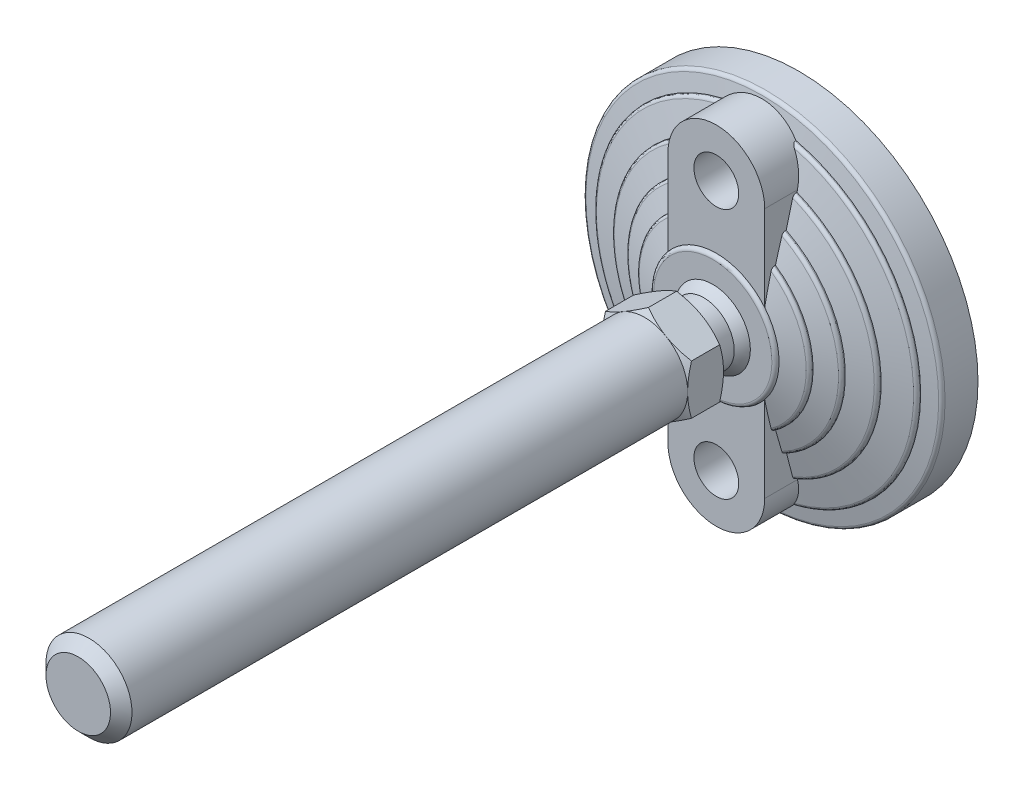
ISO-10303-21;
HEADER;
FILE_DESCRIPTION(('STEP AP214'),'2;1');
FILE_NAME('part.step','',(''),(''),'','','');
FILE_SCHEMA(('AUTOMOTIVE_DESIGN { 1 0 10303 214 1 1 1 1 }'));
ENDSEC;
DATA;
#1=APPLICATION_CONTEXT('core data for automotive mechanical design processes');
#2=APPLICATION_PROTOCOL_DEFINITION('international standard','automotive_design',2000,#1);
#3=PRODUCT_CONTEXT('',#1,'mechanical');
#4=PRODUCT('Part','Part','',(#3));
#5=PRODUCT_RELATED_PRODUCT_CATEGORY('part','',(#4));
#6=PRODUCT_DEFINITION_FORMATION('','',#4);
#7=PRODUCT_DEFINITION_CONTEXT('part definition',#1,'design');
#8=PRODUCT_DEFINITION('design','',#6,#7);
#9=PRODUCT_DEFINITION_SHAPE('','',#8);
#10=(LENGTH_UNIT() NAMED_UNIT(*) SI_UNIT(.MILLI.,.METRE.));
#11=(NAMED_UNIT(*) PLANE_ANGLE_UNIT() SI_UNIT($,.RADIAN.));
#12=(NAMED_UNIT(*) SI_UNIT($,.STERADIAN.) SOLID_ANGLE_UNIT());
#13=UNCERTAINTY_MEASURE_WITH_UNIT(LENGTH_MEASURE(1.E-05),#10,'distance_accuracy_value','');
#14=(GEOMETRIC_REPRESENTATION_CONTEXT(3) GLOBAL_UNCERTAINTY_ASSIGNED_CONTEXT((#13)) GLOBAL_UNIT_ASSIGNED_CONTEXT((#10,
#11,#12)) REPRESENTATION_CONTEXT('',''));
#15=CARTESIAN_POINT('',(0.,0.,0.));
#16=DIRECTION('',(0.,0.,1.));
#17=DIRECTION('',(1.,0.,0.));
#18=AXIS2_PLACEMENT_3D('',#15,#16,#17);
#19=CARTESIAN_POINT('',(-12.,14.022683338,33.));
#20=DIRECTION('',(0.,0.,1.));
#21=DIRECTION('',(0.,-1.,0.));
#22=AXIS2_PLACEMENT_3D('',#19,#20,#21);
#23=PLANE('',#22);
#24=CARTESIAN_POINT('',(0.,0.,33.));
#25=DIRECTION('',(0.,0.,-1.));
#26=DIRECTION('',(0.,1.,0.));
#27=AXIS2_PLACEMENT_3D('',#24,#25,#26);
#28=CIRCLE('',#27,8.5);
#29=CARTESIAN_POINT('',(0.,8.5,33.));
#30=VERTEX_POINT('',#29);
#31=EDGE_CURVE('E930',#30,#30,#28,.T.);
#32=ORIENTED_EDGE('',*,*,#31,.F.);
#33=EDGE_LOOP('',(#32));
#34=FACE_BOUND('',#33,.T.);
#35=CARTESIAN_POINT('',(0.,0.,33.));
#36=DIRECTION('',(0.,0.,1.));
#37=DIRECTION('',(0.,-1.,0.));
#38=AXIS2_PLACEMENT_3D('',#35,#36,#37);
#39=CIRCLE('',#38,12.);
#40=CARTESIAN_POINT('',(6.00000000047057,-10.3923048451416,33.));
#41=VERTEX_POINT('',#40);
#42=CARTESIAN_POINT('',(-6.00000000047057,-10.3923048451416,33.));
#43=VERTEX_POINT('',#42);
#44=EDGE_CURVE('E26',#41,#43,#39,.F.);
#45=ORIENTED_EDGE('',*,*,#44,.T.);
#46=CARTESIAN_POINT('',(-12.,0.,33.));
#47=VERTEX_POINT('',#46);
#48=EDGE_CURVE('E9',#43,#47,#39,.F.);
#49=ORIENTED_EDGE('',*,*,#48,.T.);
#50=CARTESIAN_POINT('',(-6.00000000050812,10.3923048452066,33.));
#51=VERTEX_POINT('',#50);
#52=EDGE_CURVE('E25',#47,#51,#39,.F.);
#53=ORIENTED_EDGE('',*,*,#52,.T.);
#54=CARTESIAN_POINT('',(6.00000000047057,10.3923048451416,33.));
#55=VERTEX_POINT('',#54);
#56=EDGE_CURVE('E287',#51,#55,#39,.F.);
#57=ORIENTED_EDGE('',*,*,#56,.T.);
#58=CARTESIAN_POINT('',(0.,0.,33.));
#59=DIRECTION('',(0.,0.,-1.));
#60=DIRECTION('',(0.,1.,0.));
#61=AXIS2_PLACEMENT_3D('',#58,#59,#60);
#62=CIRCLE('',#61,12.);
#63=CARTESIAN_POINT('',(12.,0.,33.));
#64=VERTEX_POINT('',#63);
#65=EDGE_CURVE('E301',#55,#64,#62,.T.);
#66=ORIENTED_EDGE('',*,*,#65,.T.);
#67=EDGE_CURVE('E310',#64,#41,#39,.F.);
#68=ORIENTED_EDGE('',*,*,#67,.T.);
#69=EDGE_LOOP('',(#45,#49,#53,#57,#66,#68));
#70=FACE_BOUND('',#69,.T.);
#71=ADVANCED_FACE('F14',(#34,#70),#23,.F.);
#72=CARTESIAN_POINT('',(0.,0.,33.));
#73=DIRECTION('',(0.,0.,-1.));
#74=DIRECTION('',(0.,1.,0.));
#75=AXIS2_PLACEMENT_3D('',#72,#73,#74);
#76=CYLINDRICAL_SURFACE('',#75,8.5);
#77=ORIENTED_EDGE('',*,*,#31,.T.);
#78=EDGE_LOOP('',(#77));
#79=FACE_BOUND('',#78,.T.);
#80=CARTESIAN_POINT('',(0.,0.,26.5000000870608));
#81=DIRECTION('',(0.,0.,-1.));
#82=DIRECTION('',(-1.,0.,0.));
#83=AXIS2_PLACEMENT_3D('',#80,#81,#82);
#84=CIRCLE('',#83,8.49999990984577);
#85=CARTESIAN_POINT('',(-8.49999990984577,0.,26.5000000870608));
#86=VERTEX_POINT('',#85);
#87=EDGE_CURVE('E926',#86,#86,#84,.T.);
#88=ORIENTED_EDGE('',*,*,#87,.F.);
#89=EDGE_LOOP('',(#88));
#90=FACE_BOUND('',#89,.T.);
#91=ADVANCED_FACE('F415',(#79,#90),#76,.T.);
#92=CARTESIAN_POINT('',(0.,0.,17.678860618));
#93=DIRECTION('',(0.,0.,-1.));
#94=DIRECTION('',(1.,0.,0.));
#95=AXIS2_PLACEMENT_3D('',#92,#93,#94);
#96=SPHERICAL_SURFACE('',#95,12.25);
#97=CARTESIAN_POINT('',(0.,0.,24.));
#98=DIRECTION('',(0.,0.,-1.));
#99=DIRECTION('',(0.,1.,0.));
#100=AXIS2_PLACEMENT_3D('',#97,#98,#99);
#101=CIRCLE('',#100,10.4931261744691);
#102=CARTESIAN_POINT('',(0.,10.4931261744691,24.));
#103=VERTEX_POINT('',#102);
#104=EDGE_CURVE('E929',#103,#103,#101,.F.);
#105=ORIENTED_EDGE('',*,*,#104,.T.);
#106=EDGE_LOOP('',(#105));
#107=FACE_BOUND('',#106,.T.);
#108=ORIENTED_EDGE('',*,*,#87,.T.);
#109=EDGE_LOOP('',(#108));
#110=FACE_BOUND('',#109,.T.);
#111=ADVANCED_FACE('F410',(#107,#110),#96,.T.);
#112=CARTESIAN_POINT('',(0.,-35.,0.));
#113=DIRECTION('',(0.,0.,1.));
#114=DIRECTION('',(0.,-1.,0.));
#115=AXIS2_PLACEMENT_3D('',#112,#113,#114);
#116=CYLINDRICAL_SURFACE('',#115,6.25);
#117=CARTESIAN_POINT('',(0.,-35.,0.));
#118=DIRECTION('',(0.,0.,1.));
#119=DIRECTION('',(0.,-1.,0.));
#120=AXIS2_PLACEMENT_3D('',#117,#118,#119);
#121=CIRCLE('',#120,6.25);
#122=CARTESIAN_POINT('',(0.,-41.25,0.));
#123=VERTEX_POINT('',#122);
#124=EDGE_CURVE('E1010',#123,#123,#121,.F.);
#125=ORIENTED_EDGE('',*,*,#124,.T.);
#126=EDGE_LOOP('',(#125));
#127=FACE_BOUND('',#126,.T.);
#128=CARTESIAN_POINT('',(0.,-35.,23.));
#129=DIRECTION('',(0.,0.,1.));
#130=DIRECTION('',(0.,-1.,0.));
#131=AXIS2_PLACEMENT_3D('',#128,#129,#130);
#132=CIRCLE('',#131,6.25);
#133=CARTESIAN_POINT('',(0.,-41.25,23.));
#134=VERTEX_POINT('',#133);
#135=EDGE_CURVE('E904',#134,#134,#132,.T.);
#136=ORIENTED_EDGE('',*,*,#135,.T.);
#137=EDGE_LOOP('',(#136));
#138=FACE_BOUND('',#137,.T.);
#139=ADVANCED_FACE('F414',(#127,#138),#116,.F.);
#140=CARTESIAN_POINT('',(-16.755457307,-16.698,24.));
#141=DIRECTION('',(0.,0.,-1.));
#142=DIRECTION('',(0.,1.,0.));
#143=AXIS2_PLACEMENT_3D('',#140,#141,#142);
#144=PLANE('',#143);
#145=ORIENTED_EDGE('',*,*,#104,.F.);
#146=EDGE_LOOP('',(#145));
#147=FACE_BOUND('',#146,.T.);
#148=CARTESIAN_POINT('',(0.,0.,24.));
#149=DIRECTION('',(0.,0.,-1.));
#150=DIRECTION('',(0.,1.,0.));
#151=AXIS2_PLACEMENT_3D('',#148,#149,#150);
#152=CIRCLE('',#151,16.5);
#153=CARTESIAN_POINT('',(0.,16.5,24.));
#154=VERTEX_POINT('',#153);
#155=EDGE_CURVE('E903',#154,#154,#152,.T.);
#156=ORIENTED_EDGE('',*,*,#155,.F.);
#157=EDGE_LOOP('',(#156));
#158=FACE_BOUND('',#157,.T.);
#159=ADVANCED_FACE('F420',(#147,#158),#144,.F.);
#160=CARTESIAN_POINT('',(-50.774113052,50.6,0.));
#161=DIRECTION('',(0.,0.,1.));
#162=DIRECTION('',(0.,-1.,0.));
#163=AXIS2_PLACEMENT_3D('',#160,#161,#162);
#164=PLANE('',#163);
#165=ORIENTED_EDGE('',*,*,#124,.F.);
#166=EDGE_LOOP('',(#165));
#167=FACE_BOUND('',#166,.T.);
#168=CARTESIAN_POINT('',(0.,35.,0.));
#169=DIRECTION('',(0.,0.,1.));
#170=DIRECTION('',(0.,-1.,0.));
#171=AXIS2_PLACEMENT_3D('',#168,#169,#170);
#172=CIRCLE('',#171,6.25);
#173=CARTESIAN_POINT('',(0.,28.75,0.));
#174=VERTEX_POINT('',#173);
#175=EDGE_CURVE('E972',#174,#174,#172,.T.);
#176=ORIENTED_EDGE('',*,*,#175,.T.);
#177=EDGE_LOOP('',(#176));
#178=FACE_BOUND('',#177,.T.);
#179=CARTESIAN_POINT('',(0.,0.,0.));
#180=DIRECTION('',(0.,0.,-1.));
#181=DIRECTION('',(1.,0.,0.));
#182=AXIS2_PLACEMENT_3D('',#179,#180,#181);
#183=CIRCLE('',#182,50.);
#184=CARTESIAN_POINT('',(50.,0.,0.));
#185=VERTEX_POINT('',#184);
#186=EDGE_CURVE('E454',#185,#185,#183,.F.);
#187=ORIENTED_EDGE('',*,*,#186,.F.);
#188=EDGE_LOOP('',(#187));
#189=FACE_BOUND('',#188,.T.);
#190=ADVANCED_FACE('F427',(#167,#178,#189),#164,.F.);
#191=CARTESIAN_POINT('',(0.,0.,23.));
#192=DIRECTION('',(0.,0.,-1.));
#193=DIRECTION('',(0.,1.,0.));
#194=AXIS2_PLACEMENT_3D('',#191,#192,#193);
#195=CONICAL_SURFACE('',#194,17.5,1.27229739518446);
#196=CARTESIAN_POINT('',(0.,0.,23.));
#197=DIRECTION('',(0.,0.,1.));
#198=DIRECTION('',(0.,-1.,0.));
#199=AXIS2_PLACEMENT_3D('',#196,#197,#198);
#200=CIRCLE('',#199,17.5);
#201=CARTESIAN_POINT('',(13.5000000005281,-11.135528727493,22.9999999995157));
#202=VERTEX_POINT('',#201);
#203=CARTESIAN_POINT('',(13.5000000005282,11.1355287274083,22.9999999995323));
#204=VERTEX_POINT('',#203);
#205=EDGE_CURVE('E900',#202,#204,#200,.T.);
#206=ORIENTED_EDGE('',*,*,#205,.F.);
#207=CARTESIAN_POINT('',(13.5,-18.9832672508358,21.217204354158));
#208=CARTESIAN_POINT('',(13.5,-18.6579649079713,21.2987714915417));
#209=CARTESIAN_POINT('',(13.5,-18.3324976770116,21.3796813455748));
#210=CARTESIAN_POINT('',(13.5,-17.6811977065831,21.5400241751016));
#211=CARTESIAN_POINT('',(13.5,-17.3553649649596,21.6194571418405));
#212=CARTESIAN_POINT('',(13.5,-16.3773825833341,21.855268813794));
#213=CARTESIAN_POINT('',(13.5,-15.7246371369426,22.0091884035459));
#214=CARTESIAN_POINT('',(13.5,-14.4172126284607,22.3088363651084));
#215=CARTESIAN_POINT('',(13.5,-13.7625334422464,22.4545641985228));
#216=CARTESIAN_POINT('',(13.5,-12.7787974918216,22.6654071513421));
#217=CARTESIAN_POINT('',(13.5,-12.450571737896,22.7344021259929));
#218=CARTESIAN_POINT('',(13.5,-11.7935144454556,22.8694734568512));
#219=CARTESIAN_POINT('',(13.5,-11.464682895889,22.9355497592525));
#220=CARTESIAN_POINT('',(13.5,-11.1355287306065,22.9999999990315));
#221=B_SPLINE_CURVE_WITH_KNOTS('',3,(#207,#208,#209,#210,#211,#212,#213,#214,#215,#216,#217,
#218,#219,#220),.UNSPECIFIED.,.F.,.F.,(4,2,2,2,2,2,4),(0.,1.00611699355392,2.01223994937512,
4.02414047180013,6.03617307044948,7.04235800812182,8.04856148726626),.UNSPECIFIED.);
#222=CARTESIAN_POINT('',(13.5,-18.9832672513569,21.2172043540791));
#223=VERTEX_POINT('',#222);
#224=EDGE_CURVE('E444',#223,#202,#221,.T.);
#225=ORIENTED_EDGE('',*,*,#224,.F.);
#226=CARTESIAN_POINT('',(3.16437848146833E-10,0.,21.217204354));
#227=DIRECTION('',(0.,0.,-1.));
#228=DIRECTION('',(0.,1.,0.));
#229=AXIS2_PLACEMENT_3D('',#226,#227,#228);
#230=CIRCLE('',#229,23.2940858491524);
#231=CARTESIAN_POINT('',(13.5,18.9832672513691,21.2172043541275));
#232=VERTEX_POINT('',#231);
#233=EDGE_CURVE('E407',#232,#223,#230,.T.);
#234=ORIENTED_EDGE('',*,*,#233,.F.);
#235=CARTESIAN_POINT('',(13.5,11.1355287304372,22.9999999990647));
#236=CARTESIAN_POINT('',(13.5,11.4646828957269,22.9355497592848));
#237=CARTESIAN_POINT('',(13.5,11.7935144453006,22.8694734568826));
#238=CARTESIAN_POINT('',(13.5,12.4505717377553,22.7344021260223));
#239=CARTESIAN_POINT('',(13.5,12.778797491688,22.6654071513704));
#240=CARTESIAN_POINT('',(13.5,13.7625334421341,22.4545641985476));
#241=CARTESIAN_POINT('',(13.5,14.4172126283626,22.3088363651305));
#242=CARTESIAN_POINT('',(13.5,15.7246371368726,22.0091884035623));
#243=CARTESIAN_POINT('',(13.5,16.3773825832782,21.8552688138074));
#244=CARTESIAN_POINT('',(13.5,17.3553649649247,21.619457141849));
#245=CARTESIAN_POINT('',(13.5,17.6811977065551,21.5400241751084));
#246=CARTESIAN_POINT('',(13.5,18.3324976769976,21.3796813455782));
#247=CARTESIAN_POINT('',(13.5,18.6579649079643,21.2987714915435));
#248=CARTESIAN_POINT('',(13.5,18.9832672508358,21.217204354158));
#249=B_SPLINE_CURVE_WITH_KNOTS('',3,(#235,#236,#237,#238,#239,#240,#241,#242,#243,#244,#245,
#246,#247,#248),.UNSPECIFIED.,.F.,.F.,(4,2,2,2,2,2,4),(0.,1.00620347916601,2.01238841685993,
4.02442101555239,6.03632153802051,7.04244449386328,8.04856148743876),.UNSPECIFIED.);
#250=EDGE_CURVE('E435',#204,#232,#249,.T.);
#251=ORIENTED_EDGE('',*,*,#250,.F.);
#252=EDGE_LOOP('',(#206,#225,#234,#251));
#253=FACE_BOUND('',#252,.T.);
#254=ADVANCED_FACE('F422',(#253),#195,.T.);
#255=CARTESIAN_POINT('',(13.267303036,19.999466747,20.261425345));
#256=CARTESIAN_POINT('',(29.097194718,9.498188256,20.261425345));
#257=CARTESIAN_POINT('',(29.097194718,-9.498188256,20.261425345));
#258=CARTESIAN_POINT('',(13.267303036,-19.999466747,20.261425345));
#259=CARTESIAN_POINT('',(13.267303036,19.999466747,20.716888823));
#260=CARTESIAN_POINT('',(29.097194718,9.49818825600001,20.716888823));
#261=CARTESIAN_POINT('',(29.097194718,-9.49818825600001,20.716888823));
#262=CARTESIAN_POINT('',(13.267303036,-19.999466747,20.716888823));
#263=CARTESIAN_POINT('',(13.117718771,19.773979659,21.083258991));
#264=CARTESIAN_POINT('',(28.769133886,9.39109946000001,21.083258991));
#265=CARTESIAN_POINT('',(28.769133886,-9.39109946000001,21.083258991));
#266=CARTESIAN_POINT('',(13.117718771,-19.773979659,21.083258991));
#267=CARTESIAN_POINT('',(12.877070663,19.411220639,21.217204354));
#268=CARTESIAN_POINT('',(28.241356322,9.218817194,21.217204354));
#269=CARTESIAN_POINT('',(28.241356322,-9.218817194,21.217204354));
#270=CARTESIAN_POINT('',(12.877070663,-19.411220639,21.217204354));
#271=(BOUNDED_SURFACE() B_SPLINE_SURFACE(3,3,((#255,#256,#257,#258),(#259,#260,#261,#262),(#263,
#264,#265,#266),(#267,#268,#269,#270)),.UNSPECIFIED.,.F.,.F.,
.F.) B_SPLINE_SURFACE_WITH_KNOTS((4,4),(4,4),(0.,1.),(0.,1.),
.UNSPECIFIED.) GEOMETRIC_REPRESENTATION_ITEM() RATIONAL_B_SPLINE_SURFACE(((1.,0.701869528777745,
0.701869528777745,1.),(0.869593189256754,0.610340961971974,0.610340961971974,0.869593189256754),
(0.869593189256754,0.610340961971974,0.610340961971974,0.869593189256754),(1.,0.701869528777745,
0.701869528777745,1.))) REPRESENTATION_ITEM('') SURFACE());
#272=CARTESIAN_POINT('',(13.5,-19.8431348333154,20.2614253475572));
#273=CARTESIAN_POINT('',(13.5,-19.8431370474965,20.286055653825));
#274=CARTESIAN_POINT('',(13.5,-19.8420333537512,20.3106726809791));
#275=CARTESIAN_POINT('',(13.5,-19.8376465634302,20.3597018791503));
#276=CARTESIAN_POINT('',(13.5,-19.8343643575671,20.3841141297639));
#277=CARTESIAN_POINT('',(13.5,-19.8213486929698,20.4565201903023));
#278=CARTESIAN_POINT('',(13.5,-19.8084453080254,20.5039784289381));
#279=CARTESIAN_POINT('',(13.5,-19.7748969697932,20.5959548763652));
#280=CARTESIAN_POINT('',(13.5,-19.7542611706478,20.6404764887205));
#281=CARTESIAN_POINT('',(13.5,-19.7062220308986,20.725735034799));
#282=CARTESIAN_POINT('',(13.5,-19.6788120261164,20.766468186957));
#283=CARTESIAN_POINT('',(13.5,-19.6164784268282,20.8458096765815));
#284=CARTESIAN_POINT('',(13.5,-19.5811980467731,20.8841360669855));
#285=CARTESIAN_POINT('',(13.5,-19.5055204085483,20.9553392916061));
#286=CARTESIAN_POINT('',(13.5,-19.465120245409,20.9882130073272));
#287=CARTESIAN_POINT('',(13.5,-19.3733614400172,21.0532792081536));
#288=CARTESIAN_POINT('',(13.5,-19.3212935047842,21.0844693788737));
#289=CARTESIAN_POINT('',(13.5,-19.2133323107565,21.1391750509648));
#290=CARTESIAN_POINT('',(13.5,-19.1574401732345,21.16269279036));
#291=CARTESIAN_POINT('',(13.5,-19.0617819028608,21.1957297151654));
#292=CARTESIAN_POINT('',(13.5,-19.0227191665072,21.2073116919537));
#293=CARTESIAN_POINT('',(13.5,-18.9832672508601,21.2172043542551));
#294=B_SPLINE_CURVE_WITH_KNOTS('',3,(#272,#273,#274,#275,#276,#277,#278,#279,#280,#281,#282,
#283,#284,#285,#286,#287,#288,#289,#290,#291,#292,#293),.UNSPECIFIED.,.F.,.F.,(4,2,2,2,2,2,2,2,
2,2,4),(0.,0.0738405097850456,0.147650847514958,0.294398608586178,0.440973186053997,
0.587692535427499,0.743377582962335,0.899151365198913,1.08055916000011,1.26191399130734,
1.38396481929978),.UNSPECIFIED.);
#295=CARTESIAN_POINT('',(13.5,-19.8431348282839,20.2614253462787));
#296=VERTEX_POINT('',#295);
#297=EDGE_CURVE('E487',#296,#223,#294,.T.);
#298=CARTESIAN_POINT('',(0.,0.,20.261425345));
#299=DIRECTION('',(0.,0.,-1.));
#300=DIRECTION('',(0.,1.,0.));
#301=AXIS2_PLACEMENT_3D('',#298,#299,#300);
#302=CIRCLE('',#301,24.);
#303=CARTESIAN_POINT('',(13.5,19.8431348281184,20.2614253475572));
#304=VERTEX_POINT('',#303);
#305=EDGE_CURVE('E924',#304,#296,#302,.T.);
#306=CARTESIAN_POINT('',(13.5,18.9832672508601,21.2172043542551));
#307=CARTESIAN_POINT('',(13.5,19.0245269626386,21.2068474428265));
#308=CARTESIAN_POINT('',(13.5,19.0653049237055,21.194676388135));
#309=CARTESIAN_POINT('',(13.5,19.1456358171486,21.1665827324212));
#310=CARTESIAN_POINT('',(13.5,19.1851861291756,21.1506526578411));
#311=CARTESIAN_POINT('',(13.5,19.3016874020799,21.0969581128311));
#312=CARTESIAN_POINT('',(13.5,19.3761277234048,21.0533765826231));
#313=CARTESIAN_POINT('',(13.5,19.4913457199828,20.9675664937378));
#314=CARTESIAN_POINT('',(13.5,19.5352290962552,20.9294496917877));
#315=CARTESIAN_POINT('',(13.5,19.6161219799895,20.8466003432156));
#316=CARTESIAN_POINT('',(13.5,19.6531483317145,20.8018845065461));
#317=CARTESIAN_POINT('',(13.5,19.7189344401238,20.7060840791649));
#318=CARTESIAN_POINT('',(13.5,19.7476154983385,20.6549449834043));
#319=CARTESIAN_POINT('',(13.5,19.7944064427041,20.5480322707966));
#320=CARTESIAN_POINT('',(13.5,19.8125331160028,20.4922661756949));
#321=CARTESIAN_POINT('',(13.5,19.8308153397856,20.4067306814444));
#322=CARTESIAN_POINT('',(13.5,19.8354249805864,20.3778585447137));
#323=CARTESIAN_POINT('',(13.5,19.8415861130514,20.3198066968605));
#324=CARTESIAN_POINT('',(13.5,19.8431393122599,20.2906271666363));
#325=CARTESIAN_POINT('',(13.5,19.8431348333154,20.2614253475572));
#326=B_SPLINE_CURVE_WITH_KNOTS('',3,(#306,#307,#308,#309,#310,#311,#312,#313,#314,#315,#316,
#317,#318,#319,#320,#321,#322,#323,#324,#325),.UNSPECIFIED.,.F.,.F.,(4,2,2,2,2,2,2,2,2,4),(0.,
0.127516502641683,0.255288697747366,0.511930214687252,0.685657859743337,0.858952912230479,
1.03383282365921,1.20843381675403,1.2960043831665,1.38352601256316),.UNSPECIFIED.);
#327=EDGE_CURVE('E561',#232,#304,#326,.T.);
#328=ORIENTED_EDGE('',*,*,#233,.T.);
#329=ORIENTED_EDGE('',*,*,#297,.F.);
#330=ORIENTED_EDGE('',*,*,#305,.F.);
#331=ORIENTED_EDGE('',*,*,#327,.F.);
#332=EDGE_LOOP('',(#328,#329,#330,#331));
#333=FACE_BOUND('',#332,.T.);
#334=ADVANCED_FACE('F426',(#333),#271,.T.);
#335=CARTESIAN_POINT('',(0.,0.,20.261425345));
#336=DIRECTION('',(0.,0.,-1.));
#337=DIRECTION('',(0.,1.,0.));
#338=AXIS2_PLACEMENT_3D('',#335,#336,#337);
#339=CYLINDRICAL_SURFACE('',#338,24.);
#340=CARTESIAN_POINT('',(0.,0.,20.));
#341=DIRECTION('',(0.,0.,-1.));
#342=DIRECTION('',(0.,1.,0.));
#343=AXIS2_PLACEMENT_3D('',#340,#341,#342);
#344=CIRCLE('',#343,24.);
#345=CARTESIAN_POINT('',(13.5,19.8431348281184,20.));
#346=VERTEX_POINT('',#345);
#347=CARTESIAN_POINT('',(13.5,-19.8431348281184,20.0000000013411));
#348=VERTEX_POINT('',#347);
#349=EDGE_CURVE('E922',#346,#348,#344,.T.);
#350=ORIENTED_EDGE('',*,*,#349,.F.);
#351=DIRECTION('',(0.,0.,-1.));
#352=VECTOR('',#351,1.);
#353=CARTESIAN_POINT('',(13.5,19.8431348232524,18.4084486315));
#354=LINE('',#353,#352);
#355=EDGE_CURVE('E582',#304,#346,#354,.T.);
#356=ORIENTED_EDGE('',*,*,#355,.F.);
#357=ORIENTED_EDGE('',*,*,#305,.T.);
#358=DIRECTION('',(0.,0.,1.));
#359=VECTOR('',#358,1.);
#360=CARTESIAN_POINT('',(13.5,-19.8431348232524,18.4084486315));
#361=LINE('',#360,#359);
#362=EDGE_CURVE('E980',#348,#296,#361,.T.);
#363=ORIENTED_EDGE('',*,*,#362,.F.);
#364=EDGE_LOOP('',(#350,#356,#357,#363));
#365=FACE_BOUND('',#364,.T.);
#366=ADVANCED_FACE('F587',(#365),#339,.T.);
#367=CARTESIAN_POINT('',(0.,0.,20.));
#368=DIRECTION('',(0.,0.,-1.));
#369=DIRECTION('',(1.,0.,0.));
#370=AXIS2_PLACEMENT_3D('',#367,#368,#369);
#371=CONICAL_SURFACE('',#370,24.,1.24904577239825);
#372=ORIENTED_EDGE('',*,*,#349,.T.);
#373=CARTESIAN_POINT('',(13.5,-26.0228978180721,18.2279240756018));
#374=CARTESIAN_POINT('',(13.5,-25.5091656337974,18.3799212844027));
#375=CARTESIAN_POINT('',(13.5,-24.9951778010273,18.5310587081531));
#376=CARTESIAN_POINT('',(13.5,-23.9666187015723,18.8312926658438));
#377=CARTESIAN_POINT('',(13.5,-23.4520474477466,18.9803892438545));
#378=CARTESIAN_POINT('',(13.5,-22.4222240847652,19.2762276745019));
#379=CARTESIAN_POINT('',(13.5,-21.9069719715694,19.4229695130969));
#380=CARTESIAN_POINT('',(13.5,-20.8756730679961,19.713675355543));
#381=CARTESIAN_POINT('',(13.5,-20.3596262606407,19.8576392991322));
#382=CARTESIAN_POINT('',(13.5,-19.8431348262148,20.0000000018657));
#383=B_SPLINE_CURVE_WITH_KNOTS('',3,(#373,#374,#375,#376,#377,#378,#379,#380,#381,#382),
.UNSPECIFIED.,.F.,.F.,(4,2,2,2,4),(0.,1.60723934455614,3.21444392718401,4.82165809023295,
6.42890708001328),.UNSPECIFIED.);
#384=CARTESIAN_POINT('',(13.5,-26.0228978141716,18.2279240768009));
#385=VERTEX_POINT('',#384);
#386=EDGE_CURVE('E495',#385,#348,#383,.T.);
#387=ORIENTED_EDGE('',*,*,#386,.F.);
#388=CARTESIAN_POINT('',(-5.51340223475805E-10,0.,18.227924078));
#389=DIRECTION('',(0.,0.,-1.));
#390=DIRECTION('',(0.,1.,0.));
#391=AXIS2_PLACEMENT_3D('',#388,#389,#390);
#392=CIRCLE('',#391,29.3162277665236);
#393=CARTESIAN_POINT('',(13.5,26.0228978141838,18.2279240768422));
#394=VERTEX_POINT('',#393);
#395=EDGE_CURVE('E921',#394,#385,#392,.T.);
#396=ORIENTED_EDGE('',*,*,#395,.F.);
#397=CARTESIAN_POINT('',(13.5000000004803,19.8431348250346,20.0000000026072));
#398=CARTESIAN_POINT('',(13.5000000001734,20.3596262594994,19.8576392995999));
#399=CARTESIAN_POINT('',(13.5000000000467,20.8756730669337,19.7136753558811));
#400=CARTESIAN_POINT('',(13.4999999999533,21.9069719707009,19.4229695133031));
#401=CARTESIAN_POINT('',(13.4999999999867,22.4222240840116,19.2762276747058));
#402=CARTESIAN_POINT('',(13.5000000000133,23.4520474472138,18.9803892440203));
#403=CARTESIAN_POINT('',(13.5000000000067,23.9666187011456,18.8312926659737));
#404=CARTESIAN_POINT('',(13.4999999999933,24.9951778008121,18.5310587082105));
#405=CARTESIAN_POINT('',(13.4999999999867,25.5091656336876,18.3799212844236));
#406=CARTESIAN_POINT('',(13.5,26.0228978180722,18.2279240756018));
#407=B_SPLINE_CURVE_WITH_KNOTS('',3,(#397,#398,#399,#400,#401,#402,#403,#404,#405,#406),
.UNSPECIFIED.,.F.,.F.,(4,2,2,2,4),(0.,1.60724899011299,3.21446315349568,4.82166773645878,
6.42890708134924),.UNSPECIFIED.);
#408=EDGE_CURVE('E576',#346,#394,#407,.T.);
#409=ORIENTED_EDGE('',*,*,#408,.F.);
#410=EDGE_LOOP('',(#372,#387,#396,#409));
#411=FACE_BOUND('',#410,.T.);
#412=ADVANCED_FACE('F583',(#411),#371,.T.);
#413=CARTESIAN_POINT('',(13.143890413,26.967353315,17.27924078));
#414=CARTESIAN_POINT('',(38.983891,14.372934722,17.27924078));
#415=CARTESIAN_POINT('',(38.983891,-14.372934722,17.27924078));
#416=CARTESIAN_POINT('',(13.143890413,-26.967353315,17.27924078));
#417=CARTESIAN_POINT('',(13.143890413,26.967353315,17.725161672));
#418=CARTESIAN_POINT('',(38.983891,14.372934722,17.725161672));
#419=CARTESIAN_POINT('',(38.983891,-14.372934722,17.725161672));
#420=CARTESIAN_POINT('',(13.143890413,-26.967353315,17.725161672));
#421=CARTESIAN_POINT('',(13.029654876,26.732975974,18.086911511));
#422=CARTESIAN_POINT('',(38.645076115,14.248017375,18.086911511));
#423=CARTESIAN_POINT('',(38.645076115,-14.248017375,18.086911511));
#424=CARTESIAN_POINT('',(13.029654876,-26.732975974,18.086911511));
#425=CARTESIAN_POINT('',(12.844309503,26.352702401,18.227924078));
#426=CARTESIAN_POINT('',(38.095354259,14.045340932,18.227924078));
#427=CARTESIAN_POINT('',(38.095354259,-14.045340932,18.227924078));
#428=CARTESIAN_POINT('',(12.844309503,-26.352702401,18.227924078));
#429=(BOUNDED_SURFACE() B_SPLINE_SURFACE(3,3,((#413,#414,#415,#416),(#417,#418,#419,#420),(#421,
#422,#423,#424),(#425,#426,#427,#428)),.UNSPECIFIED.,.F.,.F.,
.F.) B_SPLINE_SURFACE_WITH_KNOTS((4,4),(4,4),(0.,1.),(0.,1.),
.UNSPECIFIED.) GEOMETRIC_REPRESENTATION_ITEM() RATIONAL_B_SPLINE_SURFACE(((1.,0.62541978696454,
0.62541978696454,1.),(0.874161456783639,0.546717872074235,0.546717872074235,0.874161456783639),
(0.874161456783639,0.546717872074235,0.546717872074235,0.874161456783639),(1.,0.62541978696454,
0.62541978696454,1.))) REPRESENTATION_ITEM('') SURFACE());
#430=CARTESIAN_POINT('',(13.5,-26.7908566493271,17.2792407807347));
#431=CARTESIAN_POINT('',(13.5,-26.7908579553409,17.3051907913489));
#432=CARTESIAN_POINT('',(13.5,-26.7897247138,17.3311275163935));
#433=CARTESIAN_POINT('',(13.5,-26.7852140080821,17.3827974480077));
#434=CARTESIAN_POINT('',(13.5,-26.7818372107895,17.4085307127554));
#435=CARTESIAN_POINT('',(13.5,-26.768413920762,17.4849772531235));
#436=CARTESIAN_POINT('',(13.5,-26.7550740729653,17.5351491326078));
#437=CARTESIAN_POINT('',(13.5,-26.7202107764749,17.6324862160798));
#438=CARTESIAN_POINT('',(13.5,-26.6986916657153,17.6796529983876));
#439=CARTESIAN_POINT('',(13.5,-26.64834806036,17.7699105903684));
#440=CARTESIAN_POINT('',(13.5,-26.6195218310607,17.8130004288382));
#441=CARTESIAN_POINT('',(13.5,-26.5542840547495,17.895905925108));
#442=CARTESIAN_POINT('',(13.5,-26.5176080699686,17.9355124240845));
#443=CARTESIAN_POINT('',(13.5,-26.438643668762,18.0087234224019));
#444=CARTESIAN_POINT('',(13.5,-26.3963509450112,18.0423232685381));
#445=CARTESIAN_POINT('',(13.5,-26.3267001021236,18.0898793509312));
#446=CARTESIAN_POINT('',(13.5,-26.3008113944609,18.1060387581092));
#447=CARTESIAN_POINT('',(13.5,-26.2478537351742,18.1362297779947));
#448=CARTESIAN_POINT('',(13.5,-26.2207861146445,18.1502637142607));
#449=CARTESIAN_POINT('',(13.5,-26.1657188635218,18.1761515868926));
#450=CARTESIAN_POINT('',(13.5,-26.1377218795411,18.1880111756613));
#451=CARTESIAN_POINT('',(13.5,-26.0808891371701,18.2095853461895));
#452=CARTESIAN_POINT('',(13.5,-26.0520527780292,18.2192983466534));
#453=CARTESIAN_POINT('',(13.5,-26.0228978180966,18.2279240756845));
#454=B_SPLINE_CURVE_WITH_KNOTS('',3,(#430,#431,#432,#433,#434,#435,#436,#437,#438,#439,#440,
#441,#442,#443,#444,#445,#446,#447,#448,#449,#450,#451,#452,#453),.UNSPECIFIED.,.F.,.F.,(4,2,2,
2,2,2,2,2,2,2,2,4),(0.,0.0777993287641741,0.155575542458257,0.3105009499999,0.465344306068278,
0.62022445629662,0.781511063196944,0.942922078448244,1.03439248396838,1.12576216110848,
1.21689083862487,1.30808642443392),.UNSPECIFIED.);
#455=CARTESIAN_POINT('',(13.5,-26.7908566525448,17.27924078));
#456=VERTEX_POINT('',#455);
#457=EDGE_CURVE('E503',#456,#385,#454,.T.);
#458=CARTESIAN_POINT('',(0.,0.,17.27924078));
#459=DIRECTION('',(0.,0.,-1.));
#460=DIRECTION('',(0.,1.,0.));
#461=AXIS2_PLACEMENT_3D('',#458,#459,#460);
#462=CIRCLE('',#461,30.);
#463=CARTESIAN_POINT('',(13.5,26.7908566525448,17.2792407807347));
#464=VERTEX_POINT('',#463);
#465=EDGE_CURVE('E919',#464,#456,#462,.T.);
#466=CARTESIAN_POINT('',(13.5,26.0228978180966,18.2279240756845));
#467=CARTESIAN_POINT('',(13.5,26.0845570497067,18.2097134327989));
#468=CARTESIAN_POINT('',(13.5,26.1448460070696,18.1865640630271));
#469=CARTESIAN_POINT('',(13.5,26.2611194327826,18.1305926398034));
#470=CARTESIAN_POINT('',(13.5,26.3170802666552,18.0977216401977));
#471=CARTESIAN_POINT('',(13.5,26.4226214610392,18.0225926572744));
#472=CARTESIAN_POINT('',(13.5,26.4721821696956,17.9803067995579));
#473=CARTESIAN_POINT('',(13.5,26.5625156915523,17.8873079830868));
#474=CARTESIAN_POINT('',(13.5,26.603306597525,17.8366127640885));
#475=CARTESIAN_POINT('',(13.5,26.6708532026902,17.7331354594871));
#476=CARTESIAN_POINT('',(13.5,26.6985518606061,17.6809691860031));
#477=CARTESIAN_POINT('',(13.5,26.7436193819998,17.5723560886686));
#478=CARTESIAN_POINT('',(13.5,26.7610021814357,17.5159151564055));
#479=CARTESIAN_POINT('',(13.5,26.7787549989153,17.4289072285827));
#480=CARTESIAN_POINT('',(13.5,26.7832876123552,17.3991381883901));
#481=CARTESIAN_POINT('',(13.5,26.7893378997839,17.3393328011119));
#482=CARTESIAN_POINT('',(13.5,26.7908592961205,17.3092968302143));
#483=CARTESIAN_POINT('',(13.5,26.7908566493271,17.2792407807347));
#484=B_SPLINE_CURVE_WITH_KNOTS('',3,(#466,#467,#468,#469,#470,#471,#472,#473,#474,#475,#476,
#477,#478,#479,#480,#481,#482,#483),.UNSPECIFIED.,.F.,.F.,(4,2,2,2,2,2,2,2,4),(0.,
0.192810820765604,0.386609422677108,0.580989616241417,0.774964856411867,0.951184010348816,
1.12716456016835,1.21736691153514,1.30745768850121),.UNSPECIFIED.);
#485=EDGE_CURVE('E543',#394,#464,#484,.T.);
#486=ORIENTED_EDGE('',*,*,#395,.T.);
#487=ORIENTED_EDGE('',*,*,#457,.F.);
#488=ORIENTED_EDGE('',*,*,#465,.F.);
#489=ORIENTED_EDGE('',*,*,#485,.F.);
#490=EDGE_LOOP('',(#486,#487,#488,#489));
#491=FACE_BOUND('',#490,.T.);
#492=ADVANCED_FACE('F586',(#491),#429,.T.);
#493=CARTESIAN_POINT('',(0.,0.,17.27924078));
#494=DIRECTION('',(0.,0.,-1.));
#495=DIRECTION('',(0.,1.,0.));
#496=AXIS2_PLACEMENT_3D('',#493,#494,#495);
#497=CYLINDRICAL_SURFACE('',#496,30.);
#498=CARTESIAN_POINT('',(0.,0.,17.));
#499=DIRECTION('',(0.,0.,-1.));
#500=DIRECTION('',(0.,1.,0.));
#501=AXIS2_PLACEMENT_3D('',#498,#499,#500);
#502=CIRCLE('',#501,30.);
#503=CARTESIAN_POINT('',(13.5,26.7908566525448,17.));
#504=VERTEX_POINT('',#503);
#505=CARTESIAN_POINT('',(13.5,-26.7908566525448,16.9999999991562));
#506=VERTEX_POINT('',#505);
#507=EDGE_CURVE('E917',#504,#506,#502,.T.);
#508=ORIENTED_EDGE('',*,*,#507,.F.);
#509=DIRECTION('',(0.,0.,-1.));
#510=VECTOR('',#509,1.);
#511=CARTESIAN_POINT('',(13.5,26.7908566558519,18.4084486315));
#512=LINE('',#511,#510);
#513=EDGE_CURVE('E538',#464,#504,#512,.T.);
#514=ORIENTED_EDGE('',*,*,#513,.F.);
#515=ORIENTED_EDGE('',*,*,#465,.T.);
#516=DIRECTION('',(0.,0.,1.));
#517=VECTOR('',#516,1.);
#518=CARTESIAN_POINT('',(13.5,-26.7908566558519,18.4084486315));
#519=LINE('',#518,#517);
#520=EDGE_CURVE('E516',#506,#456,#519,.T.);
#521=ORIENTED_EDGE('',*,*,#520,.F.);
#522=EDGE_LOOP('',(#508,#514,#515,#521));
#523=FACE_BOUND('',#522,.T.);
#524=ADVANCED_FACE('F522',(#523),#497,.T.);
#525=CARTESIAN_POINT('',(0.,0.,17.));
#526=DIRECTION('',(0.,0.,-1.));
#527=DIRECTION('',(0.,1.,0.));
#528=AXIS2_PLACEMENT_3D('',#525,#526,#527);
#529=CONICAL_SURFACE('',#528,30.,1.29249666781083);
#530=ORIENTED_EDGE('',*,*,#507,.T.);
#531=CARTESIAN_POINT('',(13.5000000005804,-33.6690568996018,15.207222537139));
#532=CARTESIAN_POINT('',(13.5000000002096,-33.0965095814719,15.3590521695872));
#533=CARTESIAN_POINT('',(13.5000000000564,-32.5238313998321,15.5103895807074));
#534=CARTESIAN_POINT('',(13.4999999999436,-31.3781752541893,15.8119124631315));
#535=CARTESIAN_POINT('',(13.4999999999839,-30.8051972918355,15.9620979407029));
#536=CARTESIAN_POINT('',(13.5000000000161,-29.6588964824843,16.2611513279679));
#537=CARTESIAN_POINT('',(13.5000000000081,-29.0855736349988,16.4100192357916));
#538=CARTESIAN_POINT('',(13.4999999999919,-27.938527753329,16.7062178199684));
#539=CARTESIAN_POINT('',(13.4999999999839,-27.3648047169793,16.8535484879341));
#540=CARTESIAN_POINT('',(13.5,-26.7908566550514,16.9999999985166));
#541=B_SPLINE_CURVE_WITH_KNOTS('',3,(#531,#532,#533,#534,#535,#536,#537,#538,#539,#540),
.UNSPECIFIED.,.F.,.F.,(4,2,2,2,4),(0.,1.77701009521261,3.55401051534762,5.33101345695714,
7.10802608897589),.UNSPECIFIED.);
#542=CARTESIAN_POINT('',(13.5,-33.6690569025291,15.2072225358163));
#543=VERTEX_POINT('',#542);
#544=EDGE_CURVE('E509',#543,#506,#541,.T.);
#545=ORIENTED_EDGE('',*,*,#544,.F.);
#546=CARTESIAN_POINT('',(3.08433834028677E-10,0.,15.207222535));
#547=DIRECTION('',(0.,0.,-1.));
#548=DIRECTION('',(0.,1.,0.));
#549=AXIS2_PLACEMENT_3D('',#546,#547,#548);
#550=CIRCLE('',#549,36.2747211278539);
#551=CARTESIAN_POINT('',(13.5,33.6690569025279,15.2072225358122));
#552=VERTEX_POINT('',#551);
#553=EDGE_CURVE('E916',#552,#543,#550,.T.);
#554=ORIENTED_EDGE('',*,*,#553,.F.);
#555=CARTESIAN_POINT('',(13.5000000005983,26.790856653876,16.9999999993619));
#556=CARTESIAN_POINT('',(13.5000000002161,27.3648047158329,16.85354848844));
#557=CARTESIAN_POINT('',(13.5000000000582,27.9385277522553,16.7062178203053));
#558=CARTESIAN_POINT('',(13.4999999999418,29.0855736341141,16.4100192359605));
#559=CARTESIAN_POINT('',(13.4999999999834,29.6588964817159,16.2611513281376));
#560=CARTESIAN_POINT('',(13.5000000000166,30.8051972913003,15.9620979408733));
#561=CARTESIAN_POINT('',(13.5000000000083,31.3781752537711,15.8119124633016));
#562=CARTESIAN_POINT('',(13.4999999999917,32.523831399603,15.5103895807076));
#563=CARTESIAN_POINT('',(13.4999999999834,33.0965095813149,15.3590521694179));
#564=CARTESIAN_POINT('',(13.5,33.6690568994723,15.2072225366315));
#565=B_SPLINE_CURVE_WITH_KNOTS('',3,(#555,#556,#557,#558,#559,#560,#561,#562,#563,#564),
.UNSPECIFIED.,.F.,.F.,(4,2,2,2,4),(0.,1.77701263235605,3.55401557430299,5.33101599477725,
7.10802609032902),.UNSPECIFIED.);
#566=EDGE_CURVE('E530',#504,#552,#565,.T.);
#567=ORIENTED_EDGE('',*,*,#566,.F.);
#568=EDGE_LOOP('',(#530,#545,#554,#567));
#569=FACE_BOUND('',#568,.T.);
#570=ADVANCED_FACE('F517',(#569),#529,.T.);
#571=CARTESIAN_POINT('',(13.003667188,34.639639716,14.245698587));
#572=CARTESIAN_POINT('',(51.091443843,20.341547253,14.245698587));
#573=CARTESIAN_POINT('',(51.091443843,-20.341547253,14.245698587));
#574=CARTESIAN_POINT('',(13.003667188,-34.639639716,14.245698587));
#575=CARTESIAN_POINT('',(13.003667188,34.639639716,14.709515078));
#576=CARTESIAN_POINT('',(51.091443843,20.341547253,14.709515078));
#577=CARTESIAN_POINT('',(51.091443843,-20.341547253,14.709515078));
#578=CARTESIAN_POINT('',(13.003667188,-34.639639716,14.709515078));
#579=CARTESIAN_POINT('',(12.905504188,34.378149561,15.079802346));
#580=CARTESIAN_POINT('',(50.705761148,20.187991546,15.079802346));
#581=CARTESIAN_POINT('',(50.705761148,-20.187991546,15.079802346));
#582=CARTESIAN_POINT('',(12.905504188,-34.378149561,15.079802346));
#583=CARTESIAN_POINT('',(12.748767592,33.960628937,15.207222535));
#584=CARTESIAN_POINT('',(50.089942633,19.942809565,15.207222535));
#585=CARTESIAN_POINT('',(50.089942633,-19.942809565,15.207222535));
#586=CARTESIAN_POINT('',(12.748767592,-33.960628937,15.207222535));
#587=(BOUNDED_SURFACE() B_SPLINE_SURFACE(3,3,((#571,#572,#573,#574),(#575,#576,#577,#578),(#579,
#580,#581,#582),(#583,#584,#585,#586)),.UNSPECIFIED.,.F.,.F.,
.F.) B_SPLINE_SURFACE_WITH_KNOTS((4,4),(4,4),(0.,1.),(0.,1.),
.UNSPECIFIED.) GEOMETRIC_REPRESENTATION_ITEM() RATIONAL_B_SPLINE_SURFACE(((1.,0.567633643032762,
0.567633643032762,1.),(0.865565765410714,0.491324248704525,0.491324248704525,0.865565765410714),
(0.865565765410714,0.491324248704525,0.491324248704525,0.865565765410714),(1.,0.567633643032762,
0.567633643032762,1.))) REPRESENTATION_ITEM('') SURFACE());
#588=CARTESIAN_POINT('',(13.5,-34.4492380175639,14.2456985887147));
#589=CARTESIAN_POINT('',(13.5,-34.4492388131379,14.2724185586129));
#590=CARTESIAN_POINT('',(13.5,-34.448086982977,14.2991252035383));
#591=CARTESIAN_POINT('',(13.5,-34.4434985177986,14.3523366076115));
#592=CARTESIAN_POINT('',(13.5,-34.4400623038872,14.3788414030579));
#593=CARTESIAN_POINT('',(13.5,-34.4263854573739,14.457641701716));
#594=CARTESIAN_POINT('',(13.5,-34.4127763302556,14.5093910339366));
#595=CARTESIAN_POINT('',(13.5,-34.3771048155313,14.6098360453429));
#596=CARTESIAN_POINT('',(13.5,-34.3550440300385,14.6585323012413));
#597=CARTESIAN_POINT('',(13.5,-34.3032810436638,14.7516688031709));
#598=CARTESIAN_POINT('',(13.5,-34.2735788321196,14.7961090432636));
#599=CARTESIAN_POINT('',(13.5,-34.2066078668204,14.8808807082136));
#600=CARTESIAN_POINT('',(13.5,-34.1691521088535,14.9210639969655));
#601=CARTESIAN_POINT('',(13.5,-34.0883643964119,14.9950807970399));
#602=CARTESIAN_POINT('',(13.5,-34.0450257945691,15.0289070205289));
#603=CARTESIAN_POINT('',(13.5,-33.9488589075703,15.0927883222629));
#604=CARTESIAN_POINT('',(13.5,-33.8955116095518,15.1220613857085));
#605=CARTESIAN_POINT('',(13.5,-33.7848588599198,15.1715344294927));
#606=CARTESIAN_POINT('',(13.5,-33.7275598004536,15.1917486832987));
#607=CARTESIAN_POINT('',(13.5,-33.6690568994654,15.2072225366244));
#608=B_SPLINE_CURVE_WITH_KNOTS('',3,(#588,#589,#590,#591,#592,#593,#594,#595,#596,#597,#598,
#599,#600,#601,#602,#603,#604,#605,#606,#607),.UNSPECIFIED.,.F.,.F.,(4,2,2,2,2,2,2,2,2,4),(0.,
0.0801088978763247,0.160203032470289,0.319894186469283,0.479555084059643,0.639216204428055,
0.803305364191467,0.967581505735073,1.14930395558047,1.33073905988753),.UNSPECIFIED.);
#609=CARTESIAN_POINT('',(13.5,-34.4492380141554,14.2456985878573));
#610=VERTEX_POINT('',#609);
#611=EDGE_CURVE('E455',#610,#543,#608,.T.);
#612=CARTESIAN_POINT('',(0.,0.,14.245698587));
#613=DIRECTION('',(0.,0.,-1.));
#614=DIRECTION('',(0.,1.,0.));
#615=AXIS2_PLACEMENT_3D('',#612,#613,#614);
#616=CIRCLE('',#615,37.);
#617=CARTESIAN_POINT('',(13.5,34.4492380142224,14.2456985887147));
#618=VERTEX_POINT('',#617);
#619=EDGE_CURVE('E914',#618,#610,#616,.T.);
#620=CARTESIAN_POINT('',(13.5,33.6690568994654,15.2072225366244));
#621=CARTESIAN_POINT('',(13.5,33.7285004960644,15.1914984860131));
#622=CARTESIAN_POINT('',(13.5,33.7866931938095,15.1708859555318));
#623=CARTESIAN_POINT('',(13.5,33.8990439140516,15.1203027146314));
#624=CARTESIAN_POINT('',(13.5,33.9531903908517,15.0903064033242));
#625=CARTESIAN_POINT('',(13.5,34.0556677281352,15.0214004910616));
#626=CARTESIAN_POINT('',(13.5,34.1039872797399,14.9824739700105));
#627=CARTESIAN_POINT('',(13.5,34.1928797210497,14.8966704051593));
#628=CARTESIAN_POINT('',(13.5,34.2334627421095,14.8498039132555));
#629=CARTESIAN_POINT('',(13.5,34.3033335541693,14.7520897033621));
#630=CARTESIAN_POINT('',(13.5,34.3331130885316,14.7015938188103));
#631=CARTESIAN_POINT('',(13.5,34.3830581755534,14.5960457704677));
#632=CARTESIAN_POINT('',(13.5,34.4032299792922,14.5409965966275));
#633=CARTESIAN_POINT('',(13.5,34.4284319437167,14.4456451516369));
#634=CARTESIAN_POINT('',(13.5,34.4362159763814,14.4060504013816));
#635=CARTESIAN_POINT('',(13.5,34.4466250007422,14.326211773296));
#636=CARTESIAN_POINT('',(13.5,34.4492528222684,14.2859682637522));
#637=CARTESIAN_POINT('',(13.5,34.4492380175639,14.2456985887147));
#638=B_SPLINE_CURVE_WITH_KNOTS('',3,(#620,#621,#622,#623,#624,#625,#626,#627,#628,#629,#630,
#631,#632,#633,#634,#635,#636,#637),.UNSPECIFIED.,.F.,.F.,(4,2,2,2,2,2,2,2,4),(0.,
0.184329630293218,0.369166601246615,0.554356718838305,0.739302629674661,0.914257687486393,
1.08909875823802,1.20983997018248,1.33051489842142),.UNSPECIFIED.);
#639=EDGE_CURVE('E537',#552,#618,#638,.T.);
#640=ORIENTED_EDGE('',*,*,#553,.T.);
#641=ORIENTED_EDGE('',*,*,#611,.F.);
#642=ORIENTED_EDGE('',*,*,#619,.F.);
#643=ORIENTED_EDGE('',*,*,#639,.F.);
#644=EDGE_LOOP('',(#640,#641,#642,#643));
#645=FACE_BOUND('',#644,.T.);
#646=ADVANCED_FACE('F521',(#645),#587,.T.);
#647=CARTESIAN_POINT('',(0.,0.,14.245698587));
#648=DIRECTION('',(0.,0.,-1.));
#649=DIRECTION('',(1.,0.,0.));
#650=AXIS2_PLACEMENT_3D('',#647,#648,#649);
#651=CYLINDRICAL_SURFACE('',#650,37.);
#652=CARTESIAN_POINT('',(0.,0.,14.));
#653=DIRECTION('',(0.,0.,-1.));
#654=DIRECTION('',(0.,1.,0.));
#655=AXIS2_PLACEMENT_3D('',#652,#653,#654);
#656=CIRCLE('',#655,37.);
#657=CARTESIAN_POINT('',(13.5,34.4492380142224,14.000000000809));
#658=VERTEX_POINT('',#657);
#659=CARTESIAN_POINT('',(13.5,-34.4492380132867,14.0000000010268));
#660=VERTEX_POINT('',#659);
#661=EDGE_CURVE('E780',#658,#660,#656,.T.);
#662=ORIENTED_EDGE('',*,*,#661,.F.);
#663=DIRECTION('',(0.,0.,-1.));
#664=VECTOR('',#663,1.);
#665=CARTESIAN_POINT('',(13.5,34.4492380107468,18.4084486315));
#666=LINE('',#665,#664);
#667=EDGE_CURVE('E782',#618,#658,#666,.T.);
#668=ORIENTED_EDGE('',*,*,#667,.F.);
#669=ORIENTED_EDGE('',*,*,#619,.T.);
#670=DIRECTION('',(0.,0.,1.));
#671=VECTOR('',#670,1.);
#672=CARTESIAN_POINT('',(13.5,-34.4492380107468,18.4084486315));
#673=LINE('',#672,#671);
#674=EDGE_CURVE('E453',#660,#610,#673,.T.);
#675=ORIENTED_EDGE('',*,*,#674,.F.);
#676=EDGE_LOOP('',(#662,#668,#669,#675));
#677=FACE_BOUND('',#676,.T.);
#678=ADVANCED_FACE('F768',(#677),#651,.T.);
#679=CARTESIAN_POINT('',(0.,0.,9.180196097));
#680=DIRECTION('',(0.,0.,-1.));
#681=DIRECTION('',(1.,0.,0.));
#682=AXIS2_PLACEMENT_3D('',#679,#680,#681);
#683=CYLINDRICAL_SURFACE('',#682,50.);
#684=CARTESIAN_POINT('',(0.,0.,9.180196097));
#685=DIRECTION('',(0.,0.,1.));
#686=DIRECTION('',(0.,-1.,0.));
#687=AXIS2_PLACEMENT_3D('',#684,#685,#686);
#688=CIRCLE('',#687,50.);
#689=CARTESIAN_POINT('',(0.,-50.,9.180196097));
#690=VERTEX_POINT('',#689);
#691=EDGE_CURVE('E892',#690,#690,#688,.T.);
#692=ORIENTED_EDGE('',*,*,#691,.F.);
#693=EDGE_LOOP('',(#692));
#694=FACE_BOUND('',#693,.T.);
#695=ORIENTED_EDGE('',*,*,#186,.T.);
#696=EDGE_LOOP('',(#695));
#697=FACE_BOUND('',#696,.T.);
#698=ADVANCED_FACE('F469',(#694,#697),#683,.T.);
#699=CARTESIAN_POINT('',(13.5,-35.,13.816897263));
#700=DIRECTION('',(1.,0.,0.));
#701=DIRECTION('',(0.,1.,0.));
#702=AXIS2_PLACEMENT_3D('',#699,#700,#701);
#703=PLANE('',#702);
#704=ORIENTED_EDGE('',*,*,#362,.T.);
#705=ORIENTED_EDGE('',*,*,#297,.T.);
#706=ORIENTED_EDGE('',*,*,#224,.T.);
#707=DIRECTION('',(0.,-1.,0.));
#708=VECTOR('',#707,1.);
#709=CARTESIAN_POINT('',(13.5,-29.8409909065,23.));
#710=LINE('',#709,#708);
#711=CARTESIAN_POINT('',(13.5,-35.0000000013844,23.));
#712=VERTEX_POINT('',#711);
#713=EDGE_CURVE('E796',#202,#712,#710,.T.);
#714=ORIENTED_EDGE('',*,*,#713,.T.);
#715=DIRECTION('',(0.,0.,1.));
#716=VECTOR('',#715,1.);
#717=CARTESIAN_POINT('',(13.5,-35.0000000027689,16.6119));
#718=LINE('',#717,#716);
#719=CARTESIAN_POINT('',(13.5,-34.9999999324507,13.8716672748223));
#720=VERTEX_POINT('',#719);
#721=EDGE_CURVE('E909',#720,#712,#718,.T.);
#722=ORIENTED_EDGE('',*,*,#721,.F.);
#723=CARTESIAN_POINT('',(13.4999999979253,-34.4492380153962,13.9999999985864));
#724=CARTESIAN_POINT('',(13.4999999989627,-34.5410365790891,13.9786323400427));
#725=CARTESIAN_POINT('',(13.4999999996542,-34.632832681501,13.9572541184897));
#726=CARTESIAN_POINT('',(13.5000000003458,-34.8164199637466,13.9144765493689));
#727=CARTESIAN_POINT('',(13.5000000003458,-34.9082111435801,13.8930772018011));
#728=CARTESIAN_POINT('',(13.5,-34.9999998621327,13.871667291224));
#729=B_SPLINE_CURVE_WITH_KNOTS('',3,(#723,#724,#725,#726,#727,#728),.UNSPECIFIED.,.F.,.F.,(4,2,
4),(0.,0.282757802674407,0.565515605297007),.UNSPECIFIED.);
#730=EDGE_CURVE('E476',#660,#720,#729,.T.);
#731=ORIENTED_EDGE('',*,*,#730,.F.);
#732=ORIENTED_EDGE('',*,*,#674,.T.);
#733=ORIENTED_EDGE('',*,*,#611,.T.);
#734=ORIENTED_EDGE('',*,*,#544,.T.);
#735=ORIENTED_EDGE('',*,*,#520,.T.);
#736=ORIENTED_EDGE('',*,*,#457,.T.);
#737=ORIENTED_EDGE('',*,*,#386,.T.);
#738=EDGE_LOOP('',(#704,#705,#706,#714,#722,#731,#732,#733,#734,#735,#736,#737));
#739=FACE_BOUND('',#738,.T.);
#740=ADVANCED_FACE('F463',(#739),#703,.T.);
#741=CARTESIAN_POINT('',(-13.5,-48.770918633,23.));
#742=DIRECTION('',(0.,0.,-1.));
#743=DIRECTION('',(0.,1.,0.));
#744=AXIS2_PLACEMENT_3D('',#741,#742,#743);
#745=PLANE('',#744);
#746=ORIENTED_EDGE('',*,*,#135,.F.);
#747=EDGE_LOOP('',(#746));
#748=FACE_BOUND('',#747,.T.);
#749=ORIENTED_EDGE('',*,*,#713,.F.);
#750=CARTESIAN_POINT('',(0.,0.,23.));
#751=DIRECTION('',(0.,0.,-1.));
#752=DIRECTION('',(0.,1.,0.));
#753=AXIS2_PLACEMENT_3D('',#750,#751,#752);
#754=CIRCLE('',#753,17.5);
#755=CARTESIAN_POINT('',(-13.4999999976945,-11.1355287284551,23.));
#756=VERTEX_POINT('',#755);
#757=EDGE_CURVE('E970',#756,#202,#754,.F.);
#758=ORIENTED_EDGE('',*,*,#757,.F.);
#759=DIRECTION('',(0.,1.,0.));
#760=VECTOR('',#759,1.);
#761=CARTESIAN_POINT('',(-13.5,-22.996170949,23.));
#762=LINE('',#761,#760);
#763=CARTESIAN_POINT('',(-13.5,-35.,23.));
#764=VERTEX_POINT('',#763);
#765=EDGE_CURVE('E805',#764,#756,#762,.T.);
#766=ORIENTED_EDGE('',*,*,#765,.F.);
#767=CARTESIAN_POINT('',(0.,-35.,23.));
#768=DIRECTION('',(0.,0.,-1.));
#769=DIRECTION('',(0.,1.,0.));
#770=AXIS2_PLACEMENT_3D('',#767,#768,#769);
#771=CIRCLE('',#770,13.5);
#772=EDGE_CURVE('E744',#712,#764,#771,.T.);
#773=ORIENTED_EDGE('',*,*,#772,.F.);
#774=EDGE_LOOP('',(#749,#758,#766,#773));
#775=FACE_BOUND('',#774,.T.);
#776=ADVANCED_FACE('F468',(#748,#775),#745,.F.);
#777=CARTESIAN_POINT('',(0.,0.,23.));
#778=DIRECTION('',(0.,0.,-1.));
#779=DIRECTION('',(0.,1.,0.));
#780=AXIS2_PLACEMENT_3D('',#777,#778,#779);
#781=TOROIDAL_SURFACE('',#780,16.5,1.);
#782=ORIENTED_EDGE('',*,*,#155,.T.);
#783=EDGE_LOOP('',(#782));
#784=FACE_BOUND('',#783,.T.);
#785=CARTESIAN_POINT('',(0.,0.,23.));
#786=DIRECTION('',(0.,0.,-1.));
#787=DIRECTION('',(0.,1.,0.));
#788=AXIS2_PLACEMENT_3D('',#785,#786,#787);
#789=CIRCLE('',#788,17.5);
#790=CARTESIAN_POINT('',(-13.4999999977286,11.1355287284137,23.));
#791=VERTEX_POINT('',#790);
#792=EDGE_CURVE('E880',#756,#791,#789,.T.);
#793=ORIENTED_EDGE('',*,*,#792,.F.);
#794=ORIENTED_EDGE('',*,*,#757,.T.);
#795=ORIENTED_EDGE('',*,*,#205,.T.);
#796=CARTESIAN_POINT('',(0.,0.,23.));
#797=DIRECTION('',(0.,0.,-1.));
#798=DIRECTION('',(0.,1.,0.));
#799=AXIS2_PLACEMENT_3D('',#796,#797,#798);
#800=CIRCLE('',#799,17.5);
#801=EDGE_CURVE('E829',#204,#791,#800,.F.);
#802=ORIENTED_EDGE('',*,*,#801,.T.);
#803=EDGE_LOOP('',(#793,#794,#795,#802));
#804=FACE_BOUND('',#803,.T.);
#805=ADVANCED_FACE('F556',(#784,#804),#781,.T.);
#806=CARTESIAN_POINT('',(0.,35.,0.));
#807=DIRECTION('',(0.,0.,1.));
#808=DIRECTION('',(0.,-1.,0.));
#809=AXIS2_PLACEMENT_3D('',#806,#807,#808);
#810=CYLINDRICAL_SURFACE('',#809,6.25);
#811=ORIENTED_EDGE('',*,*,#175,.F.);
#812=EDGE_LOOP('',(#811));
#813=FACE_BOUND('',#812,.T.);
#814=CARTESIAN_POINT('',(0.,35.,23.));
#815=DIRECTION('',(0.,0.,1.));
#816=DIRECTION('',(0.,-1.,0.));
#817=AXIS2_PLACEMENT_3D('',#814,#815,#816);
#818=CIRCLE('',#817,6.25);
#819=CARTESIAN_POINT('',(0.,28.75,23.));
#820=VERTEX_POINT('',#819);
#821=EDGE_CURVE('E899',#820,#820,#818,.T.);
#822=ORIENTED_EDGE('',*,*,#821,.T.);
#823=EDGE_LOOP('',(#822));
#824=FACE_BOUND('',#823,.T.);
#825=ADVANCED_FACE('F554',(#813,#824),#810,.F.);
#826=CARTESIAN_POINT('',(13.5,10.992341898,13.816897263));
#827=DIRECTION('',(1.,0.,0.));
#828=DIRECTION('',(0.,1.,0.));
#829=AXIS2_PLACEMENT_3D('',#826,#827,#828);
#830=PLANE('',#829);
#831=DIRECTION('',(0.,0.,-1.));
#832=VECTOR('',#831,1.);
#833=CARTESIAN_POINT('',(13.5,34.9999999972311,16.6119));
#834=LINE('',#833,#832);
#835=CARTESIAN_POINT('',(13.5,34.9999999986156,23.));
#836=VERTEX_POINT('',#835);
#837=CARTESIAN_POINT('',(13.5,34.9999999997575,13.8716672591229));
#838=VERTEX_POINT('',#837);
#839=EDGE_CURVE('E897',#836,#838,#834,.T.);
#840=ORIENTED_EDGE('',*,*,#839,.F.);
#841=DIRECTION('',(0.,-1.,0.));
#842=VECTOR('',#841,1.);
#843=CARTESIAN_POINT('',(13.5,29.817764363,23.));
#844=LINE('',#843,#842);
#845=EDGE_CURVE('E826',#836,#204,#844,.T.);
#846=ORIENTED_EDGE('',*,*,#845,.T.);
#847=ORIENTED_EDGE('',*,*,#250,.T.);
#848=ORIENTED_EDGE('',*,*,#327,.T.);
#849=ORIENTED_EDGE('',*,*,#355,.T.);
#850=ORIENTED_EDGE('',*,*,#408,.T.);
#851=ORIENTED_EDGE('',*,*,#485,.T.);
#852=ORIENTED_EDGE('',*,*,#513,.T.);
#853=ORIENTED_EDGE('',*,*,#566,.T.);
#854=ORIENTED_EDGE('',*,*,#639,.T.);
#855=ORIENTED_EDGE('',*,*,#667,.T.);
#856=CARTESIAN_POINT('',(13.5,34.9999999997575,13.8716672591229));
#857=CARTESIAN_POINT('',(13.5,34.9082112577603,13.8930771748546));
#858=CARTESIAN_POINT('',(13.5,34.8164200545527,13.9144765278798));
#859=CARTESIAN_POINT('',(13.5,34.6328327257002,13.9572541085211));
#860=CARTESIAN_POINT('',(13.5,34.5410366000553,13.9786323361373));
#861=CARTESIAN_POINT('',(13.5,34.4492380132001,14.0000000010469));
#862=B_SPLINE_CURVE_WITH_KNOTS('',3,(#856,#857,#858,#859,#860,#861),.UNSPECIFIED.,.F.,.F.,(4,2,
4),(0.,0.282757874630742,0.565515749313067),.UNSPECIFIED.);
#863=EDGE_CURVE('E568',#838,#658,#862,.T.);
#864=ORIENTED_EDGE('',*,*,#863,.F.);
#865=EDGE_LOOP('',(#840,#846,#847,#848,#849,#850,#851,#852,#853,#854,#855,#864));
#866=FACE_BOUND('',#865,.T.);
#867=ADVANCED_FACE('F549',(#866),#830,.T.);
#868=CARTESIAN_POINT('',(0.,0.,14.));
#869=DIRECTION('',(0.,0.,-1.));
#870=DIRECTION('',(1.,0.,0.));
#871=AXIS2_PLACEMENT_3D('',#868,#869,#870);
#872=CONICAL_SURFACE('',#871,37.,1.32581766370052);
#873=ORIENTED_EDGE('',*,*,#863,.T.);
#874=ORIENTED_EDGE('',*,*,#661,.T.);
#875=ORIENTED_EDGE('',*,*,#730,.T.);
#876=CARTESIAN_POINT('',(10.9763923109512,-42.859313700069,12.1893660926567));
#877=CARTESIAN_POINT('',(11.0902470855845,-42.7003026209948,12.2208143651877));
#878=CARTESIAN_POINT('',(11.2005742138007,-42.5389181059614,12.2528659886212));
#879=CARTESIAN_POINT('',(11.4140175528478,-42.2116832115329,12.318151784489));
#880=CARTESIAN_POINT('',(11.5171338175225,-42.045832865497,12.3513859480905));
#881=CARTESIAN_POINT('',(11.8153810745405,-41.5420926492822,12.4528082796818));
#882=CARTESIAN_POINT('',(11.9994728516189,-41.1979264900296,12.5227334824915));
#883=CARTESIAN_POINT('',(12.3326507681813,-40.5045455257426,12.6650837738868));
#884=CARTESIAN_POINT('',(12.4824970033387,-40.1556720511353,12.7374026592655));
#885=CARTESIAN_POINT('',(12.7520641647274,-39.4472922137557,12.88585340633));
#886=CARTESIAN_POINT('',(12.8717896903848,-39.0877874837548,12.9619846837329));
#887=CARTESIAN_POINT('',(13.0622198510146,-38.4243028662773,13.104134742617));
#888=CARTESIAN_POINT('',(13.1378349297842,-38.12160006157,13.1695954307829));
#889=CARTESIAN_POINT('',(13.2678621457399,-37.512151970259,13.3027279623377));
#890=CARTESIAN_POINT('',(13.3222748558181,-37.2054067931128,13.3703997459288));
#891=CARTESIAN_POINT('',(13.4106518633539,-36.5828211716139,13.5092155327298));
#892=CARTESIAN_POINT('',(13.4441594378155,-36.2669255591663,13.5804026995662));
#893=CARTESIAN_POINT('',(13.4888437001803,-35.6339537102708,13.7246710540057));
#894=CARTESIAN_POINT('',(13.5000180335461,-35.31687735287,13.797752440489));
#895=CARTESIAN_POINT('',(13.5,-34.9999998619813,13.8716672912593));
#896=B_SPLINE_CURVE_WITH_KNOTS('',3,(#876,#877,#878,#879,#880,#881,#882,#883,#884,#885,#886,
#887,#888,#889,#890,#891,#892,#893,#894,#895),.UNSPECIFIED.,.F.,.F.,(4,2,2,2,2,2,2,2,2,4),(0.,
0.594146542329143,1.18828864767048,2.37624851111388,3.53450882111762,4.69259215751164,
5.64827317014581,6.60392835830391,7.57979141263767,8.55575734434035),.UNSPECIFIED.);
#897=CARTESIAN_POINT('',(10.9763923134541,-42.8593136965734,12.1893660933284));
#898=VERTEX_POINT('',#897);
#899=EDGE_CURVE('E720',#898,#720,#896,.T.);
#900=ORIENTED_EDGE('',*,*,#899,.F.);
#901=CARTESIAN_POINT('',(2.42528219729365E-10,0.,12.189366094));
#902=DIRECTION('',(0.,0.,-1.));
#903=DIRECTION('',(0.,1.,0.));
#904=AXIS2_PLACEMENT_3D('',#901,#902,#903);
#905=CIRCLE('',#904,44.2425356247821);
#906=CARTESIAN_POINT('',(10.9763923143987,42.8593136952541,12.1893660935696));
#907=VERTEX_POINT('',#906);
#908=EDGE_CURVE('E786',#907,#898,#905,.T.);
#909=ORIENTED_EDGE('',*,*,#908,.F.);
#910=CARTESIAN_POINT('',(13.5,34.9999999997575,13.8716672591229));
#911=CARTESIAN_POINT('',(13.5000427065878,35.3882039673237,13.781111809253));
#912=CARTESIAN_POINT('',(13.4832570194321,35.7767153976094,13.6918094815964));
#913=CARTESIAN_POINT('',(13.4161694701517,36.5515574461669,13.5160966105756));
#914=CARTESIAN_POINT('',(13.3658621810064,36.9378877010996,13.429686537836));
#915=CARTESIAN_POINT('',(13.2335638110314,37.6957533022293,13.2623134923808));
#916=CARTESIAN_POINT('',(13.1524048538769,38.0674159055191,13.1812680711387));
#917=CARTESIAN_POINT('',(12.9587932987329,38.8031976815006,13.0226641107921));
#918=CARTESIAN_POINT('',(12.8463473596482,39.1673184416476,12.9451048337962));
#919=CARTESIAN_POINT('',(12.614591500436,39.8185376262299,12.8078727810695));
#920=CARTESIAN_POINT('',(12.5004567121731,40.1073551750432,12.7475582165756));
#921=CARTESIAN_POINT('',(12.2523231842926,40.6768873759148,12.6295958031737));
#922=CARTESIAN_POINT('',(12.1183253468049,40.9576023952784,12.5719478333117));
#923=CARTESIAN_POINT('',(11.8279807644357,41.5153469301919,12.4582871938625));
#924=CARTESIAN_POINT('',(11.6712235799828,41.792175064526,12.4023343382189));
#925=CARTESIAN_POINT('',(11.3382342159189,42.3345673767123,12.2935032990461));
#926=CARTESIAN_POINT('',(11.1619981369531,42.6001292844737,12.2406257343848));
#927=CARTESIAN_POINT('',(10.9763923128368,42.8593136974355,12.1893660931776));
#928=B_SPLINE_CURVE_WITH_KNOTS('',3,(#910,#911,#912,#913,#914,#915,#916,#917,#918,#919,#920,
#921,#922,#923,#924,#925,#926,#927),.UNSPECIFIED.,.F.,.F.,(4,2,2,2,2,2,2,2,4),(0.,
1.19554847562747,2.39129055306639,3.5568389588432,4.72213948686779,5.67049672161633,
6.61881089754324,7.58705133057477,8.55548594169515),.UNSPECIFIED.);
#929=EDGE_CURVE('E649',#838,#907,#928,.T.);
#930=ORIENTED_EDGE('',*,*,#929,.F.);
#931=EDGE_LOOP('',(#873,#874,#875,#900,#909,#930));
#932=FACE_BOUND('',#931,.T.);
#933=ADVANCED_FACE('F553',(#932),#872,.T.);
#934=CARTESIAN_POINT('',(9.509200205,43.983805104,11.219223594));
#935=CARTESIAN_POINT('',(69.947296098,30.917224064,11.219223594));
#936=CARTESIAN_POINT('',(69.947296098,-30.917224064,11.219223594));
#937=CARTESIAN_POINT('',(9.509200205,-43.983805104,11.219223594));
#938=CARTESIAN_POINT('',(9.509200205,43.983805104,11.696951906));
#939=CARTESIAN_POINT('',(69.9472960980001,30.917224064,11.696951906));
#940=CARTESIAN_POINT('',(69.9472960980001,-30.917224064,11.696951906));
#941=CARTESIAN_POINT('',(9.509200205,-43.983805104,11.696951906));
#942=CARTESIAN_POINT('',(9.447073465,43.696444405,12.073499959));
#943=CARTESIAN_POINT('',(69.490307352,30.715231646,12.073499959));
#944=CARTESIAN_POINT('',(69.490307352,-30.715231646,12.073499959));
#945=CARTESIAN_POINT('',(9.447073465,-43.696444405,12.073499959));
#946=CARTESIAN_POINT('',(9.349136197,43.243445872,12.189366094));
#947=CARTESIAN_POINT('',(68.769905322,30.396808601,12.189366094));
#948=CARTESIAN_POINT('',(68.769905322,-30.396808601,12.189366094));
#949=CARTESIAN_POINT('',(9.349136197,-43.243445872,12.189366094));
#950=(BOUNDED_SURFACE() B_SPLINE_SURFACE(3,3,((#934,#935,#936,#937),(#938,#939,#940,#941),(#942,
#943,#944,#945),(#946,#947,#948,#949)),.UNSPECIFIED.,.F.,.F.,
.F.) B_SPLINE_SURFACE_WITH_KNOTS((4,4),(4,4),(0.,1.),(0.,1.),
.UNSPECIFIED.) GEOMETRIC_REPRESENTATION_ITEM() RATIONAL_B_SPLINE_SURFACE(((1.,0.47421037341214,
0.47421037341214,1.),(0.858803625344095,0.407253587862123,0.407253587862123,0.858803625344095),
(0.858803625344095,0.407253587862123,0.407253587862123,0.858803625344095),(1.,0.47421037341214,
0.47421037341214,1.))) REPRESENTATION_ITEM('') SURFACE());
#951=CARTESIAN_POINT('',(0.,0.,11.219223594));
#952=DIRECTION('',(0.,0.,-1.));
#953=DIRECTION('',(0.,1.,0.));
#954=AXIS2_PLACEMENT_3D('',#951,#952,#953);
#955=CIRCLE('',#954,45.);
#956=CARTESIAN_POINT('',(10.2161330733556,43.8250000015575,11.2192235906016));
#957=VERTEX_POINT('',#956);
#958=CARTESIAN_POINT('',(10.216133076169,-43.8249999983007,11.2192235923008));
#959=VERTEX_POINT('',#958);
#960=EDGE_CURVE('E804',#957,#959,#955,.T.);
#961=CARTESIAN_POINT('',(10.9763923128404,42.8593136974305,12.1893660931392));
#962=CARTESIAN_POINT('',(10.9414184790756,42.9081655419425,12.1796813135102));
#963=CARTESIAN_POINT('',(10.906315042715,42.9564954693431,12.167702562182));
#964=CARTESIAN_POINT('',(10.8360680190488,43.0519016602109,12.138949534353));
#965=CARTESIAN_POINT('',(10.8009246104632,43.0989738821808,12.1221614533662));
#966=CARTESIAN_POINT('',(10.730579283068,43.1919542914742,12.0833916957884));
#967=CARTESIAN_POINT('',(10.6953822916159,43.2378400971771,12.0613467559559));
#968=CARTESIAN_POINT('',(10.6259110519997,43.3272572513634,12.0118633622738));
#969=CARTESIAN_POINT('',(10.5916356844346,43.3707915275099,11.9844318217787));
#970=CARTESIAN_POINT('',(10.5256394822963,43.4536161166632,11.9245405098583));
#971=CARTESIAN_POINT('',(10.493872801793,43.492994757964,11.8922570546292));
#972=CARTESIAN_POINT('',(10.4481189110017,43.549116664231,11.839251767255));
#973=CARTESIAN_POINT('',(10.4332041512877,43.5673083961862,11.8208503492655));
#974=CARTESIAN_POINT('',(10.4041301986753,43.6025925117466,11.7823870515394));
#975=CARTESIAN_POINT('',(10.3899723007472,43.6196830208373,11.7623224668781));
#976=CARTESIAN_POINT('',(10.3542455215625,43.6626083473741,11.707618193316));
#977=CARTESIAN_POINT('',(10.3334614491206,43.6873719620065,11.6715913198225));
#978=CARTESIAN_POINT('',(10.2956896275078,43.7321035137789,11.5949209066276));
#979=CARTESIAN_POINT('',(10.2786908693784,43.7520853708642,11.5542912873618));
#980=CARTESIAN_POINT('',(10.2536278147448,43.7814230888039,11.4795639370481));
#981=CARTESIAN_POINT('',(10.2443910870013,43.7921884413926,11.4464179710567));
#982=CARTESIAN_POINT('',(10.2295810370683,43.8094156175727,11.378266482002));
#983=CARTESIAN_POINT('',(10.223998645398,43.8158880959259,11.3432657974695));
#984=CARTESIAN_POINT('',(10.2190506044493,43.8216216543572,11.293161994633));
#985=CARTESIAN_POINT('',(10.2179590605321,43.8228858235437,11.2784273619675));
#986=CARTESIAN_POINT('',(10.2164999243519,43.8245753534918,11.2488722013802));
#987=CARTESIAN_POINT('',(10.2161324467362,43.825000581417,11.2340516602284));
#988=CARTESIAN_POINT('',(10.2161330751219,43.8249999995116,11.2192235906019));
#989=B_SPLINE_CURVE_WITH_KNOTS('',3,(#961,#962,#963,#964,#965,#966,#967,#968,#969,#970,#971,
#972,#973,#974,#975,#976,#977,#978,#979,#980,#981,#982,#983,#984,#985,#986,#987,#988),
.UNSPECIFIED.,.F.,.F.,(4,2,2,2,2,2,2,2,2,2,2,2,2,4),(0.,0.182552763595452,0.365634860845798,
0.551042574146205,0.736213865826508,0.915808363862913,1.00534306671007,1.09502635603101,
1.23975433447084,1.38405573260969,1.49181113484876,1.59929808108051,1.64375006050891,
1.68820907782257),.UNSPECIFIED.);
#990=EDGE_CURVE('E641',#907,#957,#989,.T.);
#991=CARTESIAN_POINT('',(10.2161330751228,-43.8249999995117,11.2192235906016));
#992=CARTESIAN_POINT('',(10.2161249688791,-43.825008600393,11.2397973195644));
#993=CARTESIAN_POINT('',(10.216837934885,-43.8241840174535,11.2603638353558));
#994=CARTESIAN_POINT('',(10.2196429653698,-43.8209356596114,11.3012464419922));
#995=CARTESIAN_POINT('',(10.2217330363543,-43.818514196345,11.3215628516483));
#996=CARTESIAN_POINT('',(10.2271943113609,-43.8121797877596,11.3615120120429));
#997=CARTESIAN_POINT('',(10.230548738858,-43.808286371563,11.3811501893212));
#998=CARTESIAN_POINT('',(10.2384364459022,-43.7991167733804,11.4198571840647));
#999=CARTESIAN_POINT('',(10.2429700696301,-43.7938401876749,11.4389258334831));
#1000=CARTESIAN_POINT('',(10.2581066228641,-43.7761886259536,11.4948727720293));
#1001=CARTESIAN_POINT('',(10.2702836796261,-43.7619475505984,11.5307547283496));
#1002=CARTESIAN_POINT('',(10.2978960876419,-43.7294783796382,11.5993915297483));
#1003=CARTESIAN_POINT('',(10.3133429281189,-43.711236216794,11.632134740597));
#1004=CARTESIAN_POINT('',(10.3565346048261,-43.659900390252,11.7128958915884));
#1005=CARTESIAN_POINT('',(10.3861274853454,-43.6244290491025,11.7584076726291));
#1006=CARTESIAN_POINT('',(10.448956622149,-43.548202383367,11.8418473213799));
#1007=CARTESIAN_POINT('',(10.4822021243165,-43.5074335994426,11.8797552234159));
#1008=CARTESIAN_POINT('',(10.5436529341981,-43.4310889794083,11.9415576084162));
#1009=CARTESIAN_POINT('',(10.5714611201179,-43.3962063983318,11.9667253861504));
#1010=CARTESIAN_POINT('',(10.6279526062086,-43.3245847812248,12.0131545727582));
#1011=CARTESIAN_POINT('',(10.656636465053,-43.2878445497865,12.0344134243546));
#1012=CARTESIAN_POINT('',(10.743439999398,-43.1754150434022,12.0927116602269));
#1013=CARTESIAN_POINT('',(10.8023642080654,-43.0974519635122,12.124323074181));
#1014=CARTESIAN_POINT('',(10.8805294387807,-42.9915669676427,12.1573317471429));
#1015=CARTESIAN_POINT('',(10.8997568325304,-42.9653233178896,12.1647354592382));
#1016=CARTESIAN_POINT('',(10.938127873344,-42.9125478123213,12.1781092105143));
#1017=CARTESIAN_POINT('',(10.9572715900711,-42.8860171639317,12.1840838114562));
#1018=CARTESIAN_POINT('',(10.9763923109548,-42.859313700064,12.1893660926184));
#1019=B_SPLINE_CURVE_WITH_KNOTS('',3,(#991,#992,#993,#994,#995,#996,#997,#998,#999,#1000,#1001,
#1002,#1003,#1004,#1005,#1006,#1007,#1008,#1009,#1010,#1011,#1012,#1013,#1014,#1015,#1016,#1017,
#1018),.UNSPECIFIED.,.F.,.F.,(4,2,2,2,2,2,2,2,2,2,2,2,2,4),(0.,0.0616807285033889,
0.123272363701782,0.184073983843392,0.244893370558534,0.365736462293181,0.48701143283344,
0.680458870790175,0.874407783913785,1.02785806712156,1.18140838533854,1.4882194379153,
1.58829974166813,1.68805619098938),.UNSPECIFIED.);
#1020=EDGE_CURVE('E729',#959,#898,#1019,.T.);
#1021=ORIENTED_EDGE('',*,*,#960,.F.);
#1022=ORIENTED_EDGE('',*,*,#990,.F.);
#1023=ORIENTED_EDGE('',*,*,#908,.T.);
#1024=ORIENTED_EDGE('',*,*,#1020,.F.);
#1025=EDGE_LOOP('',(#1021,#1022,#1023,#1024));
#1026=FACE_BOUND('',#1025,.T.);
#1027=ADVANCED_FACE('F745',(#1026),#950,.T.);
#1028=CARTESIAN_POINT('',(0.,0.,11.219223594));
#1029=DIRECTION('',(0.,0.,-1.));
#1030=DIRECTION('',(0.,1.,0.));
#1031=AXIS2_PLACEMENT_3D('',#1028,#1029,#1030);
#1032=CYLINDRICAL_SURFACE('',#1031,45.);
#1033=CARTESIAN_POINT('',(0.,0.,11.));
#1034=DIRECTION('',(0.,0.,-1.));
#1035=DIRECTION('',(0.,1.,0.));
#1036=AXIS2_PLACEMENT_3D('',#1033,#1034,#1035);
#1037=CIRCLE('',#1036,45.);
#1038=CARTESIAN_POINT('',(10.2161330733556,43.8250000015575,11.));
#1039=VERTEX_POINT('',#1038);
#1040=CARTESIAN_POINT('',(10.2161330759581,-43.8249999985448,11.0000000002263));
#1041=VERTEX_POINT('',#1040);
#1042=EDGE_CURVE('E889',#1039,#1041,#1037,.T.);
#1043=ORIENTED_EDGE('',*,*,#1042,.F.);
#1044=DIRECTION('',(0.,0.,-1.));
#1045=VECTOR('',#1044,1.);
#1046=CARTESIAN_POINT('',(10.2161330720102,43.825000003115,16.6119));
#1047=LINE('',#1046,#1045);
#1048=EDGE_CURVE('E893',#957,#1039,#1047,.T.);
#1049=ORIENTED_EDGE('',*,*,#1048,.F.);
#1050=ORIENTED_EDGE('',*,*,#960,.T.);
#1051=DIRECTION('',(0.,0.,1.));
#1052=VECTOR('',#1051,1.);
#1053=CARTESIAN_POINT('',(10.2161330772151,-43.8249999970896,16.6119));
#1054=LINE('',#1053,#1052);
#1055=EDGE_CURVE('E737',#1041,#959,#1054,.T.);
#1056=ORIENTED_EDGE('',*,*,#1055,.F.);
#1057=EDGE_LOOP('',(#1043,#1049,#1050,#1056));
#1058=FACE_BOUND('',#1057,.T.);
#1059=ADVANCED_FACE('F714',(#1058),#1032,.T.);
#1060=CARTESIAN_POINT('',(0.,0.,9.18019609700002));
#1061=DIRECTION('',(0.,0.,-1.));
#1062=DIRECTION('',(0.,1.,0.));
#1063=AXIS2_PLACEMENT_3D('',#1060,#1061,#1062);
#1064=TOROIDAL_SURFACE('',#1063,48.9999999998,1.00000000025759);
#1065=CARTESIAN_POINT('',(0.,0.,10.1607767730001));
#1066=DIRECTION('',(0.,0.,-1.));
#1067=DIRECTION('',(0.,1.,0.));
#1068=AXIS2_PLACEMENT_3D('',#1065,#1066,#1067);
#1069=CIRCLE('',#1068,49.196116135);
#1070=CARTESIAN_POINT('',(0.,49.196116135,10.160776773));
#1071=VERTEX_POINT('',#1070);
#1072=EDGE_CURVE('E862',#1071,#1071,#1069,.F.);
#1073=ORIENTED_EDGE('',*,*,#1072,.F.);
#1074=EDGE_LOOP('',(#1073));
#1075=FACE_BOUND('',#1074,.T.);
#1076=ORIENTED_EDGE('',*,*,#691,.T.);
#1077=EDGE_LOOP('',(#1076));
#1078=FACE_BOUND('',#1077,.T.);
#1079=ADVANCED_FACE('F557',(#1075,#1078),#1064,.T.);
#1080=CARTESIAN_POINT('',(0.,-35.,23.));
#1081=DIRECTION('',(0.,0.,-1.));
#1082=DIRECTION('',(0.,1.,0.));
#1083=AXIS2_PLACEMENT_3D('',#1080,#1081,#1082);
#1084=CYLINDRICAL_SURFACE('',#1083,13.5);
#1085=ORIENTED_EDGE('',*,*,#1055,.T.);
#1086=ORIENTED_EDGE('',*,*,#1020,.T.);
#1087=ORIENTED_EDGE('',*,*,#899,.T.);
#1088=ORIENTED_EDGE('',*,*,#721,.T.);
#1089=ORIENTED_EDGE('',*,*,#772,.T.);
#1090=DIRECTION('',(0.,0.,1.));
#1091=VECTOR('',#1090,1.);
#1092=CARTESIAN_POINT('',(-13.5,-35.,18.4084486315));
#1093=LINE('',#1092,#1091);
#1094=CARTESIAN_POINT('',(-13.5,-34.999999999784,13.8716672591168));
#1095=VERTEX_POINT('',#1094);
#1096=EDGE_CURVE('E736',#1095,#764,#1093,.T.);
#1097=ORIENTED_EDGE('',*,*,#1096,.F.);
#1098=CARTESIAN_POINT('',(-10.976392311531,-42.8593136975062,12.1893660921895));
#1099=CARTESIAN_POINT('',(-11.0902470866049,-42.7003026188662,12.2208143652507));
#1100=CARTESIAN_POINT('',(-11.2005742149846,-42.5389181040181,12.2528659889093));
#1101=CARTESIAN_POINT('',(-11.4140175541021,-42.2116832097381,12.3181517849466));
#1102=CARTESIAN_POINT('',(-11.5171338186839,-42.0458328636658,12.3513859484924));
#1103=CARTESIAN_POINT('',(-11.8153810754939,-41.5420926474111,12.4528082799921));
#1104=CARTESIAN_POINT('',(-11.9994728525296,-41.1979264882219,12.5227334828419));
#1105=CARTESIAN_POINT('',(-12.3326507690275,-40.5045455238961,12.665083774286));
#1106=CARTESIAN_POINT('',(-12.482497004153,-40.1556720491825,12.7374026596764));
#1107=CARTESIAN_POINT('',(-12.7520641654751,-39.4472922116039,12.8858534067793));
#1108=CARTESIAN_POINT('',(-12.8717896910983,-39.0877874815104,12.9619846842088));
#1109=CARTESIAN_POINT('',(-13.0622198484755,-38.4243028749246,13.1041347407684));
#1110=CARTESIAN_POINT('',(-13.1378349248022,-38.1216000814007,13.1695954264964));
#1111=CARTESIAN_POINT('',(-13.2678621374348,-37.5121520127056,13.3027279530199));
#1112=CARTESIAN_POINT('',(-13.3222748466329,-37.2054068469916,13.3703997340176));
#1113=CARTESIAN_POINT('',(-13.4106518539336,-36.5828212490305,13.5092155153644));
#1114=CARTESIAN_POINT('',(-13.444159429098,-36.2669256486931,13.5804026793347));
#1115=CARTESIAN_POINT('',(-13.4888436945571,-35.6339538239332,13.7246710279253));
#1116=CARTESIAN_POINT('',(-13.5000180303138,-35.3168774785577,13.7977524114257));
#1117=CARTESIAN_POINT('',(-13.5,-34.9999999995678,13.8716672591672));
#1118=B_SPLINE_CURVE_WITH_KNOTS('',3,(#1098,#1099,#1100,#1101,#1102,#1103,#1104,#1105,#1106,
#1107,#1108,#1109,#1110,#1111,#1112,#1113,#1114,#1115,#1116,#1117),.UNSPECIFIED.,.F.,.F.,(4,2,2,
2,2,2,2,2,2,4),(0.,0.594146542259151,1.18828864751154,2.37624851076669,3.53450882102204,
4.69259215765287,5.64827313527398,6.60392828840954,7.57979130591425,8.55575720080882),.UNSPECIFIED.);
#1119=CARTESIAN_POINT('',(-10.9763923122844,-42.859313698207,12.1893660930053));
#1120=VERTEX_POINT('',#1119);
#1121=EDGE_CURVE('E696',#1120,#1095,#1118,.T.);
#1122=ORIENTED_EDGE('',*,*,#1121,.F.);
#1123=CARTESIAN_POINT('',(-10.2161330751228,-43.8249999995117,11.219223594));
#1124=CARTESIAN_POINT('',(-10.2161249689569,-43.825008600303,11.2397973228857));
#1125=CARTESIAN_POINT('',(-10.216837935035,-43.8241840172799,11.2603638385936));
#1126=CARTESIAN_POINT('',(-10.2196429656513,-43.8209356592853,11.3012464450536));
#1127=CARTESIAN_POINT('',(-10.221733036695,-43.8185141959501,11.3215628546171));
#1128=CARTESIAN_POINT('',(-10.2271943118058,-43.8121797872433,11.3615120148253));
#1129=CARTESIAN_POINT('',(-10.2305487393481,-43.8082863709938,11.3811501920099));
#1130=CARTESIAN_POINT('',(-10.2384364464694,-43.7991167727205,11.4198571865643));
#1131=CARTESIAN_POINT('',(-10.2429700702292,-43.7938401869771,11.4389258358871));
#1132=CARTESIAN_POINT('',(-10.2581066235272,-43.7761886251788,11.4948727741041));
#1133=CARTESIAN_POINT('',(-10.2702836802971,-43.7619475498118,11.5307547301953));
#1134=CARTESIAN_POINT('',(-10.2978960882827,-43.7294783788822,11.5993915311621));
#1135=CARTESIAN_POINT('',(-10.3133429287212,-43.7112362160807,11.6321347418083));
#1136=CARTESIAN_POINT('',(-10.3565346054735,-43.6599003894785,11.7128958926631));
#1137=CARTESIAN_POINT('',(-10.3861274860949,-43.6244290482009,11.7584076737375));
#1138=CARTESIAN_POINT('',(-10.4489566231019,-43.5482023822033,11.8418473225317));
#1139=CARTESIAN_POINT('',(-10.4822021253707,-43.5074335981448,11.8797552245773));
#1140=CARTESIAN_POINT('',(-10.5436529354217,-43.4310889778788,11.941557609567));
#1141=CARTESIAN_POINT('',(-10.5714611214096,-43.3962063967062,11.9667253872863));
#1142=CARTESIAN_POINT('',(-10.6279526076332,-43.3245847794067,12.0131545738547));
#1143=CARTESIAN_POINT('',(-10.6566364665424,-43.287844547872,12.0344134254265));
#1144=CARTESIAN_POINT('',(-10.7434400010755,-43.1754150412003,12.0927116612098));
#1145=CARTESIAN_POINT('',(-10.8023642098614,-43.0974519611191,12.1243230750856));
#1146=CARTESIAN_POINT('',(-10.8805294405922,-42.9915669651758,12.1573317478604));
#1147=CARTESIAN_POINT('',(-10.899756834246,-42.9653233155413,12.1647354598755));
#1148=CARTESIAN_POINT('',(-10.9381278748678,-42.9125478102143,12.1781092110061));
#1149=CARTESIAN_POINT('',(-10.9572715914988,-42.8860171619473,12.1840838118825));
#1150=CARTESIAN_POINT('',(-10.9763923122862,-42.8593136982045,12.1893660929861));
#1151=B_SPLINE_CURVE_WITH_KNOTS('',3,(#1123,#1124,#1125,#1126,#1127,#1128,#1129,#1130,#1131,
#1132,#1133,#1134,#1135,#1136,#1137,#1138,#1139,#1140,#1141,#1142,#1143,#1144,#1145,#1146,#1147,
#1148,#1149,#1150),.UNSPECIFIED.,.F.,.F.,(4,2,2,2,2,2,2,2,2,2,2,2,2,4),(0.,0.061680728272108,
0.123272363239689,0.184073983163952,0.244893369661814,0.365736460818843,0.487011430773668,
0.680458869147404,0.874407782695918,1.02785806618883,1.18140838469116,1.48821943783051,
1.58829974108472,1.68805618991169),.UNSPECIFIED.);
#1152=CARTESIAN_POINT('',(-10.2161330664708,-43.8250000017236,11.219223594));
#1153=VERTEX_POINT('',#1152);
#1154=EDGE_CURVE('E687',#1153,#1120,#1151,.T.);
#1155=ORIENTED_EDGE('',*,*,#1154,.F.);
#1156=DIRECTION('',(0.,0.,1.));
#1157=VECTOR('',#1156,1.);
#1158=CARTESIAN_POINT('',(-10.2161330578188,-43.8250000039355,11.109611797));
#1159=LINE('',#1158,#1157);
#1160=CARTESIAN_POINT('',(-10.216133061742,-43.8250000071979,10.9999999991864));
#1161=VERTEX_POINT('',#1160);
#1162=EDGE_CURVE('E832',#1161,#1153,#1159,.T.);
#1163=ORIENTED_EDGE('',*,*,#1162,.F.);
#1164=CARTESIAN_POINT('',(10.2161330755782,-43.8249999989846,11.0000000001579));
#1165=CARTESIAN_POINT('',(9.9702084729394,-44.1097543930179,10.955706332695));
#1166=CARTESIAN_POINT('',(9.71217126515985,-44.3843445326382,10.9133179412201));
#1167=CARTESIAN_POINT('',(9.17374577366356,-44.9113062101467,10.8324868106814));
#1168=CARTESIAN_POINT('',(8.89335691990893,-45.1636771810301,10.7940441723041));
#1169=CARTESIAN_POINT('',(8.31182712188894,-45.6445337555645,10.7212058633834));
#1170=CARTESIAN_POINT('',(8.01066589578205,-45.8729954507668,10.6868142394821));
#1171=CARTESIAN_POINT('',(7.38995533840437,-46.3040391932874,10.6222415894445));
#1172=CARTESIAN_POINT('',(7.07040692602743,-46.506622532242,10.592060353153));
#1173=CARTESIAN_POINT('',(6.41484825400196,-46.8845701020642,10.5359848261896));
#1174=CARTESIAN_POINT('',(6.07882327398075,-47.0599093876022,10.510094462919));
#1175=CARTESIAN_POINT('',(5.39296621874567,-47.3818181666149,10.4627230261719));
#1176=CARTESIAN_POINT('',(5.04313419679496,-47.5283877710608,10.4412419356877));
#1177=CARTESIAN_POINT('',(4.33283427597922,-47.7913913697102,10.4027991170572));
#1178=CARTESIAN_POINT('',(3.97238786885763,-47.9078821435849,10.3858288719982));
#1179=CARTESIAN_POINT('',(3.24293849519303,-48.1101705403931,10.3564169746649));
#1180=CARTESIAN_POINT('',(2.87393835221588,-48.1959781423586,10.3439738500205));
#1181=CARTESIAN_POINT('',(2.08991768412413,-48.343836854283,10.3225586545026));
#1182=CARTESIAN_POINT('',(1.67421067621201,-48.4023470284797,10.314102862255));
#1183=CARTESIAN_POINT('',(0.838994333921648,-48.4804318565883,10.3028230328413));
#1184=CARTESIAN_POINT('',(0.419484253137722,-48.4999986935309,10.3000001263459));
#1185=CARTESIAN_POINT('',(-0.376171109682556,-48.5000011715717,10.2999998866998));
#1186=CARTESIAN_POINT('',(-0.752321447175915,-48.4842686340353,10.3022697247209));
#1187=CARTESIAN_POINT('',(-1.50207049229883,-48.4214504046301,10.3113426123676));
#1188=CARTESIAN_POINT('',(-1.87566835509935,-48.374354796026,10.3181470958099));
#1189=CARTESIAN_POINT('',(-2.6179837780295,-48.2490764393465,10.3362793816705));
#1190=CARTESIAN_POINT('',(-2.98669461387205,-48.1708546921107,10.3476128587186));
#1191=CARTESIAN_POINT('',(-3.71613465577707,-47.9839169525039,10.3747648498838));
#1192=CARTESIAN_POINT('',(-4.07686384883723,-47.8752009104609,10.3905833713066));
#1193=CARTESIAN_POINT('',(-4.78761683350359,-47.6281514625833,10.426643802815));
#1194=CARTESIAN_POINT('',(-5.13764551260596,-47.4898318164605,10.4468836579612));
#1195=CARTESIAN_POINT('',(-5.82473732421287,-47.184571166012,10.4917245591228));
#1196=CARTESIAN_POINT('',(-6.16179924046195,-47.0176274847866,10.5163260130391));
#1197=CARTESIAN_POINT('',(-6.82029215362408,-46.6565209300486,10.5697840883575));
#1198=CARTESIAN_POINT('',(-7.14173617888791,-46.4623812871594,10.5986370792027));
#1199=CARTESIAN_POINT('',(-7.76695354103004,-46.0483044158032,10.6605027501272));
#1200=CARTESIAN_POINT('',(-8.07073211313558,-45.8283748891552,10.6935141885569));
#1201=CARTESIAN_POINT('',(-8.70112684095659,-45.3307278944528,10.7686595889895));
#1202=CARTESIAN_POINT('',(-9.02472178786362,-45.0492503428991,10.8114226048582));
#1203=CARTESIAN_POINT('',(-9.48831755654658,-44.6056004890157,10.8793534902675));
#1204=CARTESIAN_POINT('',(-9.63911856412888,-44.4542585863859,10.9026105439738));
#1205=CARTESIAN_POINT('',(-9.93327475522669,-44.1447042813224,10.9503733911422));
#1206=CARTESIAN_POINT('',(-10.0766302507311,-43.9864921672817,10.9748791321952));
#1207=CARTESIAN_POINT('',(-10.2161330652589,-43.8250000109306,10.9999999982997));
#1208=B_SPLINE_CURVE_WITH_KNOTS('',3,(#1164,#1165,#1166,#1167,#1168,#1169,#1170,#1171,#1172,
#1173,#1174,#1175,#1176,#1177,#1178,#1179,#1180,#1181,#1182,#1183,#1184,#1185,#1186,#1187,#1188,
#1189,#1190,#1191,#1192,#1193,#1194,#1195,#1196,#1197,#1198,#1199,#1200,#1201,#1202,#1203,#1204,
#1205,#1206,#1207),.UNSPECIFIED.,.F.,.F.,(4,2,2,2,2,2,2,2,2,2,2,2,2,2,2,2,2,2,2,2,2,4),(0.,
1.13621447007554,2.27245792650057,3.40982694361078,4.54713917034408,5.68548668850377,
6.82382981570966,7.96000812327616,9.09581657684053,10.3536032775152,11.611642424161,
12.7397847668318,13.8682839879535,14.9982016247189,16.1281211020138,17.257516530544,
18.3870176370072,19.5155597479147,20.6437656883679,21.9346193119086,22.5791427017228,
23.2236390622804),.UNSPECIFIED.);
#1209=EDGE_CURVE('E702',#1041,#1161,#1208,.T.);
#1210=ORIENTED_EDGE('',*,*,#1209,.F.);
#1211=EDGE_LOOP('',(#1085,#1086,#1087,#1088,#1089,#1097,#1122,#1155,#1163,#1210));
#1212=FACE_BOUND('',#1211,.T.);
#1213=ADVANCED_FACE('F707',(#1212),#1084,.T.);
#1214=CARTESIAN_POINT('',(-13.5,-10.992341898,13.816897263));
#1215=DIRECTION('',(-1.,0.,0.));
#1216=DIRECTION('',(0.,-1.,0.));
#1217=AXIS2_PLACEMENT_3D('',#1214,#1215,#1216);
#1218=PLANE('',#1217);
#1219=ORIENTED_EDGE('',*,*,#1096,.T.);
#1220=ORIENTED_EDGE('',*,*,#765,.T.);
#1221=CARTESIAN_POINT('',(-13.5000000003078,-18.9832672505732,21.217204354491));
#1222=CARTESIAN_POINT('',(-13.5000000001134,-18.6579649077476,21.2987714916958));
#1223=CARTESIAN_POINT('',(-13.5000000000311,-18.3324976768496,21.3796813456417));
#1224=CARTESIAN_POINT('',(-13.4999999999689,-17.6811977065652,21.5400241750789));
#1225=CARTESIAN_POINT('',(-13.4999999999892,-17.3553649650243,21.6194571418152));
#1226=CARTESIAN_POINT('',(-13.5000000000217,-16.3773825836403,21.8552688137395));
#1227=CARTESIAN_POINT('',(-13.5000000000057,-15.7246371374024,22.0091884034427));
#1228=CARTESIAN_POINT('',(-13.4999999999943,-14.4172126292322,22.3088363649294));
#1229=CARTESIAN_POINT('',(-13.4999999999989,-13.7625334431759,22.4545641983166));
#1230=CARTESIAN_POINT('',(-13.5000000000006,-12.7787974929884,22.6654071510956));
#1231=CARTESIAN_POINT('',(-13.5000000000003,-12.4505717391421,22.7344021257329));
#1232=CARTESIAN_POINT('',(-13.4999999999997,-11.7935144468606,22.8694734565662));
#1233=CARTESIAN_POINT('',(-13.4999999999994,-11.4646828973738,22.9355497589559));
#1234=CARTESIAN_POINT('',(-13.5,-11.1355287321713,22.9999999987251));
#1235=B_SPLINE_CURVE_WITH_KNOTS('',3,(#1221,#1222,#1223,#1224,#1225,#1226,#1227,#1228,#1229,
#1230,#1231,#1232,#1233,#1234),.UNSPECIFIED.,.F.,.F.,(4,2,2,2,2,2,4),(0.,1.00611699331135,
2.01223994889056,4.02414047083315,6.03617306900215,7.04235800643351,8.04856148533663),.UNSPECIFIED.);
#1236=CARTESIAN_POINT('',(-13.5,-18.9832672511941,21.2172043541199));
#1237=VERTEX_POINT('',#1236);
#1238=EDGE_CURVE('E738',#1237,#756,#1235,.T.);
#1239=ORIENTED_EDGE('',*,*,#1238,.F.);
#1240=CARTESIAN_POINT('',(-13.5,-19.8431348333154,20.2614253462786));
#1241=CARTESIAN_POINT('',(-13.5,-19.8431370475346,20.2860556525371));
#1242=CARTESIAN_POINT('',(-13.5,-19.8420333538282,20.3106726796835));
#1243=CARTESIAN_POINT('',(-13.5,-19.8376465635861,20.3597018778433));
#1244=CARTESIAN_POINT('',(-13.5,-19.8343643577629,20.3841141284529));
#1245=CARTESIAN_POINT('',(-13.5,-19.8213486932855,20.4565201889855));
#1246=CARTESIAN_POINT('',(-13.5,-19.8084453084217,20.5039784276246));
#1247=CARTESIAN_POINT('',(-13.5,-19.7748969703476,20.5959548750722));
#1248=CARTESIAN_POINT('',(-13.5,-19.7542611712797,20.6404764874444));
#1249=CARTESIAN_POINT('',(-13.5,-19.7062220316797,20.7257350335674));
#1250=CARTESIAN_POINT('',(-13.5,-19.6788120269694,20.7664681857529));
#1251=CARTESIAN_POINT('',(-13.5,-19.6164784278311,20.8458096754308));
#1252=CARTESIAN_POINT('',(-13.5,-19.5811980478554,20.8841360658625));
#1253=CARTESIAN_POINT('',(-13.5,-19.505520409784,20.9553392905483));
#1254=CARTESIAN_POINT('',(-13.5,-19.4651202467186,20.9882130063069));
#1255=CARTESIAN_POINT('',(-13.5,-19.3733614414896,21.0532792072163));
#1256=CARTESIAN_POINT('',(-13.5,-19.3212935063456,21.0844693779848));
#1257=CARTESIAN_POINT('',(-13.5,-19.2133323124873,21.1391750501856));
#1258=CARTESIAN_POINT('',(-13.5,-19.1574401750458,21.1626927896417));
#1259=CARTESIAN_POINT('',(-13.5,-19.0617819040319,21.1957297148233));
#1260=CARTESIAN_POINT('',(-13.5,-19.0227191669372,21.2073116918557));
#1261=CARTESIAN_POINT('',(-13.5,-18.9832672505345,21.2172043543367));
#1262=B_SPLINE_CURVE_WITH_KNOTS('',3,(#1240,#1241,#1242,#1243,#1244,#1245,#1246,#1247,#1248,
#1249,#1250,#1251,#1252,#1253,#1254,#1255,#1256,#1257,#1258,#1259,#1260,#1261),.UNSPECIFIED.,
.F.,.F.,(4,2,2,2,2,2,2,2,2,2,4),(0.,0.073840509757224,0.147650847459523,0.294398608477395,
0.440973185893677,0.587692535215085,0.743377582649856,0.899151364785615,1.08055915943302,
1.26191399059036,1.38396482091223),.UNSPECIFIED.);
#1263=CARTESIAN_POINT('',(-13.499999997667,-19.8431348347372,20.2614253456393));
#1264=VERTEX_POINT('',#1263);
#1265=EDGE_CURVE('E821',#1264,#1237,#1262,.T.);
#1266=ORIENTED_EDGE('',*,*,#1265,.F.);
#1267=DIRECTION('',(0.,0.,1.));
#1268=VECTOR('',#1267,1.);
#1269=CARTESIAN_POINT('',(-13.499999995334,-19.8431348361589,20.1307126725));
#1270=LINE('',#1269,#1268);
#1271=CARTESIAN_POINT('',(-13.499999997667,-19.8431348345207,20.0000000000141));
#1272=VERTEX_POINT('',#1271);
#1273=EDGE_CURVE('E825',#1272,#1264,#1270,.T.);
#1274=ORIENTED_EDGE('',*,*,#1273,.F.);
#1275=CARTESIAN_POINT('',(-13.5000000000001,-26.0228978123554,18.2279240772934));
#1276=CARTESIAN_POINT('',(-13.5,-25.5091656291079,18.3799212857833));
#1277=CARTESIAN_POINT('',(-13.5,-24.9951777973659,18.5310587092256));
#1278=CARTESIAN_POINT('',(-13.5,-23.9666186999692,18.8312926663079));
#1279=CARTESIAN_POINT('',(-13.5,-23.4520474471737,18.9803892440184));
#1280=CARTESIAN_POINT('',(-13.5,-22.4222240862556,19.2762276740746));
#1281=CARTESIAN_POINT('',(-13.5,-21.9069719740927,19.4229695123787));
#1282=CARTESIAN_POINT('',(-13.5,-20.8756730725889,19.7136753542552));
#1283=CARTESIAN_POINT('',(-13.5,-20.35962626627,19.8576392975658));
#1284=CARTESIAN_POINT('',(-13.5,-19.8431348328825,20.0000000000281));
#1285=B_SPLINE_CURVE_WITH_KNOTS('',3,(#1275,#1276,#1277,#1278,#1279,#1280,#1281,#1282,#1283,
#1284),.UNSPECIFIED.,.F.,.F.,(4,2,2,2,4),(0.,1.60723934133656,3.21444392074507,4.82165808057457,
6.42890706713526),.UNSPECIFIED.);
#1286=CARTESIAN_POINT('',(-13.5,-26.0228978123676,18.2279240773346));
#1287=VERTEX_POINT('',#1286);
#1288=EDGE_CURVE('E866',#1287,#1272,#1285,.T.);
#1289=ORIENTED_EDGE('',*,*,#1288,.F.);
#1290=CARTESIAN_POINT('',(-13.5,-26.7908566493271,17.2792407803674));
#1291=CARTESIAN_POINT('',(-13.5,-26.7908579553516,17.3051907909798));
#1292=CARTESIAN_POINT('',(-13.5,-26.7897247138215,17.3311275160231));
#1293=CARTESIAN_POINT('',(-13.5,-26.7852140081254,17.3827974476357));
#1294=CARTESIAN_POINT('',(-13.5,-26.7818372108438,17.4085307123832));
#1295=CARTESIAN_POINT('',(-13.5,-26.7684139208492,17.4849772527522));
#1296=CARTESIAN_POINT('',(-13.5,-26.7550740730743,17.5351491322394));
#1297=CARTESIAN_POINT('',(-13.5,-26.7202107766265,17.6324862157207));
#1298=CARTESIAN_POINT('',(-13.5,-26.6986916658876,17.679652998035));
#1299=CARTESIAN_POINT('',(-13.5,-26.6483480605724,17.7699105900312));
#1300=CARTESIAN_POINT('',(-13.5,-26.6195218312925,17.81300042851));
#1301=CARTESIAN_POINT('',(-13.5,-26.5542840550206,17.8959059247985));
#1302=CARTESIAN_POINT('',(-13.5,-26.5176080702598,17.9355124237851));
#1303=CARTESIAN_POINT('',(-13.5,-26.4386436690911,18.0087234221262));
#1304=CARTESIAN_POINT('',(-13.5,-26.396350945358,18.0423232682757));
#1305=CARTESIAN_POINT('',(-13.5,-26.3267001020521,18.0898793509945));
#1306=CARTESIAN_POINT('',(-13.5,-26.3008113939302,18.1060387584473));
#1307=CARTESIAN_POINT('',(-13.5,-26.247853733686,18.1362297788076));
#1308=CARTESIAN_POINT('',(-13.5,-26.2207861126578,18.1502637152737));
#1309=CARTESIAN_POINT('',(-13.5,-26.1657188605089,18.1761515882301));
#1310=CARTESIAN_POINT('',(-13.5,-26.1377218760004,18.1880111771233));
#1311=CARTESIAN_POINT('',(-13.5,-26.080889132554,18.2095853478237));
#1312=CARTESIAN_POINT('',(-13.5,-26.0520527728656,18.2192983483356));
#1313=CARTESIAN_POINT('',(-13.5,-26.0228978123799,18.227924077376));
#1314=B_SPLINE_CURVE_WITH_KNOTS('',3,(#1290,#1291,#1292,#1293,#1294,#1295,#1296,#1297,#1298,
#1299,#1300,#1301,#1302,#1303,#1304,#1305,#1306,#1307,#1308,#1309,#1310,#1311,#1312,#1313),
.UNSPECIFIED.,.F.,.F.,(4,2,2,2,2,2,2,2,2,2,2,4),(0.,0.0777993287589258,0.155575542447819,
0.310500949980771,0.465344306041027,0.620224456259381,0.78151106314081,0.942922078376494,
1.03439248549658,1.12576216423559,1.21689084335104,1.30808643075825),.UNSPECIFIED.);
#1315=CARTESIAN_POINT('',(-13.5000000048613,-26.7908566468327,17.2792407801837));
#1316=VERTEX_POINT('',#1315);
#1317=EDGE_CURVE('E816',#1316,#1287,#1314,.T.);
#1318=ORIENTED_EDGE('',*,*,#1317,.F.);
#1319=DIRECTION('',(0.,0.,1.));
#1320=VECTOR('',#1319,1.);
#1321=CARTESIAN_POINT('',(-13.5000000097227,-26.7908566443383,17.13962039));
#1322=LINE('',#1321,#1320);
#1323=CARTESIAN_POINT('',(-13.5000000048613,-26.7908566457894,17.0000000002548));
#1324=VERTEX_POINT('',#1323);
#1325=EDGE_CURVE('E817',#1324,#1316,#1322,.T.);
#1326=ORIENTED_EDGE('',*,*,#1325,.F.);
#1327=CARTESIAN_POINT('',(-13.5000000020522,-33.6690569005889,15.2072225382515));
#1328=CARTESIAN_POINT('',(-13.5000000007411,-33.0965095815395,15.3590521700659));
#1329=CARTESIAN_POINT('',(-13.5000000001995,-32.5238313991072,15.5103895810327));
#1330=CARTESIAN_POINT('',(-13.4999999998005,-31.3781752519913,15.8119124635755));
#1331=CARTESIAN_POINT('',(-13.499999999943,-30.8051972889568,15.9620979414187));
#1332=CARTESIAN_POINT('',(-13.500000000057,-29.6588964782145,16.261151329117));
#1333=CARTESIAN_POINT('',(-13.5000000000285,-29.0855736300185,16.4100192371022));
#1334=CARTESIAN_POINT('',(-13.4999999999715,-27.9385277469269,16.7062178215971));
#1335=CARTESIAN_POINT('',(-13.499999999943,-27.364804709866,16.8535484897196));
#1336=CARTESIAN_POINT('',(-13.5,-26.7908566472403,17.0000000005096));
#1337=B_SPLINE_CURVE_WITH_KNOTS('',3,(#1327,#1328,#1329,#1330,#1331,#1332,#1333,#1334,#1335,
#1336),.UNSPECIFIED.,.F.,.F.,(4,2,2,2,4),(0.,1.77701009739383,3.55401051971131,5.33101346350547,
7.10802609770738),.UNSPECIFIED.);
#1338=CARTESIAN_POINT('',(-13.5,-33.669056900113,15.207222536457));
#1339=VERTEX_POINT('',#1338);
#1340=EDGE_CURVE('E873',#1339,#1324,#1337,.T.);
#1341=ORIENTED_EDGE('',*,*,#1340,.F.);
#1342=CARTESIAN_POINT('',(-13.5,-34.4492380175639,14.2456985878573));
#1343=CARTESIAN_POINT('',(-13.5,-34.4492388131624,14.2724185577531));
#1344=CARTESIAN_POINT('',(-13.5,-34.4480869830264,14.2991252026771));
#1345=CARTESIAN_POINT('',(-13.5,-34.4434985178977,14.3523366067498));
#1346=CARTESIAN_POINT('',(-13.5,-34.4400623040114,14.378841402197));
#1347=CARTESIAN_POINT('',(-13.5,-34.4263854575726,14.4576417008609));
#1348=CARTESIAN_POINT('',(-13.5,-34.4127763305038,14.5093910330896));
#1349=CARTESIAN_POINT('',(-13.5,-34.377104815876,14.6098360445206));
#1350=CARTESIAN_POINT('',(-13.5,-34.3550440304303,14.6585323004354));
#1351=CARTESIAN_POINT('',(-13.5,-34.3032810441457,14.7516688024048));
#1352=CARTESIAN_POINT('',(-13.5,-34.2735788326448,14.7961090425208));
#1353=CARTESIAN_POINT('',(-13.5,-34.2066078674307,14.8808807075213));
#1354=CARTESIAN_POINT('',(-13.5,-34.169152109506,14.9210639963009));
#1355=CARTESIAN_POINT('',(-13.5,-34.0883643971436,14.9950807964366));
#1356=CARTESIAN_POINT('',(-13.5,-34.0450257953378,15.0289070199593));
#1357=CARTESIAN_POINT('',(-13.5,-33.9488589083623,15.0927883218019));
#1358=CARTESIAN_POINT('',(-13.5,-33.895511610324,15.1220613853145));
#1359=CARTESIAN_POINT('',(-13.5,-33.7848588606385,15.1715344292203));
#1360=CARTESIAN_POINT('',(-13.5,-33.7275598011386,15.1917486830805));
#1361=CARTESIAN_POINT('',(-13.5,-33.669056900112,15.2072225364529));
#1362=B_SPLINE_CURVE_WITH_KNOTS('',3,(#1342,#1343,#1344,#1345,#1346,#1347,#1348,#1349,#1350,
#1351,#1352,#1353,#1354,#1355,#1356,#1357,#1358,#1359,#1360,#1361),.UNSPECIFIED.,.F.,.F.,(4,2,2,
2,2,2,2,2,2,4),(0.,0.0801088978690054,0.160203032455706,0.319894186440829,0.479555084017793,
0.639216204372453,0.803305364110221,0.967581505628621,1.14930395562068,1.33073906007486),.UNSPECIFIED.);
#1363=CARTESIAN_POINT('',(-13.4999999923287,-34.4492380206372,14.2456985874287));
#1364=VERTEX_POINT('',#1363);
#1365=EDGE_CURVE('E811',#1364,#1339,#1362,.T.);
#1366=ORIENTED_EDGE('',*,*,#1365,.F.);
#1367=DIRECTION('',(0.,0.,1.));
#1368=VECTOR('',#1367,1.);
#1369=CARTESIAN_POINT('',(-13.4999999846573,-34.4492380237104,14.1228492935));
#1370=LINE('',#1369,#1368);
#1371=CARTESIAN_POINT('',(-13.4999999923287,-34.4492380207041,14.));
#1372=VERTEX_POINT('',#1371);
#1373=EDGE_CURVE('E812',#1372,#1364,#1370,.T.);
#1374=ORIENTED_EDGE('',*,*,#1373,.F.);
#1375=CARTESIAN_POINT('',(-13.5,-34.9999999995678,13.8716672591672));
#1376=CARTESIAN_POINT('',(-13.5,-34.9082112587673,13.8930771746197));
#1377=CARTESIAN_POINT('',(-13.5,-34.8164200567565,13.914476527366));
#1378=CARTESIAN_POINT('',(-13.5,-34.6328327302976,13.9572541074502));
#1379=CARTESIAN_POINT('',(-13.5,-34.5410366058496,13.978632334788));
#1380=CARTESIAN_POINT('',(-13.5,-34.4492380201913,13.9999999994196));
#1381=B_SPLINE_CURVE_WITH_KNOTS('',3,(#1375,#1376,#1377,#1378,#1379,#1380),.UNSPECIFIED.,.F.,
.F.,(4,2,4),(0.,0.282757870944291,0.56551574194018),.UNSPECIFIED.);
#1382=EDGE_CURVE('E879',#1095,#1372,#1381,.T.);
#1383=ORIENTED_EDGE('',*,*,#1382,.F.);
#1384=EDGE_LOOP('',(#1219,#1220,#1239,#1266,#1274,#1289,#1318,#1326,#1341,#1366,#1374,#1383));
#1385=FACE_BOUND('',#1384,.T.);
#1386=ADVANCED_FACE('F712',(#1385),#1218,.T.);
#1387=CARTESIAN_POINT('',(0.,0.,23.));
#1388=DIRECTION('',(0.,0.,-1.));
#1389=DIRECTION('',(0.,1.,0.));
#1390=AXIS2_PLACEMENT_3D('',#1387,#1388,#1389);
#1391=CONICAL_SURFACE('',#1390,17.5,1.27229739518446);
#1392=ORIENTED_EDGE('',*,*,#792,.T.);
#1393=CARTESIAN_POINT('',(-13.5,18.9832672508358,21.217204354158));
#1394=CARTESIAN_POINT('',(-13.5,18.6579649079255,21.2987714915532));
#1395=CARTESIAN_POINT('',(-13.5,18.33249767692,21.3796813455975));
#1396=CARTESIAN_POINT('',(-13.5,17.6811977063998,21.5400241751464));
#1397=CARTESIAN_POINT('',(-13.5,17.3553649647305,21.6194571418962));
#1398=CARTESIAN_POINT('',(-13.5,16.3773825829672,21.8552688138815));
#1399=CARTESIAN_POINT('',(-13.5,15.7246371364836,22.0091884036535));
#1400=CARTESIAN_POINT('',(-13.5,14.4172126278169,22.3088363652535));
#1401=CARTESIAN_POINT('',(-13.5,13.7625334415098,22.4545641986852));
#1402=CARTESIAN_POINT('',(-13.5,12.7787974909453,22.6654071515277));
#1403=CARTESIAN_POINT('',(-13.5,12.4505717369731,22.7344021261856));
#1404=CARTESIAN_POINT('',(-13.5,11.793514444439,22.8694734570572));
#1405=CARTESIAN_POINT('',(-13.5,11.4646828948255,22.9355497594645));
#1406=CARTESIAN_POINT('',(-13.5,11.135528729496,22.9999999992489));
#1407=B_SPLINE_CURVE_WITH_KNOTS('',3,(#1393,#1394,#1395,#1396,#1397,#1398,#1399,#1400,#1401,
#1402,#1403,#1404,#1405,#1406),.UNSPECIFIED.,.F.,.F.,(4,2,2,2,2,2,4),(0.,1.00611699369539,
2.01223994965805,4.02414047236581,6.036173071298,7.04235800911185,8.04856148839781),.UNSPECIFIED.);
#1408=CARTESIAN_POINT('',(-13.5,18.9832672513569,21.2172043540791));
#1409=VERTEX_POINT('',#1408);
#1410=EDGE_CURVE('E851',#1409,#791,#1407,.T.);
#1411=ORIENTED_EDGE('',*,*,#1410,.F.);
#1412=CARTESIAN_POINT('',(-3.16437848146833E-10,0.,21.217204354));
#1413=DIRECTION('',(0.,0.,-1.));
#1414=DIRECTION('',(0.,1.,0.));
#1415=AXIS2_PLACEMENT_3D('',#1412,#1413,#1414);
#1416=CIRCLE('',#1415,23.2940858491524);
#1417=EDGE_CURVE('E822',#1237,#1409,#1416,.T.);
#1418=ORIENTED_EDGE('',*,*,#1417,.F.);
#1419=ORIENTED_EDGE('',*,*,#1238,.T.);
#1420=EDGE_LOOP('',(#1392,#1411,#1418,#1419));
#1421=FACE_BOUND('',#1420,.T.);
#1422=ADVANCED_FACE('F715',(#1421),#1391,.T.);
#1423=CARTESIAN_POINT('',(0.,0.,14.245698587));
#1424=DIRECTION('',(0.,0.,-1.));
#1425=DIRECTION('',(1.,0.,0.));
#1426=AXIS2_PLACEMENT_3D('',#1423,#1424,#1425);
#1427=CYLINDRICAL_SURFACE('',#1426,37.);
#1428=CARTESIAN_POINT('',(0.,0.,14.));
#1429=DIRECTION('',(0.,0.,-1.));
#1430=DIRECTION('',(0.,1.,0.));
#1431=AXIS2_PLACEMENT_3D('',#1428,#1429,#1430);
#1432=CIRCLE('',#1431,37.);
#1433=CARTESIAN_POINT('',(-13.5,34.4492380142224,14.000000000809));
#1434=VERTEX_POINT('',#1433);
#1435=EDGE_CURVE('E877',#1372,#1434,#1432,.T.);
#1436=ORIENTED_EDGE('',*,*,#1435,.F.);
#1437=ORIENTED_EDGE('',*,*,#1373,.T.);
#1438=CARTESIAN_POINT('',(-2.13208790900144E-10,0.,14.245698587));
#1439=DIRECTION('',(0.,0.,1.));
#1440=DIRECTION('',(0.,-1.,0.));
#1441=AXIS2_PLACEMENT_3D('',#1438,#1439,#1440);
#1442=CIRCLE('',#1441,36.9999999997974);
#1443=CARTESIAN_POINT('',(-13.5,34.4492380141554,14.2456985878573));
#1444=VERTEX_POINT('',#1443);
#1445=EDGE_CURVE('E808',#1444,#1364,#1442,.T.);
#1446=ORIENTED_EDGE('',*,*,#1445,.F.);
#1447=DIRECTION('',(0.,0.,1.));
#1448=VECTOR('',#1447,1.);
#1449=CARTESIAN_POINT('',(-13.5,34.4492380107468,18.4084486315));
#1450=LINE('',#1449,#1448);
#1451=EDGE_CURVE('E843',#1434,#1444,#1450,.T.);
#1452=ORIENTED_EDGE('',*,*,#1451,.F.);
#1453=EDGE_LOOP('',(#1436,#1437,#1446,#1452));
#1454=FACE_BOUND('',#1453,.T.);
#1455=ADVANCED_FACE('F1451',(#1454),#1427,.T.);
#1456=CARTESIAN_POINT('',(-13.003667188,-34.639639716,14.245698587));
#1457=CARTESIAN_POINT('',(-51.091443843,-20.341547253,14.245698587));
#1458=CARTESIAN_POINT('',(-51.091443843,20.341547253,14.245698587));
#1459=CARTESIAN_POINT('',(-13.003667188,34.639639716,14.245698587));
#1460=CARTESIAN_POINT('',(-13.003667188,-34.639639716,14.709515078));
#1461=CARTESIAN_POINT('',(-51.091443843,-20.341547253,14.709515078));
#1462=CARTESIAN_POINT('',(-51.091443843,20.341547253,14.709515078));
#1463=CARTESIAN_POINT('',(-13.003667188,34.639639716,14.709515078));
#1464=CARTESIAN_POINT('',(-12.905504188,-34.378149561,15.079802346));
#1465=CARTESIAN_POINT('',(-50.705761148,-20.187991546,15.079802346));
#1466=CARTESIAN_POINT('',(-50.705761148,20.187991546,15.079802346));
#1467=CARTESIAN_POINT('',(-12.905504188,34.378149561,15.079802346));
#1468=CARTESIAN_POINT('',(-12.748767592,-33.960628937,15.207222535));
#1469=CARTESIAN_POINT('',(-50.089942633,-19.942809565,15.207222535));
#1470=CARTESIAN_POINT('',(-50.089942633,19.942809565,15.207222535));
#1471=CARTESIAN_POINT('',(-12.748767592,33.960628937,15.207222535));
#1472=(BOUNDED_SURFACE() B_SPLINE_SURFACE(3,3,((#1456,#1457,#1458,#1459),(#1460,#1461,#1462,
#1463),(#1464,#1465,#1466,#1467),(#1468,#1469,#1470,#1471)),.UNSPECIFIED.,.F.,.F.,
.F.) B_SPLINE_SURFACE_WITH_KNOTS((4,4),(4,4),(0.,1.),(0.,1.),
.UNSPECIFIED.) GEOMETRIC_REPRESENTATION_ITEM() RATIONAL_B_SPLINE_SURFACE(((1.,0.567633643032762,
0.567633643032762,1.),(0.865565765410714,0.491324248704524,0.491324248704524,0.865565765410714),
(0.865565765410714,0.491324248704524,0.491324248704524,0.865565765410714),(1.,0.567633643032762,
0.567633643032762,1.))) REPRESENTATION_ITEM('') SURFACE());
#1473=CARTESIAN_POINT('',(0.,0.,15.2072225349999));
#1474=DIRECTION('',(0.,0.,-1.));
#1475=DIRECTION('',(0.,1.,0.));
#1476=AXIS2_PLACEMENT_3D('',#1473,#1474,#1475);
#1477=CIRCLE('',#1476,36.274721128);
#1478=CARTESIAN_POINT('',(-13.5,33.6690569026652,15.2072225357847));
#1479=VERTEX_POINT('',#1478);
#1480=EDGE_CURVE('E874',#1479,#1339,#1477,.F.);
#1481=CARTESIAN_POINT('',(-13.5,34.4492380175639,14.2456985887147));
#1482=CARTESIAN_POINT('',(-13.5,34.4492388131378,14.2724185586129));
#1483=CARTESIAN_POINT('',(-13.5,34.448086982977,14.2991252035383));
#1484=CARTESIAN_POINT('',(-13.5,34.4434985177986,14.3523366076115));
#1485=CARTESIAN_POINT('',(-13.5,34.4400623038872,14.378841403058));
#1486=CARTESIAN_POINT('',(-13.5,34.4263854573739,14.457641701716));
#1487=CARTESIAN_POINT('',(-13.5,34.4127763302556,14.5093910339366));
#1488=CARTESIAN_POINT('',(-13.5,34.3771048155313,14.6098360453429));
#1489=CARTESIAN_POINT('',(-13.5,34.3550440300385,14.6585323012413));
#1490=CARTESIAN_POINT('',(-13.5,34.3032810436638,14.7516688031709));
#1491=CARTESIAN_POINT('',(-13.5,34.2735788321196,14.7961090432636));
#1492=CARTESIAN_POINT('',(-13.5,34.2066078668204,14.8808807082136));
#1493=CARTESIAN_POINT('',(-13.5,34.1691521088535,14.9210639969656));
#1494=CARTESIAN_POINT('',(-13.5,34.0883643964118,14.99508079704));
#1495=CARTESIAN_POINT('',(-13.5,34.045025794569,15.0289070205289));
#1496=CARTESIAN_POINT('',(-13.5,33.9488589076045,15.0927883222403));
#1497=CARTESIAN_POINT('',(-13.5,33.895511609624,15.1220613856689));
#1498=CARTESIAN_POINT('',(-13.5,33.7848588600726,15.1715344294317));
#1499=CARTESIAN_POINT('',(-13.5,33.727559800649,15.1917486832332));
#1500=CARTESIAN_POINT('',(-13.5,33.6690568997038,15.2072225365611));
#1501=B_SPLINE_CURVE_WITH_KNOTS('',3,(#1481,#1482,#1483,#1484,#1485,#1486,#1487,#1488,#1489,
#1490,#1491,#1492,#1493,#1494,#1495,#1496,#1497,#1498,#1499,#1500),.UNSPECIFIED.,.F.,.F.,(4,2,2,
2,2,2,2,2,2,4),(0.,0.0801088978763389,0.160203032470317,0.319894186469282,0.479555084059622,
0.63921620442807,0.803305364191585,0.967581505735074,1.14930395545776,1.33073905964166),.UNSPECIFIED.);
#1502=EDGE_CURVE('E846',#1444,#1479,#1501,.T.);
#1503=ORIENTED_EDGE('',*,*,#1445,.T.);
#1504=ORIENTED_EDGE('',*,*,#1365,.T.);
#1505=ORIENTED_EDGE('',*,*,#1480,.F.);
#1506=ORIENTED_EDGE('',*,*,#1502,.F.);
#1507=EDGE_LOOP('',(#1503,#1504,#1505,#1506));
#1508=FACE_BOUND('',#1507,.T.);
#1509=ADVANCED_FACE('F1460',(#1508),#1472,.T.);
#1510=CARTESIAN_POINT('',(0.,0.,17.));
#1511=DIRECTION('',(0.,0.,-1.));
#1512=DIRECTION('',(0.,1.,0.));
#1513=AXIS2_PLACEMENT_3D('',#1510,#1511,#1512);
#1514=CONICAL_SURFACE('',#1513,30.,1.29249666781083);
#1515=CARTESIAN_POINT('',(0.,0.,17.));
#1516=DIRECTION('',(0.,0.,-1.));
#1517=DIRECTION('',(0.,1.,0.));
#1518=AXIS2_PLACEMENT_3D('',#1515,#1516,#1517);
#1519=CIRCLE('',#1518,30.);
#1520=CARTESIAN_POINT('',(-13.5,26.7908566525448,16.9999999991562));
#1521=VERTEX_POINT('',#1520);
#1522=EDGE_CURVE('E870',#1521,#1324,#1519,.F.);
#1523=ORIENTED_EDGE('',*,*,#1522,.F.);
#1524=CARTESIAN_POINT('',(-13.5000000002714,33.6690568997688,15.2072225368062));
#1525=CARTESIAN_POINT('',(-13.500000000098,33.0965095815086,15.3590521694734));
#1526=CARTESIAN_POINT('',(-13.5000000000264,32.5238313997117,15.5103895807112));
#1527=CARTESIAN_POINT('',(-13.4999999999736,31.3781752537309,15.81191246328));
#1528=CARTESIAN_POINT('',(-13.4999999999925,30.8051972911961,15.9620979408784));
#1529=CARTESIAN_POINT('',(-13.5000000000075,29.6588964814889,16.2611513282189));
#1530=CARTESIAN_POINT('',(-13.5000000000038,29.0855736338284,16.4100192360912));
#1531=CARTESIAN_POINT('',(-13.4999999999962,27.9385277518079,16.7062178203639));
#1532=CARTESIAN_POINT('',(-13.4999999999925,27.3648047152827,16.853548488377));
#1533=CARTESIAN_POINT('',(-13.5,26.7908566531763,16.9999999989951));
#1534=B_SPLINE_CURVE_WITH_KNOTS('',3,(#1524,#1525,#1526,#1527,#1528,#1529,#1530,#1531,#1532,
#1533),.UNSPECIFIED.,.F.,.F.,(4,2,2,2,4),(0.,1.7770100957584,3.5540105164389,5.33101345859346,
7.10802609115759),.UNSPECIFIED.);
#1535=EDGE_CURVE('E842',#1479,#1521,#1534,.T.);
#1536=ORIENTED_EDGE('',*,*,#1535,.F.);
#1537=ORIENTED_EDGE('',*,*,#1480,.T.);
#1538=ORIENTED_EDGE('',*,*,#1340,.T.);
#1539=EDGE_LOOP('',(#1523,#1536,#1537,#1538));
#1540=FACE_BOUND('',#1539,.T.);
#1541=ADVANCED_FACE('F1469',(#1540),#1514,.T.);
#1542=CARTESIAN_POINT('',(0.,0.,17.27924078));
#1543=DIRECTION('',(0.,0.,-1.));
#1544=DIRECTION('',(0.,1.,0.));
#1545=AXIS2_PLACEMENT_3D('',#1542,#1543,#1544);
#1546=CYLINDRICAL_SURFACE('',#1545,30.);
#1547=ORIENTED_EDGE('',*,*,#1522,.T.);
#1548=ORIENTED_EDGE('',*,*,#1325,.T.);
#1549=CARTESIAN_POINT('',(2.72931850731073E-10,0.,17.27924078));
#1550=DIRECTION('',(0.,0.,1.));
#1551=DIRECTION('',(-1.,0.,0.));
#1552=AXIS2_PLACEMENT_3D('',#1549,#1550,#1551);
#1553=CIRCLE('',#1552,30.0000000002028);
#1554=CARTESIAN_POINT('',(-13.5,26.7908566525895,17.2792407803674));
#1555=VERTEX_POINT('',#1554);
#1556=EDGE_CURVE('E813',#1555,#1316,#1553,.T.);
#1557=ORIENTED_EDGE('',*,*,#1556,.F.);
#1558=DIRECTION('',(0.,0.,1.));
#1559=VECTOR('',#1558,1.);
#1560=CARTESIAN_POINT('',(-13.5,26.7908566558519,18.4084486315));
#1561=LINE('',#1560,#1559);
#1562=EDGE_CURVE('E838',#1521,#1555,#1561,.T.);
#1563=ORIENTED_EDGE('',*,*,#1562,.F.);
#1564=EDGE_LOOP('',(#1547,#1548,#1557,#1563));
#1565=FACE_BOUND('',#1564,.T.);
#1566=ADVANCED_FACE('F1479',(#1565),#1546,.T.);
#1567=CARTESIAN_POINT('',(-13.143890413,-26.967353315,17.27924078));
#1568=CARTESIAN_POINT('',(-38.983891,-14.372934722,17.27924078));
#1569=CARTESIAN_POINT('',(-38.983891,14.372934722,17.27924078));
#1570=CARTESIAN_POINT('',(-13.143890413,26.967353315,17.27924078));
#1571=CARTESIAN_POINT('',(-13.143890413,-26.967353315,17.725161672));
#1572=CARTESIAN_POINT('',(-38.983891,-14.372934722,17.725161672));
#1573=CARTESIAN_POINT('',(-38.983891,14.372934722,17.725161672));
#1574=CARTESIAN_POINT('',(-13.143890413,26.967353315,17.725161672));
#1575=CARTESIAN_POINT('',(-13.029654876,-26.732975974,18.086911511));
#1576=CARTESIAN_POINT('',(-38.645076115,-14.248017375,18.086911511));
#1577=CARTESIAN_POINT('',(-38.645076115,14.248017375,18.086911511));
#1578=CARTESIAN_POINT('',(-13.029654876,26.732975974,18.086911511));
#1579=CARTESIAN_POINT('',(-12.844309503,-26.352702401,18.227924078));
#1580=CARTESIAN_POINT('',(-38.095354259,-14.045340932,18.227924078));
#1581=CARTESIAN_POINT('',(-38.095354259,14.045340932,18.227924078));
#1582=CARTESIAN_POINT('',(-12.844309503,26.352702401,18.227924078));
#1583=(BOUNDED_SURFACE() B_SPLINE_SURFACE(3,3,((#1567,#1568,#1569,#1570),(#1571,#1572,#1573,
#1574),(#1575,#1576,#1577,#1578),(#1579,#1580,#1581,#1582)),.UNSPECIFIED.,.F.,.F.,
.F.) B_SPLINE_SURFACE_WITH_KNOTS((4,4),(4,4),(0.,1.),(0.,1.),
.UNSPECIFIED.) GEOMETRIC_REPRESENTATION_ITEM() RATIONAL_B_SPLINE_SURFACE(((1.,0.62541978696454,
0.62541978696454,1.),(0.874161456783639,0.546717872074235,0.546717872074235,0.874161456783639),
(0.874161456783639,0.546717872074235,0.546717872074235,0.874161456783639),(1.,0.62541978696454,
0.62541978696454,1.))) REPRESENTATION_ITEM('') SURFACE());
#1584=CARTESIAN_POINT('',(0.,0.,18.2279240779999));
#1585=DIRECTION('',(0.,0.,-1.));
#1586=DIRECTION('',(0.,1.,0.));
#1587=AXIS2_PLACEMENT_3D('',#1584,#1585,#1586);
#1588=CIRCLE('',#1587,29.316227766);
#1589=CARTESIAN_POINT('',(-13.5,26.0228978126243,18.2279240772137));
#1590=VERTEX_POINT('',#1589);
#1591=EDGE_CURVE('E867',#1590,#1287,#1588,.F.);
#1592=CARTESIAN_POINT('',(-13.5,26.7908566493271,17.2792407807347));
#1593=CARTESIAN_POINT('',(-13.5,26.7908579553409,17.3051907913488));
#1594=CARTESIAN_POINT('',(-13.5,26.7897247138,17.3311275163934));
#1595=CARTESIAN_POINT('',(-13.5,26.7852140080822,17.3827974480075));
#1596=CARTESIAN_POINT('',(-13.5,26.7818372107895,17.4085307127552));
#1597=CARTESIAN_POINT('',(-13.5,26.7684139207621,17.4849772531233));
#1598=CARTESIAN_POINT('',(-13.5,26.7550740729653,17.5351491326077));
#1599=CARTESIAN_POINT('',(-13.5,26.7202107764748,17.6324862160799));
#1600=CARTESIAN_POINT('',(-13.5,26.6986916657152,17.6796529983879));
#1601=CARTESIAN_POINT('',(-13.5,26.6483480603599,17.7699105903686));
#1602=CARTESIAN_POINT('',(-13.5,26.6195218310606,17.8130004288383));
#1603=CARTESIAN_POINT('',(-13.5,26.5542840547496,17.8959059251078));
#1604=CARTESIAN_POINT('',(-13.5,26.5176080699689,17.9355124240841));
#1605=CARTESIAN_POINT('',(-13.5,26.4386436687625,18.0087234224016));
#1606=CARTESIAN_POINT('',(-13.5,26.3963509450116,18.0423232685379));
#1607=CARTESIAN_POINT('',(-13.5,26.3267001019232,18.089879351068));
#1608=CARTESIAN_POINT('',(-13.5,26.3008113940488,18.1060387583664));
#1609=CARTESIAN_POINT('',(-13.5,26.2478537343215,18.1362297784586));
#1610=CARTESIAN_POINT('',(-13.5,26.2207861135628,18.1502637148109));
#1611=CARTESIAN_POINT('',(-13.5,26.1657188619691,18.1761515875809));
#1612=CARTESIAN_POINT('',(-13.5,26.1377218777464,18.1880111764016));
#1613=CARTESIAN_POINT('',(-13.5,26.0808891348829,18.2095853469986));
#1614=CARTESIAN_POINT('',(-13.5,26.0520527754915,18.2192983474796));
#1615=CARTESIAN_POINT('',(-13.5,26.022897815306,18.2279240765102));
#1616=B_SPLINE_CURVE_WITH_KNOTS('',3,(#1592,#1593,#1594,#1595,#1596,#1597,#1598,#1599,#1600,
#1601,#1602,#1603,#1604,#1605,#1606,#1607,#1608,#1609,#1610,#1611,#1612,#1613,#1614,#1615),
.UNSPECIFIED.,.F.,.F.,(4,2,2,2,2,2,2,2,2,2,2,4),(0.,0.0777993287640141,0.155575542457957,
0.310500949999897,0.465344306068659,0.620224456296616,0.781511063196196,0.94292207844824,
1.03439248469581,1.12576216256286,1.21689084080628,1.30808642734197),.UNSPECIFIED.);
#1617=EDGE_CURVE('E841',#1555,#1590,#1616,.T.);
#1618=ORIENTED_EDGE('',*,*,#1556,.T.);
#1619=ORIENTED_EDGE('',*,*,#1317,.T.);
#1620=ORIENTED_EDGE('',*,*,#1591,.F.);
#1621=ORIENTED_EDGE('',*,*,#1617,.F.);
#1622=EDGE_LOOP('',(#1618,#1619,#1620,#1621));
#1623=FACE_BOUND('',#1622,.T.);
#1624=ADVANCED_FACE('F1489',(#1623),#1583,.T.);
#1625=CARTESIAN_POINT('',(0.,0.,20.));
#1626=DIRECTION('',(0.,0.,-1.));
#1627=DIRECTION('',(1.,0.,0.));
#1628=AXIS2_PLACEMENT_3D('',#1625,#1626,#1627);
#1629=CONICAL_SURFACE('',#1628,24.,1.24904577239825);
#1630=CARTESIAN_POINT('',(0.,0.,20.));
#1631=DIRECTION('',(0.,0.,-1.));
#1632=DIRECTION('',(0.,1.,0.));
#1633=AXIS2_PLACEMENT_3D('',#1630,#1631,#1632);
#1634=CIRCLE('',#1633,24.);
#1635=CARTESIAN_POINT('',(-13.5,19.8431348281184,20.000000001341));
#1636=VERTEX_POINT('',#1635);
#1637=EDGE_CURVE('E863',#1636,#1272,#1634,.F.);
#1638=ORIENTED_EDGE('',*,*,#1637,.F.);
#1639=CARTESIAN_POINT('',(-13.5,26.0228978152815,18.2279240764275));
#1640=CARTESIAN_POINT('',(-13.5,25.5091656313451,18.3799212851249));
#1641=CARTESIAN_POINT('',(-13.5,24.9951777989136,18.5310587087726));
#1642=CARTESIAN_POINT('',(-13.5,23.9666187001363,18.8312926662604));
#1643=CARTESIAN_POINT('',(-13.5,23.4520474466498,18.9803892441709));
#1644=CARTESIAN_POINT('',(-13.5,22.4222240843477,19.2762276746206));
#1645=CARTESIAN_POINT('',(-13.5,21.9069719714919,19.4229695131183));
#1646=CARTESIAN_POINT('',(-13.5,20.8756730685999,19.7136753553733));
#1647=CARTESIAN_POINT('',(-13.5,20.3596262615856,19.8576392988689));
#1648=CARTESIAN_POINT('',(-13.5,19.8431348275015,20.0000000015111));
#1649=B_SPLINE_CURVE_WITH_KNOTS('',3,(#1639,#1640,#1641,#1642,#1643,#1644,#1645,#1646,#1647,
#1648),.UNSPECIFIED.,.F.,.F.,(4,2,2,2,4),(0.,1.60723934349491,3.2144439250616,4.82165808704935,
6.42890707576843),.UNSPECIFIED.);
#1650=EDGE_CURVE('E837',#1590,#1636,#1649,.T.);
#1651=ORIENTED_EDGE('',*,*,#1650,.F.);
#1652=ORIENTED_EDGE('',*,*,#1591,.T.);
#1653=ORIENTED_EDGE('',*,*,#1288,.T.);
#1654=EDGE_LOOP('',(#1638,#1651,#1652,#1653));
#1655=FACE_BOUND('',#1654,.T.);
#1656=ADVANCED_FACE('F1499',(#1655),#1629,.T.);
#1657=CARTESIAN_POINT('',(0.,0.,20.261425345));
#1658=DIRECTION('',(0.,0.,-1.));
#1659=DIRECTION('',(0.,1.,0.));
#1660=AXIS2_PLACEMENT_3D('',#1657,#1658,#1659);
#1661=CYLINDRICAL_SURFACE('',#1660,24.);
#1662=ORIENTED_EDGE('',*,*,#1637,.T.);
#1663=ORIENTED_EDGE('',*,*,#1273,.T.);
#1664=CARTESIAN_POINT('',(6.05879929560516E-10,0.,20.261425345));
#1665=DIRECTION('',(0.,0.,1.));
#1666=DIRECTION('',(0.,-1.,0.));
#1667=AXIS2_PLACEMENT_3D('',#1664,#1665,#1666);
#1668=CIRCLE('',#1667,24.0000000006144);
#1669=CARTESIAN_POINT('',(-13.5,19.8431348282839,20.2614253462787));
#1670=VERTEX_POINT('',#1669);
#1671=EDGE_CURVE('E818',#1670,#1264,#1668,.T.);
#1672=ORIENTED_EDGE('',*,*,#1671,.F.);
#1673=DIRECTION('',(0.,0.,1.));
#1674=VECTOR('',#1673,1.);
#1675=CARTESIAN_POINT('',(-13.5,19.8431348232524,18.4084486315));
#1676=LINE('',#1675,#1674);
#1677=EDGE_CURVE('E833',#1636,#1670,#1676,.T.);
#1678=ORIENTED_EDGE('',*,*,#1677,.F.);
#1679=EDGE_LOOP('',(#1662,#1663,#1672,#1678));
#1680=FACE_BOUND('',#1679,.T.);
#1681=ADVANCED_FACE('F1509',(#1680),#1661,.T.);
#1682=CARTESIAN_POINT('',(-13.267303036,-19.999466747,20.261425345));
#1683=CARTESIAN_POINT('',(-29.097194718,-9.498188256,20.261425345));
#1684=CARTESIAN_POINT('',(-29.097194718,9.498188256,20.261425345));
#1685=CARTESIAN_POINT('',(-13.267303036,19.999466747,20.261425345));
#1686=CARTESIAN_POINT('',(-13.267303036,-19.999466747,20.716888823));
#1687=CARTESIAN_POINT('',(-29.097194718,-9.49818825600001,20.716888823));
#1688=CARTESIAN_POINT('',(-29.097194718,9.49818825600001,20.716888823));
#1689=CARTESIAN_POINT('',(-13.267303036,19.999466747,20.716888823));
#1690=CARTESIAN_POINT('',(-13.117718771,-19.773979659,21.083258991));
#1691=CARTESIAN_POINT('',(-28.769133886,-9.39109945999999,21.083258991));
#1692=CARTESIAN_POINT('',(-28.769133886,9.39109945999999,21.083258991));
#1693=CARTESIAN_POINT('',(-13.117718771,19.773979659,21.083258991));
#1694=CARTESIAN_POINT('',(-12.877070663,-19.411220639,21.217204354));
#1695=CARTESIAN_POINT('',(-28.241356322,-9.218817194,21.217204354));
#1696=CARTESIAN_POINT('',(-28.241356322,9.218817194,21.217204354));
#1697=CARTESIAN_POINT('',(-12.877070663,19.411220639,21.217204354));
#1698=(BOUNDED_SURFACE() B_SPLINE_SURFACE(3,3,((#1682,#1683,#1684,#1685),(#1686,#1687,#1688,
#1689),(#1690,#1691,#1692,#1693),(#1694,#1695,#1696,#1697)),.UNSPECIFIED.,.F.,.F.,
.F.) B_SPLINE_SURFACE_WITH_KNOTS((4,4),(4,4),(0.,1.),(0.,1.),
.UNSPECIFIED.) GEOMETRIC_REPRESENTATION_ITEM() RATIONAL_B_SPLINE_SURFACE(((1.,0.701869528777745,
0.701869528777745,1.),(0.869593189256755,0.610340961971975,0.610340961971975,0.869593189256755),
(0.869593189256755,0.610340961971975,0.610340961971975,0.869593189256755),(1.,0.701869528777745,
0.701869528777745,1.))) REPRESENTATION_ITEM('') SURFACE());
#1699=CARTESIAN_POINT('',(-13.5,19.8431348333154,20.2614253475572));
#1700=CARTESIAN_POINT('',(-13.5,19.8431370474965,20.286055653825));
#1701=CARTESIAN_POINT('',(-13.5,19.8420333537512,20.3106726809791));
#1702=CARTESIAN_POINT('',(-13.5,19.8376465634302,20.3597018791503));
#1703=CARTESIAN_POINT('',(-13.5,19.8343643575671,20.3841141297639));
#1704=CARTESIAN_POINT('',(-13.5,19.8213486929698,20.4565201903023));
#1705=CARTESIAN_POINT('',(-13.5,19.8084453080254,20.5039784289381));
#1706=CARTESIAN_POINT('',(-13.5,19.7748969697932,20.5959548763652));
#1707=CARTESIAN_POINT('',(-13.5,19.7542611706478,20.6404764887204));
#1708=CARTESIAN_POINT('',(-13.5,19.7062220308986,20.725735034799));
#1709=CARTESIAN_POINT('',(-13.5,19.6788120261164,20.766468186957));
#1710=CARTESIAN_POINT('',(-13.5,19.6164784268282,20.8458096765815));
#1711=CARTESIAN_POINT('',(-13.5,19.5811980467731,20.8841360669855));
#1712=CARTESIAN_POINT('',(-13.5,19.5055204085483,20.9553392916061));
#1713=CARTESIAN_POINT('',(-13.5,19.465120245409,20.9882130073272));
#1714=CARTESIAN_POINT('',(-13.5,19.3733614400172,21.0532792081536));
#1715=CARTESIAN_POINT('',(-13.5,19.3212935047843,21.0844693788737));
#1716=CARTESIAN_POINT('',(-13.5,19.2133323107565,21.1391750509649));
#1717=CARTESIAN_POINT('',(-13.5,19.1574401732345,21.16269279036));
#1718=CARTESIAN_POINT('',(-13.5,19.0617819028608,21.1957297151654));
#1719=CARTESIAN_POINT('',(-13.5,19.0227191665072,21.2073116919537));
#1720=CARTESIAN_POINT('',(-13.5,18.9832672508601,21.2172043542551));
#1721=B_SPLINE_CURVE_WITH_KNOTS('',3,(#1699,#1700,#1701,#1702,#1703,#1704,#1705,#1706,#1707,
#1708,#1709,#1710,#1711,#1712,#1713,#1714,#1715,#1716,#1717,#1718,#1719,#1720),.UNSPECIFIED.,
.F.,.F.,(4,2,2,2,2,2,2,2,2,2,4),(0.,0.0738405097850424,0.147650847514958,0.294398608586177,
0.440973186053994,0.587692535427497,0.743377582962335,0.899151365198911,1.08055916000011,
1.26191399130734,1.38396481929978),.UNSPECIFIED.);
#1722=EDGE_CURVE('E836',#1670,#1409,#1721,.T.);
#1723=ORIENTED_EDGE('',*,*,#1671,.T.);
#1724=ORIENTED_EDGE('',*,*,#1265,.T.);
#1725=ORIENTED_EDGE('',*,*,#1417,.T.);
#1726=ORIENTED_EDGE('',*,*,#1722,.F.);
#1727=EDGE_LOOP('',(#1723,#1724,#1725,#1726));
#1728=FACE_BOUND('',#1727,.T.);
#1729=ADVANCED_FACE('F1519',(#1728),#1698,.T.);
#1730=CARTESIAN_POINT('',(-13.5,10.911341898,23.));
#1731=DIRECTION('',(0.,0.,-1.));
#1732=DIRECTION('',(0.,1.,0.));
#1733=AXIS2_PLACEMENT_3D('',#1730,#1731,#1732);
#1734=PLANE('',#1733);
#1735=ORIENTED_EDGE('',*,*,#821,.F.);
#1736=EDGE_LOOP('',(#1735));
#1737=FACE_BOUND('',#1736,.T.);
#1738=ORIENTED_EDGE('',*,*,#801,.F.);
#1739=ORIENTED_EDGE('',*,*,#845,.F.);
#1740=CARTESIAN_POINT('',(0.,35.,23.));
#1741=DIRECTION('',(0.,0.,-1.));
#1742=DIRECTION('',(0.,1.,0.));
#1743=AXIS2_PLACEMENT_3D('',#1740,#1741,#1742);
#1744=CIRCLE('',#1743,13.5);
#1745=CARTESIAN_POINT('',(-13.5,34.9999999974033,23.));
#1746=VERTEX_POINT('',#1745);
#1747=EDGE_CURVE('E1694',#1746,#836,#1744,.T.);
#1748=ORIENTED_EDGE('',*,*,#1747,.F.);
#1749=DIRECTION('',(0.,1.,0.));
#1750=VECTOR('',#1749,1.);
#1751=CARTESIAN_POINT('',(-13.5,22.996170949,23.));
#1752=LINE('',#1751,#1750);
#1753=EDGE_CURVE('E848',#791,#1746,#1752,.T.);
#1754=ORIENTED_EDGE('',*,*,#1753,.F.);
#1755=EDGE_LOOP('',(#1738,#1739,#1748,#1754));
#1756=FACE_BOUND('',#1755,.T.);
#1757=ADVANCED_FACE('F1529',(#1737,#1756),#1734,.F.);
#1758=CARTESIAN_POINT('',(0.,0.,11.));
#1759=DIRECTION('',(0.,0.,-1.));
#1760=DIRECTION('',(0.,1.,0.));
#1761=AXIS2_PLACEMENT_3D('',#1758,#1759,#1760);
#1762=CONICAL_SURFACE('',#1761,45.,1.37340076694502);
#1763=ORIENTED_EDGE('',*,*,#1042,.T.);
#1764=ORIENTED_EDGE('',*,*,#1209,.T.);
#1765=CARTESIAN_POINT('',(0.,0.,11.));
#1766=DIRECTION('',(0.,0.,-1.));
#1767=DIRECTION('',(0.,1.,0.));
#1768=AXIS2_PLACEMENT_3D('',#1765,#1766,#1767);
#1769=CIRCLE('',#1768,45.);
#1770=CARTESIAN_POINT('',(-10.216133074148,43.8250000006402,10.9999999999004));
#1771=VERTEX_POINT('',#1770);
#1772=EDGE_CURVE('E859',#1771,#1161,#1769,.F.);
#1773=ORIENTED_EDGE('',*,*,#1772,.F.);
#1774=CARTESIAN_POINT('',(10.2161330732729,43.8250000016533,10.9999999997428));
#1775=CARTESIAN_POINT('',(9.9702084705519,44.1097543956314,10.9557063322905));
#1776=CARTESIAN_POINT('',(9.71217126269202,44.3843445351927,10.9133179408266));
#1777=CARTESIAN_POINT('',(9.17374577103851,44.911306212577,10.8324868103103));
#1778=CARTESIAN_POINT('',(8.89335691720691,45.1636771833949,10.7940441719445));
#1779=CARTESIAN_POINT('',(8.31182711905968,45.6445337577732,10.7212058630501));
#1780=CARTESIAN_POINT('',(8.01066589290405,45.8729954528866,10.6868142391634));
#1781=CARTESIAN_POINT('',(7.38995533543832,46.3040391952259,10.6222415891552));
#1782=CARTESIAN_POINT('',(7.07040692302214,46.5066225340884,10.5920603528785));
#1783=CARTESIAN_POINT('',(6.41484825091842,46.8845701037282,10.5359848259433));
#1784=CARTESIAN_POINT('',(6.07882327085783,47.0599093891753,10.5100944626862));
#1785=CARTESIAN_POINT('',(5.39296621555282,47.3818181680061,10.4627230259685));
#1786=CARTESIAN_POINT('',(5.04313419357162,47.5283877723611,10.4412419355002));
#1787=CARTESIAN_POINT('',(4.33283427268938,47.7913913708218,10.4027991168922));
#1788=CARTESIAN_POINT('',(3.97238786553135,47.9078821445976,10.38582887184));
#1789=CARTESIAN_POINT('',(3.24293849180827,48.1101705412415,10.3564169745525));
#1790=CARTESIAN_POINT('',(2.87393834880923,48.195978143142,10.3439738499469));
#1791=CARTESIAN_POINT('',(2.08991768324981,48.3438368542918,10.3225586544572));
#1792=CARTESIAN_POINT('',(1.67421067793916,48.4023470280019,10.3141028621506));
#1793=CARTESIAN_POINT('',(0.838994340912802,48.4804318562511,10.3028230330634));
#1794=CARTESIAN_POINT('',(0.419484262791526,48.4999986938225,10.3000001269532));
#1795=CARTESIAN_POINT('',(-0.376171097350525,48.5000011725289,10.2999998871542));
#1796=CARTESIAN_POINT('',(-0.752321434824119,48.4842686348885,10.3022697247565));
#1797=CARTESIAN_POINT('',(-1.50207047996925,48.4214504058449,10.3113426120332));
#1798=CARTESIAN_POINT('',(-1.87566834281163,48.3743547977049,10.3181470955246));
#1799=CARTESIAN_POINT('',(-2.61798376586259,48.2490764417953,10.3362793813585));
#1800=CARTESIAN_POINT('',(-2.98669460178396,48.170854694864,10.3476128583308));
#1801=CARTESIAN_POINT('',(-3.7161346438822,47.9839169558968,10.374764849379));
#1802=CARTESIAN_POINT('',(-4.07686383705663,47.8752009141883,10.3905833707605));
#1803=CARTESIAN_POINT('',(-4.78761682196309,47.6281514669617,10.4266438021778));
#1804=CARTESIAN_POINT('',(-5.13764550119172,47.4898318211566,10.4468836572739));
#1805=CARTESIAN_POINT('',(-5.8247373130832,47.1845711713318,10.4917245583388));
#1806=CARTESIAN_POINT('',(-6.16179922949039,47.0176274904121,10.5163260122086));
#1807=CARTESIAN_POINT('',(-6.82029214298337,46.6565209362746,10.5697840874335));
#1808=CARTESIAN_POINT('',(-7.14173616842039,46.4623812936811,10.5986370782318));
#1809=CARTESIAN_POINT('',(-7.76695353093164,46.0483044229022,10.6605027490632));
#1810=CARTESIAN_POINT('',(-8.07073210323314,45.8283748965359,10.6935141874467));
#1811=CARTESIAN_POINT('',(-8.70112683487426,45.3307278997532,10.7686595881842));
#1812=CARTESIAN_POINT('',(-9.02472178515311,45.0492503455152,10.8114226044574));
#1813=CARTESIAN_POINT('',(-9.48831755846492,44.6056004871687,10.8793534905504));
#1814=CARTESIAN_POINT('',(-9.63911856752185,44.4542585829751,10.902610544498));
#1815=CARTESIAN_POINT('',(-9.9332747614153,44.1447042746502,10.9503733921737));
#1816=CARTESIAN_POINT('',(-10.0766302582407,43.9864921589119,10.9748791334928));
#1817=CARTESIAN_POINT('',(-10.2161330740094,43.8250000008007,10.9999999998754));
#1818=B_SPLINE_CURVE_WITH_KNOTS('',3,(#1774,#1775,#1776,#1777,#1778,#1779,#1780,#1781,#1782,
#1783,#1784,#1785,#1786,#1787,#1788,#1789,#1790,#1791,#1792,#1793,#1794,#1795,#1796,#1797,#1798,
#1799,#1800,#1801,#1802,#1803,#1804,#1805,#1806,#1807,#1808,#1809,#1810,#1811,#1812,#1813,#1814,
#1815,#1816,#1817),.UNSPECIFIED.,.F.,.F.,(4,2,2,2,2,2,2,2,2,2,2,2,2,2,2,2,2,2,2,2,2,4),(0.,
1.13621447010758,2.27245792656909,3.40982694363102,4.54713917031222,5.68548668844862,
6.8238298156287,7.96000812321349,9.09581657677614,10.3536032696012,11.6116424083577,
12.7397847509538,13.8682839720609,14.9982016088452,16.1281210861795,17.2575165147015,
18.3870176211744,19.5155597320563,20.6437656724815,21.9346193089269,22.5791427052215,
23.2236390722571),.UNSPECIFIED.);
#1819=EDGE_CURVE('E630',#1039,#1771,#1818,.T.);
#1820=ORIENTED_EDGE('',*,*,#1819,.F.);
#1821=EDGE_LOOP('',(#1763,#1764,#1773,#1820));
#1822=FACE_BOUND('',#1821,.T.);
#1823=ORIENTED_EDGE('',*,*,#1072,.T.);
#1824=EDGE_LOOP('',(#1823));
#1825=FACE_BOUND('',#1824,.T.);
#1826=ADVANCED_FACE('F1539',(#1822,#1825),#1762,.T.);
#1827=CARTESIAN_POINT('',(0.,0.,11.219223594));
#1828=DIRECTION('',(0.,0.,-1.));
#1829=DIRECTION('',(0.,1.,0.));
#1830=AXIS2_PLACEMENT_3D('',#1827,#1828,#1829);
#1831=CYLINDRICAL_SURFACE('',#1830,45.);
#1832=CARTESIAN_POINT('',(-2.73742833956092E-10,0.,11.219223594));
#1833=DIRECTION('',(0.,0.,1.));
#1834=DIRECTION('',(-1.,0.,0.));
#1835=AXIS2_PLACEMENT_3D('',#1832,#1833,#1834);
#1836=CIRCLE('',#1835,44.999999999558);
#1837=CARTESIAN_POINT('',(-10.2161330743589,43.825000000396,11.2192235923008));
#1838=VERTEX_POINT('',#1837);
#1839=EDGE_CURVE('E695',#1838,#1153,#1836,.T.);
#1840=ORIENTED_EDGE('',*,*,#1839,.F.);
#1841=DIRECTION('',(0.,0.,1.));
#1842=VECTOR('',#1841,1.);
#1843=CARTESIAN_POINT('',(-10.216133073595,43.8250000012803,16.6119));
#1844=LINE('',#1843,#1842);
#1845=EDGE_CURVE('E671',#1771,#1838,#1844,.T.);
#1846=ORIENTED_EDGE('',*,*,#1845,.F.);
#1847=ORIENTED_EDGE('',*,*,#1772,.T.);
#1848=ORIENTED_EDGE('',*,*,#1162,.T.);
#1849=EDGE_LOOP('',(#1840,#1846,#1847,#1848));
#1850=FACE_BOUND('',#1849,.T.);
#1851=ADVANCED_FACE('F678',(#1850),#1831,.T.);
#1852=CARTESIAN_POINT('',(-9.509200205,-43.983805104,11.219223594));
#1853=CARTESIAN_POINT('',(-69.947296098,-30.917224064,11.219223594));
#1854=CARTESIAN_POINT('',(-69.947296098,30.917224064,11.219223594));
#1855=CARTESIAN_POINT('',(-9.509200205,43.983805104,11.219223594));
#1856=CARTESIAN_POINT('',(-9.509200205,-43.983805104,11.696951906));
#1857=CARTESIAN_POINT('',(-69.9472960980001,-30.917224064,11.696951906));
#1858=CARTESIAN_POINT('',(-69.9472960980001,30.917224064,11.696951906));
#1859=CARTESIAN_POINT('',(-9.509200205,43.983805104,11.696951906));
#1860=CARTESIAN_POINT('',(-9.447073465,-43.696444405,12.073499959));
#1861=CARTESIAN_POINT('',(-69.490307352,-30.715231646,12.073499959));
#1862=CARTESIAN_POINT('',(-69.490307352,30.715231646,12.073499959));
#1863=CARTESIAN_POINT('',(-9.447073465,43.696444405,12.073499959));
#1864=CARTESIAN_POINT('',(-9.349136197,-43.243445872,12.189366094));
#1865=CARTESIAN_POINT('',(-68.769905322,-30.396808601,12.189366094));
#1866=CARTESIAN_POINT('',(-68.769905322,30.396808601,12.189366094));
#1867=CARTESIAN_POINT('',(-9.349136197,43.243445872,12.189366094));
#1868=(BOUNDED_SURFACE() B_SPLINE_SURFACE(3,3,((#1852,#1853,#1854,#1855),(#1856,#1857,#1858,
#1859),(#1860,#1861,#1862,#1863),(#1864,#1865,#1866,#1867)),.UNSPECIFIED.,.F.,.F.,
.F.) B_SPLINE_SURFACE_WITH_KNOTS((4,4),(4,4),(0.,1.),(0.,1.),
.UNSPECIFIED.) GEOMETRIC_REPRESENTATION_ITEM() RATIONAL_B_SPLINE_SURFACE(((1.,0.47421037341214,
0.47421037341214,1.),(0.858803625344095,0.407253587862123,0.407253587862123,0.858803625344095),
(0.858803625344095,0.407253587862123,0.407253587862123,0.858803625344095),(1.,0.47421037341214,
0.47421037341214,1.))) REPRESENTATION_ITEM('') SURFACE());
#1869=CARTESIAN_POINT('',(0.,0.,12.189366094));
#1870=DIRECTION('',(0.,0.,-1.));
#1871=DIRECTION('',(0.,1.,0.));
#1872=AXIS2_PLACEMENT_3D('',#1869,#1870,#1871);
#1873=CIRCLE('',#1872,44.242535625);
#1874=CARTESIAN_POINT('',(-10.9763923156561,42.859313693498,12.1893660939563));
#1875=VERTEX_POINT('',#1874);
#1876=EDGE_CURVE('E694',#1875,#1120,#1873,.F.);
#1877=CARTESIAN_POINT('',(-10.2161330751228,43.8249999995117,11.2192235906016));
#1878=CARTESIAN_POINT('',(-10.2161249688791,43.825008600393,11.2397973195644));
#1879=CARTESIAN_POINT('',(-10.216837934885,43.8241840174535,11.2603638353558));
#1880=CARTESIAN_POINT('',(-10.2196429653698,43.8209356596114,11.3012464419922));
#1881=CARTESIAN_POINT('',(-10.2217330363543,43.818514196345,11.3215628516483));
#1882=CARTESIAN_POINT('',(-10.2271943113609,43.8121797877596,11.3615120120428));
#1883=CARTESIAN_POINT('',(-10.230548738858,43.808286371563,11.3811501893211));
#1884=CARTESIAN_POINT('',(-10.2384364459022,43.7991167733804,11.4198571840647));
#1885=CARTESIAN_POINT('',(-10.2429700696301,43.7938401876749,11.4389258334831));
#1886=CARTESIAN_POINT('',(-10.2581066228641,43.7761886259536,11.4948727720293));
#1887=CARTESIAN_POINT('',(-10.2702836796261,43.7619475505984,11.5307547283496));
#1888=CARTESIAN_POINT('',(-10.2978960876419,43.7294783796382,11.5993915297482));
#1889=CARTESIAN_POINT('',(-10.3133429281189,43.711236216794,11.632134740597));
#1890=CARTESIAN_POINT('',(-10.3565346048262,43.6599003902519,11.7128958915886));
#1891=CARTESIAN_POINT('',(-10.3861274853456,43.6244290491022,11.7584076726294));
#1892=CARTESIAN_POINT('',(-10.4489566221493,43.5482023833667,11.8418473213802));
#1893=CARTESIAN_POINT('',(-10.4822021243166,43.5074335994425,11.879755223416));
#1894=CARTESIAN_POINT('',(-10.5436529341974,43.4310889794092,11.9415576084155));
#1895=CARTESIAN_POINT('',(-10.5714611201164,43.3962063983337,11.966725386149));
#1896=CARTESIAN_POINT('',(-10.6279526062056,43.3245847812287,12.0131545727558));
#1897=CARTESIAN_POINT('',(-10.6566364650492,43.2878445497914,12.0344134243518));
#1898=CARTESIAN_POINT('',(-10.7434399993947,43.1754150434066,12.0927116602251));
#1899=CARTESIAN_POINT('',(-10.802364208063,43.0974519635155,12.12432307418));
#1900=CARTESIAN_POINT('',(-10.880529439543,42.9915669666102,12.1573317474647));
#1901=CARTESIAN_POINT('',(-10.8997568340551,42.9653233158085,12.1647354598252));
#1902=CARTESIAN_POINT('',(-10.9381278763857,42.912547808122,12.1781092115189));
#1903=CARTESIAN_POINT('',(-10.9572715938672,42.8860171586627,12.1840838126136));
#1904=CARTESIAN_POINT('',(-10.9763923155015,42.859313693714,12.1893660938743));
#1905=B_SPLINE_CURVE_WITH_KNOTS('',3,(#1877,#1878,#1879,#1880,#1881,#1882,#1883,#1884,#1885,
#1886,#1887,#1888,#1889,#1890,#1891,#1892,#1893,#1894,#1895,#1896,#1897,#1898,#1899,#1900,#1901,
#1902,#1903,#1904),.UNSPECIFIED.,.F.,.F.,(4,2,2,2,2,2,2,2,2,2,2,2,2,4),(0.,0.061680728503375,
0.123272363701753,0.184073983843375,0.244893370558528,0.365736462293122,0.487011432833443,
0.680458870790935,0.874407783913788,1.02785806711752,1.18140838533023,1.48821943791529,
1.58829974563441,1.68805619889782),.UNSPECIFIED.);
#1906=EDGE_CURVE('E663',#1838,#1875,#1905,.T.);
#1907=ORIENTED_EDGE('',*,*,#1876,.F.);
#1908=ORIENTED_EDGE('',*,*,#1906,.F.);
#1909=ORIENTED_EDGE('',*,*,#1839,.T.);
#1910=ORIENTED_EDGE('',*,*,#1154,.T.);
#1911=EDGE_LOOP('',(#1907,#1908,#1909,#1910));
#1912=FACE_BOUND('',#1911,.T.);
#1913=ADVANCED_FACE('F672',(#1912),#1868,.T.);
#1914=CARTESIAN_POINT('',(0.,0.,14.));
#1915=DIRECTION('',(0.,0.,-1.));
#1916=DIRECTION('',(1.,0.,0.));
#1917=AXIS2_PLACEMENT_3D('',#1914,#1915,#1916);
#1918=CONICAL_SURFACE('',#1917,37.,1.32581766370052);
#1919=CARTESIAN_POINT('',(-13.5,34.9999998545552,13.8716672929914));
#1920=CARTESIAN_POINT('',(-13.5,34.9082111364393,13.8930772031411));
#1921=CARTESIAN_POINT('',(-13.5,34.8164199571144,13.9144765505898));
#1922=CARTESIAN_POINT('',(-13.5,34.6328326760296,13.957254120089));
#1923=CARTESIAN_POINT('',(-13.5,34.5410365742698,13.9786323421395));
#1924=CARTESIAN_POINT('',(-13.5,34.449238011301,14.000000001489));
#1925=B_SPLINE_CURVE_WITH_KNOTS('',3,(#1919,#1920,#1921,#1922,#1923,#1924),.UNSPECIFIED.,.F.,
.F.,(4,2,4),(0.,0.282757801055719,0.565515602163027),.UNSPECIFIED.);
#1926=CARTESIAN_POINT('',(-13.5,34.999999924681,13.8716672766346));
#1927=VERTEX_POINT('',#1926);
#1928=EDGE_CURVE('E847',#1927,#1434,#1925,.T.);
#1929=ORIENTED_EDGE('',*,*,#1928,.F.);
#1930=CARTESIAN_POINT('',(-10.9763923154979,42.8593136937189,12.1893660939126));
#1931=CARTESIAN_POINT('',(-11.0902470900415,42.7003026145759,12.2208143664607));
#1932=CARTESIAN_POINT('',(-11.2005742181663,42.5389180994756,12.2528659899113));
#1933=CARTESIAN_POINT('',(-11.4140175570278,42.2116832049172,12.3181517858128));
#1934=CARTESIAN_POINT('',(-11.5171338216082,42.0458328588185,12.3513859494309));
#1935=CARTESIAN_POINT('',(-11.8153810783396,41.5420926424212,12.4528082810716));
#1936=CARTESIAN_POINT('',(-11.9994728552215,41.1979264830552,12.5227334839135));
#1937=CARTESIAN_POINT('',(-12.332650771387,40.504545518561,12.6650837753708));
#1938=CARTESIAN_POINT('',(-12.4824970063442,40.1556720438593,12.7374026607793));
#1939=CARTESIAN_POINT('',(-12.752064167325,39.447292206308,12.8858534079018));
#1940=CARTESIAN_POINT('',(-12.8717896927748,39.0877874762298,12.9619846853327));
#1941=CARTESIAN_POINT('',(-13.0622198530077,38.424302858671,13.1041347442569));
#1942=CARTESIAN_POINT('',(-13.137834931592,38.1216000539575,13.1695954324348));
#1943=CARTESIAN_POINT('',(-13.2678621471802,37.5121519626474,13.3027279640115));
#1944=CARTESIAN_POINT('',(-13.3222748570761,37.2054067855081,13.3703997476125));
#1945=CARTESIAN_POINT('',(-13.4106518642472,36.5828211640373,13.5092155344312));
#1946=CARTESIAN_POINT('',(-13.4441594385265,36.2669255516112,13.5804027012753));
#1947=CARTESIAN_POINT('',(-13.4888437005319,35.6339537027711,13.724671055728));
#1948=CARTESIAN_POINT('',(-13.5000180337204,35.3168773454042,13.7977524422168));
#1949=CARTESIAN_POINT('',(-13.5,34.9999998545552,13.8716672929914));
#1950=B_SPLINE_CURVE_WITH_KNOTS('',3,(#1930,#1931,#1932,#1933,#1934,#1935,#1936,#1937,#1938,
#1939,#1940,#1941,#1942,#1943,#1944,#1945,#1946,#1947,#1948,#1949),.UNSPECIFIED.,.F.,.F.,(4,2,2,
2,2,2,2,2,2,4),(0.,0.594146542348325,1.18828864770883,2.37624851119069,3.53450882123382,
4.69259215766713,5.64827317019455,6.60392835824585,7.57979141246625,8.55575734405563),.UNSPECIFIED.);
#1951=EDGE_CURVE('E656',#1875,#1927,#1950,.T.);
#1952=ORIENTED_EDGE('',*,*,#1951,.F.);
#1953=ORIENTED_EDGE('',*,*,#1876,.T.);
#1954=ORIENTED_EDGE('',*,*,#1121,.T.);
#1955=ORIENTED_EDGE('',*,*,#1382,.T.);
#1956=ORIENTED_EDGE('',*,*,#1435,.T.);
#1957=EDGE_LOOP('',(#1929,#1952,#1953,#1954,#1955,#1956));
#1958=FACE_BOUND('',#1957,.T.);
#1959=ADVANCED_FACE('F619',(#1958),#1918,.T.);
#1960=CARTESIAN_POINT('',(-13.5,35.,13.816897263));
#1961=DIRECTION('',(-1.,0.,0.));
#1962=DIRECTION('',(0.,-1.,0.));
#1963=AXIS2_PLACEMENT_3D('',#1960,#1961,#1962);
#1964=PLANE('',#1963);
#1965=ORIENTED_EDGE('',*,*,#1677,.T.);
#1966=ORIENTED_EDGE('',*,*,#1722,.T.);
#1967=ORIENTED_EDGE('',*,*,#1410,.T.);
#1968=ORIENTED_EDGE('',*,*,#1753,.T.);
#1969=DIRECTION('',(0.,0.,1.));
#1970=VECTOR('',#1969,1.);
#1971=CARTESIAN_POINT('',(-13.5,34.9999999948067,16.6119));
#1972=LINE('',#1971,#1970);
#1973=EDGE_CURVE('E662',#1927,#1746,#1972,.T.);
#1974=ORIENTED_EDGE('',*,*,#1973,.F.);
#1975=ORIENTED_EDGE('',*,*,#1928,.T.);
#1976=ORIENTED_EDGE('',*,*,#1451,.T.);
#1977=ORIENTED_EDGE('',*,*,#1502,.T.);
#1978=ORIENTED_EDGE('',*,*,#1535,.T.);
#1979=ORIENTED_EDGE('',*,*,#1562,.T.);
#1980=ORIENTED_EDGE('',*,*,#1617,.T.);
#1981=ORIENTED_EDGE('',*,*,#1650,.T.);
#1982=EDGE_LOOP('',(#1965,#1966,#1967,#1968,#1974,#1975,#1976,#1977,#1978,#1979,#1980,#1981));
#1983=FACE_BOUND('',#1982,.T.);
#1984=ADVANCED_FACE('F16',(#1983),#1964,.T.);
#1985=CARTESIAN_POINT('',(0.,35.,23.));
#1986=DIRECTION('',(0.,0.,-1.));
#1987=DIRECTION('',(0.,1.,0.));
#1988=AXIS2_PLACEMENT_3D('',#1985,#1986,#1987);
#1989=CYLINDRICAL_SURFACE('',#1988,13.5);
#1990=ORIENTED_EDGE('',*,*,#1951,.T.);
#1991=ORIENTED_EDGE('',*,*,#1973,.T.);
#1992=ORIENTED_EDGE('',*,*,#1747,.T.);
#1993=ORIENTED_EDGE('',*,*,#839,.T.);
#1994=ORIENTED_EDGE('',*,*,#929,.T.);
#1995=ORIENTED_EDGE('',*,*,#990,.T.);
#1996=ORIENTED_EDGE('',*,*,#1048,.T.);
#1997=ORIENTED_EDGE('',*,*,#1819,.T.);
#1998=ORIENTED_EDGE('',*,*,#1845,.T.);
#1999=ORIENTED_EDGE('',*,*,#1906,.T.);
#2000=EDGE_LOOP('',(#1990,#1991,#1992,#1993,#1994,#1995,#1996,#1997,#1998,#1999));
#2001=FACE_BOUND('',#2000,.T.);
#2002=ADVANCED_FACE('F607',(#2001),#1989,.T.);
#2003=CARTESIAN_POINT('',(0.,0.,35.317925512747));
#2004=DIRECTION('',(0.,0.,1.));
#2005=DIRECTION('',(0.,-1.,0.));
#2006=AXIS2_PLACEMENT_3D('',#2003,#2004,#2005);
#2007=CONICAL_SURFACE('',#2006,16.014764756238,1.0471975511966);
#2008=CARTESIAN_POINT('',(12.0002,-6.92808775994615,34.0718634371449));
#2009=CARTESIAN_POINT('',(11.7364142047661,-7.08038455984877,33.9839496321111));
#2010=CARTESIAN_POINT('',(11.4716448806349,-7.23324920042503,33.9000259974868));
#2011=CARTESIAN_POINT('',(10.939982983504,-7.54020433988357,33.7412662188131));
#2012=CARTESIAN_POINT('',(10.6730897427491,-7.69429522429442,33.6664330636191));
#2013=CARTESIAN_POINT('',(9.86810959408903,-8.15905072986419,33.4570175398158));
#2014=CARTESIAN_POINT('',(9.32684492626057,-8.47155003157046,33.3379032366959));
#2015=CARTESIAN_POINT('',(8.51686717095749,-8.93919090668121,33.1982310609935));
#2016=CARTESIAN_POINT('',(8.25057389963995,-9.09293539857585,33.1584437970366));
#2017=CARTESIAN_POINT('',(7.71675440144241,-9.4011362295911,33.0917233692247));
#2018=CARTESIAN_POINT('',(7.44922815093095,-9.55559258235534,33.0647904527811));
#2019=CARTESIAN_POINT('',(6.91372963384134,-9.86476279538,33.0244685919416));
#2020=CARTESIAN_POINT('',(6.64575827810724,-10.0194761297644,33.0110635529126));
#2021=CARTESIAN_POINT('',(6.10956726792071,-10.329046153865,32.9980830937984));
#2022=CARTESIAN_POINT('',(5.84134762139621,-10.4839028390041,32.9985072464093));
#2023=CARTESIAN_POINT('',(5.33991062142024,-10.7734076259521,33.0122200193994));
#2024=CARTESIAN_POINT('',(5.10665750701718,-10.9080763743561,33.0238359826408));
#2025=CARTESIAN_POINT('',(4.64068775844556,-11.1771041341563,33.0573080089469));
#2026=CARTESIAN_POINT('',(4.40797116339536,-11.3114631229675,33.0791647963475));
#2027=CARTESIAN_POINT('',(3.943200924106,-11.5797983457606,33.1327374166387));
#2028=CARTESIAN_POINT('',(3.71114798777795,-11.7137741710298,33.1644613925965));
#2029=CARTESIAN_POINT('',(3.24813003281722,-11.981097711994,33.2372117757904));
#2030=CARTESIAN_POINT('',(3.01716508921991,-12.1144453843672,33.2782388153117));
#2031=CARTESIAN_POINT('',(2.31605804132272,-12.5192297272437,33.4163116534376));
#2032=CARTESIAN_POINT('',(1.84794625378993,-12.7894941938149,33.5271248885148));
#2033=CARTESIAN_POINT('',(0.918702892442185,-13.3259930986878,33.7786257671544));
#2034=CARTESIAN_POINT('',(0.457559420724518,-13.5922344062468,33.9192543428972));
#2035=CARTESIAN_POINT('',(-0.000200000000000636,-13.8565219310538,34.0718634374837));
#2036=B_SPLINE_CURVE_WITH_KNOTS('',3,(#2008,#2009,#2010,#2011,#2012,#2013,#2014,#2015,#2016,
#2017,#2018,#2019,#2020,#2021,#2022,#2023,#2024,#2025,#2026,#2027,#2028,#2029,#2030,#2031,#2032,
#2033,#2034,#2035),.UNSPECIFIED.,.F.,.F.,(4,2,2,2,2,2,2,2,2,2,2,2,2,4),(0.,0.95100487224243,
1.90232158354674,3.80900466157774,4.73894551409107,5.66890426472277,6.59775529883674,
7.5265776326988,8.33514643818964,9.14377244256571,9.95306755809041,10.7624176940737,
12.4167102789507,14.0677556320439),.UNSPECIFIED.);
#2037=CARTESIAN_POINT('',(0.,-13.856406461,34.0717967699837));
#2038=VERTEX_POINT('',#2037);
#2039=EDGE_CURVE('E365',#41,#2038,#2036,.T.);
#2040=ORIENTED_EDGE('',*,*,#2039,.T.);
#2041=CARTESIAN_POINT('',(0.0002,-13.8565219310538,34.0718634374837));
#2042=CARTESIAN_POINT('',(-0.263585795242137,-13.7042251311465,33.9839496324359));
#2043=CARTESIAN_POINT('',(-0.528355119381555,-13.5513604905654,33.9000259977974));
#2044=CARTESIAN_POINT('',(-1.06001701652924,-13.2444053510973,33.7412662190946));
#2045=CARTESIAN_POINT('',(-1.32691025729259,-13.0903144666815,33.6664330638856));
#2046=CARTESIAN_POINT('',(-2.13189040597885,-12.6255589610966,33.4570175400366));
#2047=CARTESIAN_POINT('',(-2.67315507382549,-12.3130596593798,33.337903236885));
#2048=CARTESIAN_POINT('',(-3.48313282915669,-11.8454187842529,33.1982310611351));
#2049=CARTESIAN_POINT('',(-3.7494261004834,-11.6916742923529,33.1584437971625));
#2050=CARTESIAN_POINT('',(-4.28324559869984,-11.3834734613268,33.0917233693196));
#2051=CARTESIAN_POINT('',(-4.55077184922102,-11.2290171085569,33.0647904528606));
#2052=CARTESIAN_POINT('',(-5.08627036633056,-10.9198468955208,33.0244685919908));
#2053=CARTESIAN_POINT('',(-5.35424172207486,-10.7651335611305,33.0110635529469));
#2054=CARTESIAN_POINT('',(-5.89043273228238,-10.4555635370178,32.998083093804));
#2055=CARTESIAN_POINT('',(-6.15865237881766,-10.3007068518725,32.998507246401));
#2056=CARTESIAN_POINT('',(-6.66008937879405,-10.0112020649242,33.0122200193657));
#2057=CARTESIAN_POINT('',(-6.89334249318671,-9.87653331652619,33.0238359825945));
#2058=CARTESIAN_POINT('',(-7.35931224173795,-9.60750555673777,33.057308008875));
#2059=CARTESIAN_POINT('',(-7.59202883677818,-9.47314656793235,33.0791647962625));
#2060=CARTESIAN_POINT('',(-8.05679907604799,-9.20481134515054,33.1327374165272));
#2061=CARTESIAN_POINT('',(-8.28885201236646,-9.07083551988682,33.1644613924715));
#2062=CARTESIAN_POINT('',(-8.75186996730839,-8.80351197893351,33.2372117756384));
#2063=CARTESIAN_POINT('',(-8.9828349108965,-8.67016430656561,33.2782388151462));
#2064=CARTESIAN_POINT('',(-9.68394195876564,-8.26537996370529,33.4163116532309));
#2065=CARTESIAN_POINT('',(-10.1520537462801,-7.99511549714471,33.5271248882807));
#2066=CARTESIAN_POINT('',(-11.0812971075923,-7.45861659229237,33.7786257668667));
#2067=CARTESIAN_POINT('',(-11.5424405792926,-7.19237528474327,33.9192543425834));
#2068=CARTESIAN_POINT('',(-12.0002,-6.92808775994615,34.0718634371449));
#2069=B_SPLINE_CURVE_WITH_KNOTS('',3,(#2041,#2042,#2043,#2044,#2045,#2046,#2047,#2048,#2049,
#2050,#2051,#2052,#2053,#2054,#2055,#2056,#2057,#2058,#2059,#2060,#2061,#2062,#2063,#2064,#2065,
#2066,#2067,#2068),.UNSPECIFIED.,.F.,.F.,(4,2,2,2,2,2,2,2,2,2,2,2,2,4),(0.,0.951004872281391,
1.90232158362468,3.80900466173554,4.73894551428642,5.66890426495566,6.59775529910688,
7.52657763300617,8.33514643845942,9.14377244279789,9.95306755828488,10.7624176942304,
12.4167102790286,14.0677556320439),.UNSPECIFIED.);
#2070=EDGE_CURVE('E364',#2038,#43,#2069,.T.);
#2071=ORIENTED_EDGE('',*,*,#2070,.T.);
#2072=ORIENTED_EDGE('',*,*,#44,.F.);
#2073=EDGE_LOOP('',(#2040,#2071,#2072));
#2074=FACE_BOUND('',#2073,.T.);
#2075=ADVANCED_FACE('F609',(#2074),#2007,.T.);
#2076=CARTESIAN_POINT('',(12.,-6.92820323,34.0717967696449));
#2077=VERTEX_POINT('',#2076);
#2078=EDGE_CURVE('E1067',#2077,#41,#2036,.T.);
#2079=ORIENTED_EDGE('',*,*,#2078,.T.);
#2080=ORIENTED_EDGE('',*,*,#67,.F.);
#2081=CARTESIAN_POINT('',(12.,18.5480203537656,38.8262608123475));
#2082=CARTESIAN_POINT('',(12.,18.286232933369,38.6993629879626));
#2083=CARTESIAN_POINT('',(12.,18.0241366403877,38.5731026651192));
#2084=CARTESIAN_POINT('',(12.,17.4992618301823,38.3220015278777));
#2085=CARTESIAN_POINT('',(12.,17.2364833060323,38.19716072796));
#2086=CARTESIAN_POINT('',(12.,16.4469568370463,37.8249510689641));
#2087=CARTESIAN_POINT('',(12.,15.919096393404,37.5799330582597));
#2088=CARTESIAN_POINT('',(12.,14.856919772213,37.0963268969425));
#2089=CARTESIAN_POINT('',(12.,14.3225840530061,36.8577815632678));
#2090=CARTESIAN_POINT('',(12.,13.2496415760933,36.3905320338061));
#2091=CARTESIAN_POINT('',(12.,12.7110350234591,36.1618273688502));
#2092=CARTESIAN_POINT('',(12.,11.611531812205,35.7098097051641));
#2093=CARTESIAN_POINT('',(12.,11.0504696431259,35.486897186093));
#2094=CARTESIAN_POINT('',(12.,9.92175432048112,35.0580928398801));
#2095=CARTESIAN_POINT('',(12.,9.35410043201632,34.8522029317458));
#2096=CARTESIAN_POINT('',(12.,8.2124000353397,34.4628974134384));
#2097=CARTESIAN_POINT('',(12.,7.63836935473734,34.2794357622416));
#2098=CARTESIAN_POINT('',(12.,6.4820194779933,33.9409047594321));
#2099=CARTESIAN_POINT('',(12.,5.89970297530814,33.7858263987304));
#2100=CARTESIAN_POINT('',(12.,5.02152891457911,33.5805625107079));
#2101=CARTESIAN_POINT('',(12.,4.72881687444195,33.5168355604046));
#2102=CARTESIAN_POINT('',(12.,4.14140443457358,33.3992642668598));
#2103=CARTESIAN_POINT('',(12.,3.84670407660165,33.3454197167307));
#2104=CARTESIAN_POINT('',(12.,3.25552225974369,33.2485673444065));
#2105=CARTESIAN_POINT('',(12.,2.95904082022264,33.2055594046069));
#2106=CARTESIAN_POINT('',(12.,2.36461664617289,33.1312405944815));
#2107=CARTESIAN_POINT('',(12.,2.06667396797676,33.099929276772));
#2108=CARTESIAN_POINT('',(12.,1.47360589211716,33.0500148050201));
#2109=CARTESIAN_POINT('',(12.,1.1784939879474,33.031252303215));
#2110=CARTESIAN_POINT('',(12.,0.587742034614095,33.0062198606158));
#2111=CARTESIAN_POINT('',(12.,0.292101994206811,32.9999497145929));
#2112=CARTESIAN_POINT('',(12.,-0.299179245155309,33.0000508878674));
#2113=CARTESIAN_POINT('',(12.,-0.594820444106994,33.0064222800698));
#2114=CARTESIAN_POINT('',(12.,-1.18557310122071,33.0316521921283));
#2115=CARTESIAN_POINT('',(12.,-1.48068453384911,33.0505112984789));
#2116=CARTESIAN_POINT('',(12.,-2.19183186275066,33.1106061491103));
#2117=CARTESIAN_POINT('',(12.,-2.6073669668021,33.1578724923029));
#2118=CARTESIAN_POINT('',(12.,-3.43531453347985,33.2745745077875));
#2119=CARTESIAN_POINT('',(12.,-3.84772655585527,33.3440132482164));
#2120=CARTESIAN_POINT('',(12.,-4.669048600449,33.502589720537));
#2121=CARTESIAN_POINT('',(12.,-5.07795558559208,33.5917430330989));
#2122=CARTESIAN_POINT('',(12.,-5.89164872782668,33.7870314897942));
#2123=CARTESIAN_POINT('',(12.,-6.29643495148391,33.8931663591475));
#2124=CARTESIAN_POINT('',(12.,-7.11072035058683,34.1223284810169));
#2125=CARTESIAN_POINT('',(12.,-7.52012930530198,34.2456741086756));
#2126=CARTESIAN_POINT('',(12.,-8.3349135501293,34.5049699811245));
#2127=CARTESIAN_POINT('',(12.,-8.74028881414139,34.6409203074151));
#2128=CARTESIAN_POINT('',(12.,-9.54720816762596,34.9232792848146));
#2129=CARTESIAN_POINT('',(12.,-9.94875351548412,35.0696843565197));
#2130=CARTESIAN_POINT('',(12.,-10.7485265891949,35.3712441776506));
#2131=CARTESIAN_POINT('',(12.,-11.1467543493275,35.5263988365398));
#2132=CARTESIAN_POINT('',(12.,-12.0673050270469,35.8948509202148));
#2133=CARTESIAN_POINT('',(12.,-12.5885407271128,36.1108601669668));
#2134=CARTESIAN_POINT('',(12.,-13.6267272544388,36.5529695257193));
#2135=CARTESIAN_POINT('',(12.,-14.1436778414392,36.7790701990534));
#2136=CARTESIAN_POINT('',(12.,-15.1740660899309,37.2393956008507));
#2137=CARTESIAN_POINT('',(12.,-15.6875030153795,37.473621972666));
#2138=CARTESIAN_POINT('',(12.,-16.7113283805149,37.9486046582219));
#2139=CARTESIAN_POINT('',(12.,-17.221716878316,38.1893608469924));
#2140=CARTESIAN_POINT('',(12.,-18.2404573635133,38.6764615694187));
#2141=CARTESIAN_POINT('',(12.,-18.7488067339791,38.9228115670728));
#2142=CARTESIAN_POINT('',(12.,-19.7633415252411,39.419926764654));
#2143=CARTESIAN_POINT('',(12.,-20.2695269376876,39.670691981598));
#2144=CARTESIAN_POINT('',(12.,-21.2799988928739,40.1758682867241));
#2145=CARTESIAN_POINT('',(12.,-21.7842856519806,40.4302789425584));
#2146=CARTESIAN_POINT('',(12.,-22.7912883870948,40.9421918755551));
#2147=CARTESIAN_POINT('',(12.,-23.2940043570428,41.1996941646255));
#2148=CARTESIAN_POINT('',(12.,-24.719037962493,41.9343053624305));
#2149=CARTESIAN_POINT('',(12.,-25.6397562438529,42.4145168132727));
#2150=CARTESIAN_POINT('',(12.,-27.4777403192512,43.3815577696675));
#2151=CARTESIAN_POINT('',(12.,-28.3950060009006,43.8683874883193));
#2152=CARTESIAN_POINT('',(12.,-30.2246620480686,44.8459843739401));
#2153=CARTESIAN_POINT('',(12.,-31.137058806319,45.3367395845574));
#2154=CARTESIAN_POINT('',(12.,-32.504015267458,46.0758431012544));
#2155=CARTESIAN_POINT('',(12.,-32.959382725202,46.3226997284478));
#2156=CARTESIAN_POINT('',(12.,-33.8696320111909,46.8173050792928));
#2157=CARTESIAN_POINT('',(12.,-34.3245138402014,47.0650538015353));
#2158=CARTESIAN_POINT('',(12.,-34.7791799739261,47.3131978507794));
#2159=B_SPLINE_CURVE_WITH_KNOTS('',3,(#2081,#2082,#2083,#2084,#2085,#2086,#2087,#2088,#2089,
#2090,#2091,#2092,#2093,#2094,#2095,#2096,#2097,#2098,#2099,#2100,#2101,#2102,#2103,#2104,#2105,
#2106,#2107,#2108,#2109,#2110,#2111,#2112,#2113,#2114,#2115,#2116,#2117,#2118,#2119,#2120,#2121,
#2122,#2123,#2124,#2125,#2126,#2127,#2128,#2129,#2130,#2131,#2132,#2133,#2134,#2135,#2136,#2137,
#2138,#2139,#2140,#2141,#2142,#2143,#2144,#2145,#2146,#2147,#2148,#2149,#2150,#2151,#2152,#2153,
#2154,#2155,#2156,#2157,#2158),.UNSPECIFIED.,.F.,.F.,(4,2,2,2,2,2,2,2,2,2,2,2,2,2,2,2,2,2,2,2,2,
2,2,2,2,2,2,2,2,2,2,2,2,2,2,2,2,2,4),(0.,0.872764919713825,1.74553873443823,3.49134785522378,
5.24676675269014,7.0021018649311,8.81305822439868,10.6242184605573,12.4315959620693,
14.2383987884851,15.1369653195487,16.0355130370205,16.9340510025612,17.832554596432,
18.7194204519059,19.6062717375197,20.4931281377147,21.3800261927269,22.6339749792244,
23.8880973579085,25.1432144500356,26.3983112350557,27.6808265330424,28.9633501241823,
30.245436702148,31.5275100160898,33.2200344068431,34.9126530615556,36.6056160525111,
38.2985466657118,39.9932088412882,41.6878775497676,43.382346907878,45.0768227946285,
48.1920553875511,51.3073885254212,54.4153932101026,55.9693163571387,57.5232370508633),.UNSPECIFIED.);
#2160=EDGE_CURVE('E319',#64,#2077,#2159,.T.);
#2161=ORIENTED_EDGE('',*,*,#2160,.T.);
#2162=EDGE_LOOP('',(#2079,#2080,#2161));
#2163=FACE_BOUND('',#2162,.T.);
#2164=ADVANCED_FACE('F344',(#2163),#2007,.T.);
#2165=CARTESIAN_POINT('',(12.,6.92820323,34.0717967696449));
#2166=VERTEX_POINT('',#2165);
#2167=EDGE_CURVE('E304',#2166,#64,#2159,.T.);
#2168=ORIENTED_EDGE('',*,*,#2167,.T.);
#2169=ORIENTED_EDGE('',*,*,#65,.F.);
#2170=CARTESIAN_POINT('',(-0.0002,13.8565219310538,34.0718634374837));
#2171=CARTESIAN_POINT('',(0.263585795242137,13.7042251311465,33.9839496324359));
#2172=CARTESIAN_POINT('',(0.528355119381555,13.5513604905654,33.9000259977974));
#2173=CARTESIAN_POINT('',(1.06001701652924,13.2444053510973,33.7412662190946));
#2174=CARTESIAN_POINT('',(1.32691025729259,13.0903144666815,33.6664330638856));
#2175=CARTESIAN_POINT('',(2.13189040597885,12.6255589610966,33.4570175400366));
#2176=CARTESIAN_POINT('',(2.67315507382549,12.3130596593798,33.337903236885));
#2177=CARTESIAN_POINT('',(3.48313282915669,11.8454187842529,33.1982310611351));
#2178=CARTESIAN_POINT('',(3.7494261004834,11.6916742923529,33.1584437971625));
#2179=CARTESIAN_POINT('',(4.28324559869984,11.3834734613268,33.0917233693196));
#2180=CARTESIAN_POINT('',(4.55077184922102,11.2290171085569,33.0647904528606));
#2181=CARTESIAN_POINT('',(5.08627036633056,10.9198468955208,33.0244685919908));
#2182=CARTESIAN_POINT('',(5.35424172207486,10.7651335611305,33.0110635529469));
#2183=CARTESIAN_POINT('',(5.89043273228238,10.4555635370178,32.998083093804));
#2184=CARTESIAN_POINT('',(6.15865237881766,10.3007068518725,32.998507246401));
#2185=CARTESIAN_POINT('',(6.66008937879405,10.0112020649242,33.0122200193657));
#2186=CARTESIAN_POINT('',(6.89334249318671,9.87653331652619,33.0238359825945));
#2187=CARTESIAN_POINT('',(7.35931224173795,9.60750555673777,33.057308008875));
#2188=CARTESIAN_POINT('',(7.59202883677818,9.47314656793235,33.0791647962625));
#2189=CARTESIAN_POINT('',(8.05679907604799,9.20481134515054,33.1327374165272));
#2190=CARTESIAN_POINT('',(8.28885201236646,9.07083551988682,33.1644613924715));
#2191=CARTESIAN_POINT('',(8.75186996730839,8.80351197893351,33.2372117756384));
#2192=CARTESIAN_POINT('',(8.9828349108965,8.67016430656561,33.2782388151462));
#2193=CARTESIAN_POINT('',(9.68394195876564,8.26537996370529,33.4163116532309));
#2194=CARTESIAN_POINT('',(10.1520537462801,7.99511549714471,33.5271248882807));
#2195=CARTESIAN_POINT('',(11.0812971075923,7.45861659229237,33.7786257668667));
#2196=CARTESIAN_POINT('',(11.5424405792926,7.19237528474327,33.9192543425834));
#2197=CARTESIAN_POINT('',(12.0002,6.92808775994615,34.0718634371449));
#2198=B_SPLINE_CURVE_WITH_KNOTS('',3,(#2170,#2171,#2172,#2173,#2174,#2175,#2176,#2177,#2178,
#2179,#2180,#2181,#2182,#2183,#2184,#2185,#2186,#2187,#2188,#2189,#2190,#2191,#2192,#2193,#2194,
#2195,#2196,#2197),.UNSPECIFIED.,.F.,.F.,(4,2,2,2,2,2,2,2,2,2,2,2,2,4),(0.,0.951004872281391,
1.90232158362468,3.80900466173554,4.73894551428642,5.66890426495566,6.59775529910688,
7.52657763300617,8.33514643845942,9.14377244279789,9.95306755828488,10.7624176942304,
12.4167102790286,14.0677556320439),.UNSPECIFIED.);
#2199=EDGE_CURVE('E298',#55,#2166,#2198,.T.);
#2200=ORIENTED_EDGE('',*,*,#2199,.T.);
#2201=EDGE_LOOP('',(#2168,#2169,#2200));
#2202=FACE_BOUND('',#2201,.T.);
#2203=ADVANCED_FACE('F302',(#2202),#2007,.T.);
#2204=CARTESIAN_POINT('',(0.,13.856406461,34.0717967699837));
#2205=VERTEX_POINT('',#2204);
#2206=EDGE_CURVE('E284',#2205,#55,#2198,.T.);
#2207=ORIENTED_EDGE('',*,*,#2206,.T.);
#2208=ORIENTED_EDGE('',*,*,#56,.F.);
#2209=CARTESIAN_POINT('',(-12.0002,6.92808775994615,34.0718634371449));
#2210=CARTESIAN_POINT('',(-11.7364142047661,7.08038455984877,33.9839496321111));
#2211=CARTESIAN_POINT('',(-11.4716448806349,7.23324920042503,33.9000259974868));
#2212=CARTESIAN_POINT('',(-10.939982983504,7.54020433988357,33.7412662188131));
#2213=CARTESIAN_POINT('',(-10.6730897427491,7.69429522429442,33.6664330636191));
#2214=CARTESIAN_POINT('',(-9.86810959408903,8.15905072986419,33.4570175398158));
#2215=CARTESIAN_POINT('',(-9.32684492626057,8.47155003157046,33.3379032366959));
#2216=CARTESIAN_POINT('',(-8.51686717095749,8.93919090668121,33.1982310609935));
#2217=CARTESIAN_POINT('',(-8.25057389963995,9.09293539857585,33.1584437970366));
#2218=CARTESIAN_POINT('',(-7.71675440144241,9.4011362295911,33.0917233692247));
#2219=CARTESIAN_POINT('',(-7.44922815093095,9.55559258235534,33.0647904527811));
#2220=CARTESIAN_POINT('',(-6.91372963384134,9.86476279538,33.0244685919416));
#2221=CARTESIAN_POINT('',(-6.64575827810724,10.0194761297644,33.0110635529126));
#2222=CARTESIAN_POINT('',(-6.10956726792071,10.329046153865,32.9980830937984));
#2223=CARTESIAN_POINT('',(-5.84134762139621,10.4839028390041,32.9985072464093));
#2224=CARTESIAN_POINT('',(-5.33991062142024,10.7734076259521,33.0122200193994));
#2225=CARTESIAN_POINT('',(-5.10665750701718,10.9080763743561,33.0238359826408));
#2226=CARTESIAN_POINT('',(-4.64068775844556,11.1771041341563,33.0573080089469));
#2227=CARTESIAN_POINT('',(-4.40797116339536,11.3114631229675,33.0791647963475));
#2228=CARTESIAN_POINT('',(-3.943200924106,11.5797983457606,33.1327374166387));
#2229=CARTESIAN_POINT('',(-3.71114798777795,11.7137741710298,33.1644613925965));
#2230=CARTESIAN_POINT('',(-3.24813003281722,11.981097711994,33.2372117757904));
#2231=CARTESIAN_POINT('',(-3.01716508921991,12.1144453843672,33.2782388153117));
#2232=CARTESIAN_POINT('',(-2.31605804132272,12.5192297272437,33.4163116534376));
#2233=CARTESIAN_POINT('',(-1.84794625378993,12.7894941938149,33.5271248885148));
#2234=CARTESIAN_POINT('',(-0.918702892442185,13.3259930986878,33.7786257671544));
#2235=CARTESIAN_POINT('',(-0.457559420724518,13.5922344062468,33.9192543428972));
#2236=CARTESIAN_POINT('',(0.000200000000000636,13.8565219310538,34.0718634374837));
#2237=B_SPLINE_CURVE_WITH_KNOTS('',3,(#2209,#2210,#2211,#2212,#2213,#2214,#2215,#2216,#2217,
#2218,#2219,#2220,#2221,#2222,#2223,#2224,#2225,#2226,#2227,#2228,#2229,#2230,#2231,#2232,#2233,
#2234,#2235,#2236),.UNSPECIFIED.,.F.,.F.,(4,2,2,2,2,2,2,2,2,2,2,2,2,4),(0.,0.95100487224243,
1.90232158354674,3.80900466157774,4.73894551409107,5.66890426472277,6.59775529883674,
7.5265776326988,8.33514643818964,9.14377244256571,9.95306755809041,10.7624176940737,
12.4167102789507,14.0677556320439),.UNSPECIFIED.);
#2238=EDGE_CURVE('E290',#51,#2205,#2237,.T.);
#2239=ORIENTED_EDGE('',*,*,#2238,.T.);
#2240=EDGE_LOOP('',(#2207,#2208,#2239));
#2241=FACE_BOUND('',#2240,.T.);
#2242=ADVANCED_FACE('F286',(#2241),#2007,.T.);
#2243=CARTESIAN_POINT('',(-12.,18.5480203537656,38.8262608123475));
#2244=CARTESIAN_POINT('',(-12.,18.286232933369,38.6993629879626));
#2245=CARTESIAN_POINT('',(-12.,18.0241366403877,38.5731026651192));
#2246=CARTESIAN_POINT('',(-12.,17.4992618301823,38.3220015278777));
#2247=CARTESIAN_POINT('',(-12.,17.2364833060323,38.19716072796));
#2248=CARTESIAN_POINT('',(-12.,16.4469568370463,37.8249510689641));
#2249=CARTESIAN_POINT('',(-12.,15.919096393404,37.5799330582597));
#2250=CARTESIAN_POINT('',(-12.,14.856919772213,37.0963268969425));
#2251=CARTESIAN_POINT('',(-12.,14.3225840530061,36.8577815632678));
#2252=CARTESIAN_POINT('',(-12.,13.2496415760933,36.3905320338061));
#2253=CARTESIAN_POINT('',(-12.,12.7110350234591,36.1618273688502));
#2254=CARTESIAN_POINT('',(-12.,11.611531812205,35.7098097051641));
#2255=CARTESIAN_POINT('',(-12.,11.0504696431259,35.486897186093));
#2256=CARTESIAN_POINT('',(-12.,9.92175432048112,35.0580928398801));
#2257=CARTESIAN_POINT('',(-12.,9.35410043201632,34.8522029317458));
#2258=CARTESIAN_POINT('',(-12.,8.2124000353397,34.4628974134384));
#2259=CARTESIAN_POINT('',(-12.,7.63836935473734,34.2794357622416));
#2260=CARTESIAN_POINT('',(-12.,6.4820194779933,33.9409047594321));
#2261=CARTESIAN_POINT('',(-12.,5.89970297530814,33.7858263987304));
#2262=CARTESIAN_POINT('',(-12.,5.02152891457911,33.5805625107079));
#2263=CARTESIAN_POINT('',(-12.,4.72881687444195,33.5168355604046));
#2264=CARTESIAN_POINT('',(-12.,4.14140443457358,33.3992642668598));
#2265=CARTESIAN_POINT('',(-12.,3.84670407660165,33.3454197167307));
#2266=CARTESIAN_POINT('',(-12.,3.25552225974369,33.2485673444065));
#2267=CARTESIAN_POINT('',(-12.,2.95904082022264,33.2055594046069));
#2268=CARTESIAN_POINT('',(-12.,2.36461664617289,33.1312405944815));
#2269=CARTESIAN_POINT('',(-12.,2.06667396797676,33.099929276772));
#2270=CARTESIAN_POINT('',(-12.,1.47360589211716,33.0500148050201));
#2271=CARTESIAN_POINT('',(-12.,1.1784939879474,33.031252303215));
#2272=CARTESIAN_POINT('',(-12.,0.587742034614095,33.0062198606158));
#2273=CARTESIAN_POINT('',(-12.,0.292101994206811,32.9999497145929));
#2274=CARTESIAN_POINT('',(-12.,-0.299179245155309,33.0000508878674));
#2275=CARTESIAN_POINT('',(-12.,-0.594820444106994,33.0064222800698));
#2276=CARTESIAN_POINT('',(-12.,-1.18557310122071,33.0316521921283));
#2277=CARTESIAN_POINT('',(-12.,-1.48068453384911,33.0505112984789));
#2278=CARTESIAN_POINT('',(-12.,-2.19183186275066,33.1106061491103));
#2279=CARTESIAN_POINT('',(-12.,-2.6073669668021,33.1578724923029));
#2280=CARTESIAN_POINT('',(-12.,-3.43531453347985,33.2745745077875));
#2281=CARTESIAN_POINT('',(-12.,-3.84772655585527,33.3440132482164));
#2282=CARTESIAN_POINT('',(-12.,-4.669048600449,33.502589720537));
#2283=CARTESIAN_POINT('',(-12.,-5.07795558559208,33.5917430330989));
#2284=CARTESIAN_POINT('',(-12.,-5.89164872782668,33.7870314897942));
#2285=CARTESIAN_POINT('',(-12.,-6.29643495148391,33.8931663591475));
#2286=CARTESIAN_POINT('',(-12.,-7.11072035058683,34.1223284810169));
#2287=CARTESIAN_POINT('',(-12.,-7.52012930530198,34.2456741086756));
#2288=CARTESIAN_POINT('',(-12.,-8.3349135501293,34.5049699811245));
#2289=CARTESIAN_POINT('',(-12.,-8.74028881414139,34.6409203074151));
#2290=CARTESIAN_POINT('',(-12.,-9.54720816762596,34.9232792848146));
#2291=CARTESIAN_POINT('',(-12.,-9.94875351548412,35.0696843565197));
#2292=CARTESIAN_POINT('',(-12.,-10.7485265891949,35.3712441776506));
#2293=CARTESIAN_POINT('',(-12.,-11.1467543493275,35.5263988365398));
#2294=CARTESIAN_POINT('',(-12.,-12.0673050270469,35.8948509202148));
#2295=CARTESIAN_POINT('',(-12.,-12.5885407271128,36.1108601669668));
#2296=CARTESIAN_POINT('',(-12.,-13.6267272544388,36.5529695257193));
#2297=CARTESIAN_POINT('',(-12.,-14.1436778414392,36.7790701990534));
#2298=CARTESIAN_POINT('',(-12.,-15.1740660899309,37.2393956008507));
#2299=CARTESIAN_POINT('',(-12.,-15.6875030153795,37.473621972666));
#2300=CARTESIAN_POINT('',(-12.,-16.7113283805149,37.9486046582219));
#2301=CARTESIAN_POINT('',(-12.,-17.221716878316,38.1893608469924));
#2302=CARTESIAN_POINT('',(-12.,-18.2404573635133,38.6764615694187));
#2303=CARTESIAN_POINT('',(-12.,-18.7488067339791,38.9228115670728));
#2304=CARTESIAN_POINT('',(-12.,-19.7633415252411,39.419926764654));
#2305=CARTESIAN_POINT('',(-12.,-20.2695269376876,39.670691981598));
#2306=CARTESIAN_POINT('',(-12.,-21.2799988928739,40.1758682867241));
#2307=CARTESIAN_POINT('',(-12.,-21.7842856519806,40.4302789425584));
#2308=CARTESIAN_POINT('',(-12.,-22.7912883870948,40.9421918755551));
#2309=CARTESIAN_POINT('',(-12.,-23.2940043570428,41.1996941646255));
#2310=CARTESIAN_POINT('',(-12.,-24.719037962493,41.9343053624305));
#2311=CARTESIAN_POINT('',(-12.,-25.6397562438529,42.4145168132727));
#2312=CARTESIAN_POINT('',(-12.,-27.4777403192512,43.3815577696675));
#2313=CARTESIAN_POINT('',(-12.,-28.3950060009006,43.8683874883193));
#2314=CARTESIAN_POINT('',(-12.,-30.2246620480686,44.8459843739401));
#2315=CARTESIAN_POINT('',(-12.,-31.137058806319,45.3367395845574));
#2316=CARTESIAN_POINT('',(-12.,-32.504015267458,46.0758431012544));
#2317=CARTESIAN_POINT('',(-12.,-32.959382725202,46.3226997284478));
#2318=CARTESIAN_POINT('',(-12.,-33.8696320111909,46.8173050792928));
#2319=CARTESIAN_POINT('',(-12.,-34.3245138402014,47.0650538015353));
#2320=CARTESIAN_POINT('',(-12.,-34.7791799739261,47.3131978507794));
#2321=B_SPLINE_CURVE_WITH_KNOTS('',3,(#2243,#2244,#2245,#2246,#2247,#2248,#2249,#2250,#2251,
#2252,#2253,#2254,#2255,#2256,#2257,#2258,#2259,#2260,#2261,#2262,#2263,#2264,#2265,#2266,#2267,
#2268,#2269,#2270,#2271,#2272,#2273,#2274,#2275,#2276,#2277,#2278,#2279,#2280,#2281,#2282,#2283,
#2284,#2285,#2286,#2287,#2288,#2289,#2290,#2291,#2292,#2293,#2294,#2295,#2296,#2297,#2298,#2299,
#2300,#2301,#2302,#2303,#2304,#2305,#2306,#2307,#2308,#2309,#2310,#2311,#2312,#2313,#2314,#2315,
#2316,#2317,#2318,#2319,#2320),.UNSPECIFIED.,.F.,.F.,(4,2,2,2,2,2,2,2,2,2,2,2,2,2,2,2,2,2,2,2,2,
2,2,2,2,2,2,2,2,2,2,2,2,2,2,2,2,2,4),(0.,0.872764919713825,1.74553873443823,3.49134785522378,
5.24676675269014,7.0021018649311,8.81305822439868,10.6242184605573,12.4315959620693,
14.2383987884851,15.1369653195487,16.0355130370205,16.9340510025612,17.832554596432,
18.7194204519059,19.6062717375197,20.4931281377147,21.3800261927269,22.6339749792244,
23.8880973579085,25.1432144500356,26.3983112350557,27.6808265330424,28.9633501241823,
30.245436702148,31.5275100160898,33.2200344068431,34.9126530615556,36.6056160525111,
38.2985466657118,39.9932088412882,41.6878775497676,43.382346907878,45.0768227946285,
48.1920553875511,51.3073885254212,54.4153932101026,55.9693163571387,57.5232370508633),.UNSPECIFIED.);
#2322=CARTESIAN_POINT('',(-12.,6.92820323,34.0717967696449));
#2323=VERTEX_POINT('',#2322);
#2324=EDGE_CURVE('E295',#47,#2323,#2321,.F.);
#2325=ORIENTED_EDGE('',*,*,#2324,.T.);
#2326=EDGE_CURVE('E296',#2323,#51,#2237,.T.);
#2327=ORIENTED_EDGE('',*,*,#2326,.T.);
#2328=ORIENTED_EDGE('',*,*,#52,.F.);
#2329=EDGE_LOOP('',(#2325,#2327,#2328));
#2330=FACE_BOUND('',#2329,.T.);
#2331=ADVANCED_FACE('F343',(#2330),#2007,.T.);
#2332=CARTESIAN_POINT('',(-12.,-6.92820323,34.0717967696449));
#2333=VERTEX_POINT('',#2332);
#2334=EDGE_CURVE('E317',#43,#2333,#2069,.T.);
#2335=ORIENTED_EDGE('',*,*,#2334,.T.);
#2336=EDGE_CURVE('E316',#2333,#47,#2321,.F.);
#2337=ORIENTED_EDGE('',*,*,#2336,.T.);
#2338=ORIENTED_EDGE('',*,*,#48,.F.);
#2339=EDGE_LOOP('',(#2335,#2337,#2338));
#2340=FACE_BOUND('',#2339,.T.);
#2341=ADVANCED_FACE('F618',(#2340),#2007,.T.);
#2342=CARTESIAN_POINT('',(-9.139340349,-9.108,201.));
#2343=DIRECTION('',(0.,0.,-1.));
#2344=DIRECTION('',(0.,1.,0.));
#2345=AXIS2_PLACEMENT_3D('',#2342,#2343,#2344);
#2346=PLANE('',#2345);
#2347=CARTESIAN_POINT('',(0.,0.,201.));
#2348=DIRECTION('',(0.,0.,-1.));
#2349=DIRECTION('',(0.,1.,0.));
#2350=AXIS2_PLACEMENT_3D('',#2347,#2348,#2349);
#2351=CIRCLE('',#2350,9.);
#2352=CARTESIAN_POINT('',(0.,9.,201.));
#2353=VERTEX_POINT('',#2352);
#2354=EDGE_CURVE('E938',#2353,#2353,#2351,.T.);
#2355=ORIENTED_EDGE('',*,*,#2354,.F.);
#2356=EDGE_LOOP('',(#2355));
#2357=FACE_BOUND('',#2356,.T.);
#2358=ADVANCED_FACE('F626',(#2357),#2346,.F.);
#2359=CARTESIAN_POINT('',(0.,0.,201.));
#2360=DIRECTION('',(0.,0.,-1.));
#2361=DIRECTION('',(0.,1.,0.));
#2362=AXIS2_PLACEMENT_3D('',#2359,#2360,#2361);
#2363=CONICAL_SURFACE('',#2362,9.,0.785398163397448);
#2364=ORIENTED_EDGE('',*,*,#2354,.T.);
#2365=EDGE_LOOP('',(#2364));
#2366=FACE_BOUND('',#2365,.T.);
#2367=CARTESIAN_POINT('',(0.,0.,198.));
#2368=DIRECTION('',(0.,0.,-1.));
#2369=DIRECTION('',(0.,1.,0.));
#2370=AXIS2_PLACEMENT_3D('',#2367,#2368,#2369);
#2371=CIRCLE('',#2370,12.);
#2372=CARTESIAN_POINT('',(0.,12.,198.));
#2373=VERTEX_POINT('',#2372);
#2374=EDGE_CURVE('E664',#2373,#2373,#2371,.T.);
#2375=ORIENTED_EDGE('',*,*,#2374,.F.);
#2376=EDGE_LOOP('',(#2375));
#2377=FACE_BOUND('',#2376,.T.);
#2378=ADVANCED_FACE('F1126',(#2366,#2377),#2363,.T.);
#2379=CARTESIAN_POINT('',(0.,0.,198.));
#2380=DIRECTION('',(0.,0.,-1.));
#2381=DIRECTION('',(0.,1.,0.));
#2382=AXIS2_PLACEMENT_3D('',#2379,#2380,#2381);
#2383=CYLINDRICAL_SURFACE('',#2382,12.);
#2384=ORIENTED_EDGE('',*,*,#2374,.T.);
#2385=EDGE_LOOP('',(#2384));
#2386=FACE_BOUND('',#2385,.T.);
#2387=CARTESIAN_POINT('',(0.,0.,43.));
#2388=DIRECTION('',(0.,0.,-1.));
#2389=DIRECTION('',(0.,1.,0.));
#2390=AXIS2_PLACEMENT_3D('',#2387,#2388,#2389);
#2391=CIRCLE('',#2390,12.);
#2392=CARTESIAN_POINT('',(-6.00000000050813,-10.3923048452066,43.));
#2393=VERTEX_POINT('',#2392);
#2394=CARTESIAN_POINT('',(-12.,0.,43.));
#2395=VERTEX_POINT('',#2394);
#2396=EDGE_CURVE('E1026',#2393,#2395,#2391,.T.);
#2397=ORIENTED_EDGE('',*,*,#2396,.F.);
#2398=CARTESIAN_POINT('',(0.,0.,43.));
#2399=DIRECTION('',(0.,0.,-1.));
#2400=DIRECTION('',(0.,1.,0.));
#2401=AXIS2_PLACEMENT_3D('',#2398,#2399,#2400);
#2402=CIRCLE('',#2401,12.);
#2403=CARTESIAN_POINT('',(6.00000000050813,-10.3923048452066,43.));
#2404=VERTEX_POINT('',#2403);
#2405=EDGE_CURVE('E1025',#2404,#2393,#2402,.T.);
#2406=ORIENTED_EDGE('',*,*,#2405,.F.);
#2407=CARTESIAN_POINT('',(0.,0.,43.));
#2408=DIRECTION('',(0.,0.,-1.));
#2409=DIRECTION('',(0.,1.,0.));
#2410=AXIS2_PLACEMENT_3D('',#2407,#2408,#2409);
#2411=CIRCLE('',#2410,12.);
#2412=CARTESIAN_POINT('',(12.,0.,43.));
#2413=VERTEX_POINT('',#2412);
#2414=EDGE_CURVE('E1023',#2413,#2404,#2411,.T.);
#2415=ORIENTED_EDGE('',*,*,#2414,.F.);
#2416=CARTESIAN_POINT('',(0.,0.,43.));
#2417=DIRECTION('',(0.,0.,-1.));
#2418=DIRECTION('',(0.,1.,0.));
#2419=AXIS2_PLACEMENT_3D('',#2416,#2417,#2418);
#2420=CIRCLE('',#2419,12.);
#2421=CARTESIAN_POINT('',(6.00000000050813,10.3923048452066,43.));
#2422=VERTEX_POINT('',#2421);
#2423=EDGE_CURVE('E1054',#2422,#2413,#2420,.T.);
#2424=ORIENTED_EDGE('',*,*,#2423,.F.);
#2425=CARTESIAN_POINT('',(0.,0.,43.));
#2426=DIRECTION('',(0.,0.,-1.));
#2427=DIRECTION('',(0.,1.,0.));
#2428=AXIS2_PLACEMENT_3D('',#2425,#2426,#2427);
#2429=CIRCLE('',#2428,12.);
#2430=CARTESIAN_POINT('',(-5.99999999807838,10.3923048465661,43.));
#2431=VERTEX_POINT('',#2430);
#2432=EDGE_CURVE('E1017',#2431,#2422,#2429,.T.);
#2433=ORIENTED_EDGE('',*,*,#2432,.F.);
#2434=CARTESIAN_POINT('',(0.,0.,43.));
#2435=DIRECTION('',(0.,0.,-1.));
#2436=DIRECTION('',(0.,1.,0.));
#2437=AXIS2_PLACEMENT_3D('',#2434,#2435,#2436);
#2438=CIRCLE('',#2437,12.);
#2439=EDGE_CURVE('E1020',#2395,#2431,#2438,.T.);
#2440=ORIENTED_EDGE('',*,*,#2439,.F.);
#2441=EDGE_LOOP('',(#2397,#2406,#2415,#2424,#2433,#2440));
#2442=FACE_BOUND('',#2441,.T.);
#2443=ADVANCED_FACE('F1050',(#2386,#2442),#2383,.T.);
#2444=CARTESIAN_POINT('',(0.,0.,43.));
#2445=DIRECTION('',(0.,0.,-1.));
#2446=DIRECTION('',(0.,1.,0.));
#2447=AXIS2_PLACEMENT_3D('',#2444,#2445,#2446);
#2448=CONICAL_SURFACE('',#2447,12.,1.0471975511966);
#2449=CARTESIAN_POINT('',(-12.,6.92850323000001,41.9281166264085));
#2450=CARTESIAN_POINT('',(-12.,6.62390904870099,42.0160312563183));
#2451=CARTESIAN_POINT('',(-12.,6.31817918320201,42.0999557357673));
#2452=CARTESIAN_POINT('',(-12.,5.70426772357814,42.2587172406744));
#2453=CARTESIAN_POINT('',(-12.,5.39608535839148,42.333551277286));
#2454=CARTESIAN_POINT('',(-12.,4.46657248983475,42.5429695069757));
#2455=CARTESIAN_POINT('',(-12.,3.84157259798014,42.6620856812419));
#2456=CARTESIAN_POINT('',(-12.,2.90628890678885,42.8017606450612));
#2457=CARTESIAN_POINT('',(-12.,2.59879932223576,42.8415488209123));
#2458=CARTESIAN_POINT('',(-12.,1.98239642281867,42.908271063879));
#2459=CARTESIAN_POINT('',(-12.,1.67348308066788,42.9352048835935));
#2460=CARTESIAN_POINT('',(-12.,1.05514135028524,42.9755285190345));
#2461=CARTESIAN_POINT('',(-12.,0.745714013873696,42.9889344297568));
#2462=CARTESIAN_POINT('',(-12.,0.126572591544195,43.0019165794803));
#2463=CARTESIAN_POINT('',(-12.,-0.183141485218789,43.0014932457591));
#2464=CARTESIAN_POINT('',(-12.,-0.762156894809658,42.9877818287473));
#2465=CARTESIAN_POINT('',(-12.,-1.03149951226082,42.9761662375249));
#2466=CARTESIAN_POINT('',(-12.,-1.56956526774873,42.9426945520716));
#2467=CARTESIAN_POINT('',(-12.,-1.83828836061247,42.9208377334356));
#2468=CARTESIAN_POINT('',(-12.,-2.37496902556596,42.8672646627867));
#2469=CARTESIAN_POINT('',(-12.,-2.64292578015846,42.8355402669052));
#2470=CARTESIAN_POINT('',(-12.,-3.17758302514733,42.7627886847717));
#2471=CARTESIAN_POINT('',(-12.,-3.44428342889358,42.7217608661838));
#2472=CARTESIAN_POINT('',(-12.,-4.25386773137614,42.5836851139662));
#2473=CARTESIAN_POINT('',(-12.,-4.79440712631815,42.4728692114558));
#2474=CARTESIAN_POINT('',(-12.,-5.86742550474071,42.2213619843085));
#2475=CARTESIAN_POINT('',(-12.,-6.39991822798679,42.0807297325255));
#2476=CARTESIAN_POINT('',(-12.,-6.92850323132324,41.9281166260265));
#2477=B_SPLINE_CURVE_WITH_KNOTS('',3,(#2449,#2450,#2451,#2452,#2453,#2454,#2455,#2456,#2457,
#2458,#2459,#2460,#2461,#2462,#2463,#2464,#2465,#2466,#2467,#2468,#2469,#2470,#2471,#2472,#2473,
#2474,#2475,#2476),.UNSPECIFIED.,.F.,.F.,(4,2,2,2,2,2,2,2,2,2,2,2,2,4),(0.,0.95100723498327,
1.9023263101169,3.80901424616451,4.73895723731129,5.66891812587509,6.597771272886,
7.52659572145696,8.33517981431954,9.14382111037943,9.95313156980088,10.7624970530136,
12.4168219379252,14.0678993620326),.UNSPECIFIED.);
#2478=CARTESIAN_POINT('',(-12.,-6.92820323,41.9282032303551));
#2479=VERTEX_POINT('',#2478);
#2480=EDGE_CURVE('E398',#2395,#2479,#2477,.T.);
#2481=ORIENTED_EDGE('',*,*,#2480,.T.);
#2482=CARTESIAN_POINT('',(-12.0003000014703,-6.92803002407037,41.92810322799));
#2483=CARTESIAN_POINT('',(-11.7365133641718,-7.08032731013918,42.0160184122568));
#2484=CARTESIAN_POINT('',(-11.4717431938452,-7.2331924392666,42.0999434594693));
#2485=CARTESIAN_POINT('',(-10.9400795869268,-7.54014856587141,42.2587061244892));
#2486=CARTESIAN_POINT('',(-10.6731854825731,-7.69423994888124,42.3335407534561));
#2487=CARTESIAN_POINT('',(-9.86820264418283,-8.15899700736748,42.542960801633));
#2488=CARTESIAN_POINT('',(-9.32693611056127,-8.4714973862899,42.6620782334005));
#2489=CARTESIAN_POINT('',(-8.51695554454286,-8.9391398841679,42.8017550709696));
#2490=CARTESIAN_POINT('',(-8.25066140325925,-9.09288487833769,42.8415438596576));
#2491=CARTESIAN_POINT('',(-7.71684011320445,-9.40108674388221,42.9082673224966));
#2492=CARTESIAN_POINT('',(-7.44931294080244,-9.5555436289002,42.9352017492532));
#2493=CARTESIAN_POINT('',(-6.9138125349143,-9.8647149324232,42.9755265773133));
#2494=CARTESIAN_POINT('',(-6.64584021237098,-10.0194288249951,42.9889330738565));
#2495=CARTESIAN_POINT('',(-6.10964721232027,-10.3289999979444,43.0019163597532));
#2496=CARTESIAN_POINT('',(-5.84142654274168,-10.483857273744,43.0014935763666));
#2497=CARTESIAN_POINT('',(-5.33998109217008,-10.7733669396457,42.9877830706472));
#2498=CARTESIAN_POINT('',(-5.10672056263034,-10.9080399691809,42.9761677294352));
#2499=CARTESIAN_POINT('',(-4.64073599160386,-11.1770762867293,42.9426962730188));
#2500=CARTESIAN_POINT('',(-4.40801198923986,-11.3114395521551,42.9208394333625));
#2501=CARTESIAN_POINT('',(-3.94322695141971,-11.579783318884,42.8672660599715));
#2502=CARTESIAN_POINT('',(-3.71116662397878,-11.7137634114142,42.8355413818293));
#2503=CARTESIAN_POINT('',(-3.2481339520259,-11.9810954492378,42.7627889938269));
#2504=CARTESIAN_POINT('',(-3.01716168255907,-12.1144473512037,42.7217606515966));
#2505=CARTESIAN_POINT('',(-2.31603202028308,-12.5192447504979,42.5836829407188));
#2506=CARTESIAN_POINT('',(-1.84790508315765,-12.7895179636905,42.472865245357));
#2507=CARTESIAN_POINT('',(-0.918631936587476,-13.3260340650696,42.2213537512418));
#2508=CARTESIAN_POINT('',(-0.457473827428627,-13.5922838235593,42.0807190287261));
#2509=CARTESIAN_POINT('',(0.000300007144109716,-13.8565796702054,41.9281032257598));
#2510=B_SPLINE_CURVE_WITH_KNOTS('',3,(#2482,#2483,#2484,#2485,#2486,#2487,#2488,#2489,#2490,
#2491,#2492,#2493,#2494,#2495,#2496,#2497,#2498,#2499,#2500,#2501,#2502,#2503,#2504,#2505,#2506,
#2507,#2508,#2509),.UNSPECIFIED.,.F.,.F.,(4,2,2,2,2,2,2,2,2,2,2,2,2,4),(0.,0.951008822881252,
1.90232948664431,3.80902068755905,4.73896511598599,5.66892744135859,6.59778200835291,
7.52660787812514,8.33520224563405,9.14385381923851,9.95317459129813,10.762550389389,
12.4168969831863,14.0679959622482),.UNSPECIFIED.);
#2511=EDGE_CURVE('E390',#2479,#2393,#2510,.T.);
#2512=ORIENTED_EDGE('',*,*,#2511,.T.);
#2513=ORIENTED_EDGE('',*,*,#2396,.T.);
#2514=EDGE_LOOP('',(#2481,#2512,#2513));
#2515=FACE_BOUND('',#2514,.T.);
#2516=ADVANCED_FACE('F1118',(#2515),#2448,.T.);
#2517=CARTESIAN_POINT('',(0.,-13.856406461,41.9282032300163));
#2518=VERTEX_POINT('',#2517);
#2519=EDGE_CURVE('E383',#2393,#2518,#2510,.T.);
#2520=ORIENTED_EDGE('',*,*,#2519,.T.);
#2521=CARTESIAN_POINT('',(-0.000300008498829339,-13.8565796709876,41.9281032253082));
#2522=CARTESIAN_POINT('',(0.263486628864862,-13.7042823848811,42.0160184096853));
#2523=CARTESIAN_POINT('',(0.528256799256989,-13.5514172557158,42.0999434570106));
#2524=CARTESIAN_POINT('',(1.05992040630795,-13.2444611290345,42.2587061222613));
#2525=CARTESIAN_POINT('',(1.32681451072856,-13.0903697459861,42.3335407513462));
#2526=CARTESIAN_POINT('',(2.13179734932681,-12.6256126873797,42.5429607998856));
#2527=CARTESIAN_POINT('',(2.67306388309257,-12.3131123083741,42.6620782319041));
#2528=CARTESIAN_POINT('',(3.48304444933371,-11.8454698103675,42.8017550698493));
#2529=CARTESIAN_POINT('',(3.74933859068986,-11.6917248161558,42.8415438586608));
#2530=CARTESIAN_POINT('',(4.283159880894,-11.3835229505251,42.9082673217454));
#2531=CARTESIAN_POINT('',(4.5506870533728,-11.2290660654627,42.9352017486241));
#2532=CARTESIAN_POINT('',(5.08618745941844,-10.9198947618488,42.9755265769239));
#2533=CARTESIAN_POINT('',(5.35415978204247,-10.7651808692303,42.9889330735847));
#2534=CARTESIAN_POINT('',(5.89035278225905,-10.4556096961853,43.0019163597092));
#2535=CARTESIAN_POINT('',(6.15857345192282,-10.3007524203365,43.0014935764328));
#2536=CARTESIAN_POINT('',(6.66001890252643,-10.0112427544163,42.9877830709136));
#2537=CARTESIAN_POINT('',(6.89327943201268,-9.87656972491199,42.9761677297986));
#2538=CARTESIAN_POINT('',(7.35926400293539,-9.60753340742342,42.9426962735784));
#2539=CARTESIAN_POINT('',(7.5919880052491,-9.47317014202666,42.9208394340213));
#2540=CARTESIAN_POINT('',(8.05677304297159,-9.20482637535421,42.8672660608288));
#2541=CARTESIAN_POINT('',(8.28883337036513,-9.07084628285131,42.8355413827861));
#2542=CARTESIAN_POINT('',(8.75186604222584,-8.80351424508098,42.7627889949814));
#2543=CARTESIAN_POINT('',(8.98283831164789,-8.67016234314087,42.7217606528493));
#2544=CARTESIAN_POINT('',(9.68396797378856,-8.26536494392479,42.5836829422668));
#2545=CARTESIAN_POINT('',(10.1520949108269,-7.99509173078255,42.472865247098));
#2546=CARTESIAN_POINT('',(11.081368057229,-7.4585756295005,42.2213537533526));
#2547=CARTESIAN_POINT('',(11.5425261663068,-7.19232587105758,42.0807190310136));
#2548=CARTESIAN_POINT('',(12.0003000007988,-6.92803002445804,41.9281032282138));
#2549=B_SPLINE_CURVE_WITH_KNOTS('',3,(#2521,#2522,#2523,#2524,#2525,#2526,#2527,#2528,#2529,
#2530,#2531,#2532,#2533,#2534,#2535,#2536,#2537,#2538,#2539,#2540,#2541,#2542,#2543,#2544,#2545,
#2546,#2547,#2548),.UNSPECIFIED.,.F.,.F.,(4,2,2,2,2,2,2,2,2,2,2,2,2,4),(0.,0.951008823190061,
1.90232948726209,3.80902068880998,4.73896511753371,5.66892744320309,6.59778201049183,
7.52660788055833,8.33520224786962,9.14385382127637,9.95317459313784,10.7625503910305,
12.4168969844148,14.0679959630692),.UNSPECIFIED.);
#2550=EDGE_CURVE('E391',#2518,#2404,#2549,.T.);
#2551=ORIENTED_EDGE('',*,*,#2550,.T.);
#2552=ORIENTED_EDGE('',*,*,#2405,.T.);
#2553=EDGE_LOOP('',(#2520,#2551,#2552));
#2554=FACE_BOUND('',#2553,.T.);
#2555=ADVANCED_FACE('F1117',(#2554),#2448,.T.);
#2556=CARTESIAN_POINT('',(12.,-6.92820323,41.9282032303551));
#2557=VERTEX_POINT('',#2556);
#2558=EDGE_CURVE('E392',#2404,#2557,#2549,.T.);
#2559=ORIENTED_EDGE('',*,*,#2558,.T.);
#2560=CARTESIAN_POINT('',(12.,-6.92850323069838,41.9281166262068));
#2561=CARTESIAN_POINT('',(12.,-6.6239090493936,42.016031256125));
#2562=CARTESIAN_POINT('',(12.,-6.31817918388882,42.0999557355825));
#2563=CARTESIAN_POINT('',(12.,-5.70426772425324,42.258717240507));
#2564=CARTESIAN_POINT('',(12.,-5.39608535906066,42.3335512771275));
#2565=CARTESIAN_POINT('',(12.,-4.46657249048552,42.5429695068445));
#2566=CARTESIAN_POINT('',(12.,-3.84157259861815,42.6620856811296));
#2567=CARTESIAN_POINT('',(12.,-2.90628890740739,42.8017606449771));
#2568=CARTESIAN_POINT('',(12.,-2.5987993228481,42.8415488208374));
#2569=CARTESIAN_POINT('',(12.,-1.98239642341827,42.9082710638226));
#2570=CARTESIAN_POINT('',(12.,-1.67348308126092,42.9352048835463));
#2571=CARTESIAN_POINT('',(12.,-1.05514135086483,42.9755285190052));
#2572=CARTESIAN_POINT('',(12.,-0.745714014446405,42.9889344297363));
#2573=CARTESIAN_POINT('',(12.,-0.126572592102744,43.001916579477));
#2574=CARTESIAN_POINT('',(12.,0.183141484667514,43.0014932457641));
#2575=CARTESIAN_POINT('',(12.,0.76215689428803,42.9877818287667));
#2576=CARTESIAN_POINT('',(12.,1.03149951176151,42.9761662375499));
#2577=CARTESIAN_POINT('',(12.,1.56956526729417,42.942694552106));
#2578=CARTESIAN_POINT('',(12.,1.83828836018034,42.9208377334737));
#2579=CARTESIAN_POINT('',(12.,2.37496902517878,42.8672646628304));
#2580=CARTESIAN_POINT('',(12.,2.64292577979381,42.8355402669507));
#2581=CARTESIAN_POINT('',(12.,3.17758302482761,42.7627886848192));
#2582=CARTESIAN_POINT('',(12.,3.44428342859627,42.7217608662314));
#2583=CARTESIAN_POINT('',(12.,4.25386773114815,42.5836851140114));
#2584=CARTESIAN_POINT('',(12.,4.79440712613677,42.4728692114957));
#2585=CARTESIAN_POINT('',(12.,5.8674255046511,42.2213619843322));
#2586=CARTESIAN_POINT('',(12.,6.39991822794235,42.0807297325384));
#2587=CARTESIAN_POINT('',(12.,6.92850323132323,41.9281166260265));
#2588=B_SPLINE_CURVE_WITH_KNOTS('',3,(#2560,#2561,#2562,#2563,#2564,#2565,#2566,#2567,#2568,
#2569,#2570,#2571,#2572,#2573,#2574,#2575,#2576,#2577,#2578,#2579,#2580,#2581,#2582,#2583,#2584,
#2585,#2586,#2587),.UNSPECIFIED.,.F.,.F.,(4,2,2,2,2,2,2,2,2,2,2,2,2,4),(0.,0.951007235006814,
1.902326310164,3.80901424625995,4.73895723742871,5.66891812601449,6.59777127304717,
7.5265957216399,8.33517981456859,9.1438211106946,9.95313157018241,10.7624970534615,
12.416821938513,14.0678993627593),.UNSPECIFIED.);
#2589=EDGE_CURVE('E1076',#2557,#2413,#2588,.T.);
#2590=ORIENTED_EDGE('',*,*,#2589,.T.);
#2591=ORIENTED_EDGE('',*,*,#2414,.T.);
#2592=EDGE_LOOP('',(#2559,#2590,#2591));
#2593=FACE_BOUND('',#2592,.T.);
#2594=ADVANCED_FACE('F1125',(#2593),#2448,.T.);
#2595=CARTESIAN_POINT('',(12.,6.92820323,41.9282032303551));
#2596=VERTEX_POINT('',#2595);
#2597=EDGE_CURVE('E1065',#2413,#2596,#2588,.T.);
#2598=ORIENTED_EDGE('',*,*,#2597,.T.);
#2599=CARTESIAN_POINT('',(12.0003000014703,6.92803002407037,41.92810322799));
#2600=CARTESIAN_POINT('',(11.7365133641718,7.08032731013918,42.0160184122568));
#2601=CARTESIAN_POINT('',(11.4717431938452,7.2331924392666,42.0999434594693));
#2602=CARTESIAN_POINT('',(10.9400795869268,7.54014856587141,42.2587061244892));
#2603=CARTESIAN_POINT('',(10.6731854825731,7.69423994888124,42.3335407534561));
#2604=CARTESIAN_POINT('',(9.86820264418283,8.15899700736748,42.542960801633));
#2605=CARTESIAN_POINT('',(9.32693611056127,8.4714973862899,42.6620782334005));
#2606=CARTESIAN_POINT('',(8.51695554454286,8.9391398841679,42.8017550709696));
#2607=CARTESIAN_POINT('',(8.25066140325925,9.09288487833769,42.8415438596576));
#2608=CARTESIAN_POINT('',(7.71684011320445,9.40108674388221,42.9082673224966));
#2609=CARTESIAN_POINT('',(7.44931294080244,9.5555436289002,42.9352017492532));
#2610=CARTESIAN_POINT('',(6.9138125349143,9.8647149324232,42.9755265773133));
#2611=CARTESIAN_POINT('',(6.64584021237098,10.0194288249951,42.9889330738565));
#2612=CARTESIAN_POINT('',(6.10964721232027,10.3289999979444,43.0019163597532));
#2613=CARTESIAN_POINT('',(5.84142654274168,10.483857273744,43.0014935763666));
#2614=CARTESIAN_POINT('',(5.33998109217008,10.7733669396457,42.9877830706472));
#2615=CARTESIAN_POINT('',(5.10672056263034,10.9080399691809,42.9761677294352));
#2616=CARTESIAN_POINT('',(4.64073599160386,11.1770762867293,42.9426962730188));
#2617=CARTESIAN_POINT('',(4.40801198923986,11.3114395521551,42.9208394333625));
#2618=CARTESIAN_POINT('',(3.94322695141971,11.579783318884,42.8672660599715));
#2619=CARTESIAN_POINT('',(3.71116662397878,11.7137634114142,42.8355413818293));
#2620=CARTESIAN_POINT('',(3.2481339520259,11.9810954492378,42.7627889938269));
#2621=CARTESIAN_POINT('',(3.01716168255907,12.1144473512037,42.7217606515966));
#2622=CARTESIAN_POINT('',(2.31603202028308,12.5192447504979,42.5836829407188));
#2623=CARTESIAN_POINT('',(1.84790508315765,12.7895179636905,42.472865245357));
#2624=CARTESIAN_POINT('',(0.918631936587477,13.3260340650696,42.2213537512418));
#2625=CARTESIAN_POINT('',(0.457473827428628,13.5922838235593,42.0807190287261));
#2626=CARTESIAN_POINT('',(-0.000300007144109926,13.8565796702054,41.9281032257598));
#2627=B_SPLINE_CURVE_WITH_KNOTS('',3,(#2599,#2600,#2601,#2602,#2603,#2604,#2605,#2606,#2607,
#2608,#2609,#2610,#2611,#2612,#2613,#2614,#2615,#2616,#2617,#2618,#2619,#2620,#2621,#2622,#2623,
#2624,#2625,#2626),.UNSPECIFIED.,.F.,.F.,(4,2,2,2,2,2,2,2,2,2,2,2,2,4),(0.,0.951008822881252,
1.90232948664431,3.80902068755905,4.73896511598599,5.66892744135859,6.59778200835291,
7.52660787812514,8.33520224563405,9.14385381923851,9.95317459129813,10.762550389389,
12.4168969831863,14.0679959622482),.UNSPECIFIED.);
#2628=EDGE_CURVE('E1061',#2596,#2422,#2627,.T.);
#2629=ORIENTED_EDGE('',*,*,#2628,.T.);
#2630=ORIENTED_EDGE('',*,*,#2423,.T.);
#2631=EDGE_LOOP('',(#2598,#2629,#2630));
#2632=FACE_BOUND('',#2631,.T.);
#2633=ADVANCED_FACE('F1062',(#2632),#2448,.T.);
#2634=CARTESIAN_POINT('',(0.,13.856406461,41.9282032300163));
#2635=VERTEX_POINT('',#2634);
#2636=EDGE_CURVE('E1058',#2422,#2635,#2627,.T.);
#2637=ORIENTED_EDGE('',*,*,#2636,.T.);
#2638=CARTESIAN_POINT('',(0.000300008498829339,13.8565796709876,41.9281032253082));
#2639=CARTESIAN_POINT('',(-0.263486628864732,13.7042823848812,42.0160184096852));
#2640=CARTESIAN_POINT('',(-0.52825679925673,13.551417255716,42.0999434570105));
#2641=CARTESIAN_POINT('',(-1.05992040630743,13.2444611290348,42.2587061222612));
#2642=CARTESIAN_POINT('',(-1.3268145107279,13.0903697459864,42.3335407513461));
#2643=CARTESIAN_POINT('',(-2.13179734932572,12.6256126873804,42.5429607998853));
#2644=CARTESIAN_POINT('',(-2.67306388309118,12.3131123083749,42.6620782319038));
#2645=CARTESIAN_POINT('',(-3.48304444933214,11.8454698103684,42.801755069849));
#2646=CARTESIAN_POINT('',(-3.74933859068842,11.6917248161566,42.8415438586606));
#2647=CARTESIAN_POINT('',(-4.28315988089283,11.3835229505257,42.9082673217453));
#2648=CARTESIAN_POINT('',(-4.55068705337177,11.2290660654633,42.935201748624));
#2649=CARTESIAN_POINT('',(-5.08618745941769,10.9198947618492,42.9755265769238));
#2650=CARTESIAN_POINT('',(-5.35415978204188,10.7651808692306,42.9889330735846));
#2651=CARTESIAN_POINT('',(-5.89035278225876,10.4556096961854,43.0019163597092));
#2652=CARTESIAN_POINT('',(-6.15857345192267,10.3007524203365,43.0014935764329));
#2653=CARTESIAN_POINT('',(-6.6600189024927,10.0112427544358,42.9877830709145));
#2654=CARTESIAN_POINT('',(-6.89327943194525,9.87656972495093,42.976167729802));
#2655=CARTESIAN_POINT('',(-7.35926400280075,9.60753340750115,42.9426962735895));
#2656=CARTESIAN_POINT('',(-7.59198800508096,9.47317014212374,42.9208394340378));
#2657=CARTESIAN_POINT('',(-8.05677304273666,9.20482637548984,42.8672660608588));
#2658=CARTESIAN_POINT('',(-8.28883337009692,9.07084628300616,42.8355413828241));
#2659=CARTESIAN_POINT('',(-8.75186604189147,8.80351424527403,42.762788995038));
#2660=CARTESIAN_POINT('',(-8.98283831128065,8.6701623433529,42.7217606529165));
#2661=CARTESIAN_POINT('',(-9.68396797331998,8.26536494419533,42.5836829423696));
#2662=CARTESIAN_POINT('',(-10.1520949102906,7.99509173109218,42.4728652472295));
#2663=CARTESIAN_POINT('',(-11.0813680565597,7.45857562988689,42.2213537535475));
#2664=CARTESIAN_POINT('',(-11.5425261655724,7.19232587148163,42.0807190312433));
#2665=CARTESIAN_POINT('',(-12.0003,6.92803002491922,41.92810322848));
#2666=B_SPLINE_CURVE_WITH_KNOTS('',3,(#2638,#2639,#2640,#2641,#2642,#2643,#2644,#2645,#2646,
#2647,#2648,#2649,#2650,#2651,#2652,#2653,#2654,#2655,#2656,#2657,#2658,#2659,#2660,#2661,#2662,
#2663,#2664,#2665),.UNSPECIFIED.,.F.,.F.,(4,2,2,2,2,2,2,2,2,2,2,2,2,4),(0.,0.951008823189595,
1.90232948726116,3.809020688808,4.7389651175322,5.66892744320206,6.59778201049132,
7.52660788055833,8.33520224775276,9.14385382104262,9.9531745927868,10.7625503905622,
12.4168969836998,14.0679959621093),.UNSPECIFIED.);
#2667=EDGE_CURVE('E946',#2635,#2431,#2666,.T.);
#2668=ORIENTED_EDGE('',*,*,#2667,.T.);
#2669=ORIENTED_EDGE('',*,*,#2432,.T.);
#2670=EDGE_LOOP('',(#2637,#2668,#2669));
#2671=FACE_BOUND('',#2670,.T.);
#2672=ADVANCED_FACE('F345',(#2671),#2448,.T.);
#2673=CARTESIAN_POINT('',(-12.,6.92820323,41.9282032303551));
#2674=VERTEX_POINT('',#2673);
#2675=EDGE_CURVE('E404',#2674,#2395,#2477,.T.);
#2676=ORIENTED_EDGE('',*,*,#2675,.T.);
#2677=ORIENTED_EDGE('',*,*,#2439,.T.);
#2678=EDGE_CURVE('E856',#2431,#2674,#2666,.T.);
#2679=ORIENTED_EDGE('',*,*,#2678,.T.);
#2680=EDGE_LOOP('',(#2676,#2677,#2679));
#2681=FACE_BOUND('',#2680,.T.);
#2682=ADVANCED_FACE('F952',(#2681),#2448,.T.);
#2683=CARTESIAN_POINT('',(0.,13.856406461,33.));
#2684=DIRECTION('',(-0.500000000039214,0.866025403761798,0.));
#2685=DIRECTION('',(-0.866025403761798,-0.500000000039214,0.));
#2686=AXIS2_PLACEMENT_3D('',#2683,#2684,#2685);
#2687=PLANE('',#2686);
#2688=ORIENTED_EDGE('',*,*,#2326,.F.);
#2689=DIRECTION('',(0.,0.,1.));
#2690=VECTOR('',#2689,1.);
#2691=CARTESIAN_POINT('',(-12.,6.92820323,38.));
#2692=LINE('',#2691,#2690);
#2693=EDGE_CURVE('E19',#2323,#2674,#2692,.T.);
#2694=ORIENTED_EDGE('',*,*,#2693,.T.);
#2695=ORIENTED_EDGE('',*,*,#2678,.F.);
#2696=ORIENTED_EDGE('',*,*,#2667,.F.);
#2697=DIRECTION('',(0.,0.,-1.));
#2698=VECTOR('',#2697,1.);
#2699=CARTESIAN_POINT('',(0.,13.856406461,38.));
#2700=LINE('',#2699,#2698);
#2701=EDGE_CURVE('E935',#2635,#2205,#2700,.T.);
#2702=ORIENTED_EDGE('',*,*,#2701,.T.);
#2703=ORIENTED_EDGE('',*,*,#2238,.F.);
#2704=EDGE_LOOP('',(#2688,#2694,#2695,#2696,#2702,#2703));
#2705=FACE_BOUND('',#2704,.T.);
#2706=ADVANCED_FACE('F948',(#2705),#2687,.T.);
#2707=CARTESIAN_POINT('',(12.,6.92820323,33.));
#2708=DIRECTION('',(0.500000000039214,0.866025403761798,0.));
#2709=DIRECTION('',(-0.866025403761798,0.500000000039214,0.));
#2710=AXIS2_PLACEMENT_3D('',#2707,#2708,#2709);
#2711=PLANE('',#2710);
#2712=ORIENTED_EDGE('',*,*,#2206,.F.);
#2713=ORIENTED_EDGE('',*,*,#2701,.F.);
#2714=ORIENTED_EDGE('',*,*,#2636,.F.);
#2715=ORIENTED_EDGE('',*,*,#2628,.F.);
#2716=DIRECTION('',(0.,0.,-1.));
#2717=VECTOR('',#2716,1.);
#2718=CARTESIAN_POINT('',(12.,6.92820323,38.));
#2719=LINE('',#2718,#2717);
#2720=EDGE_CURVE('E315',#2596,#2166,#2719,.T.);
#2721=ORIENTED_EDGE('',*,*,#2720,.T.);
#2722=ORIENTED_EDGE('',*,*,#2199,.F.);
#2723=EDGE_LOOP('',(#2712,#2713,#2714,#2715,#2721,#2722));
#2724=FACE_BOUND('',#2723,.T.);
#2725=ADVANCED_FACE('F312',(#2724),#2711,.T.);
#2726=CARTESIAN_POINT('',(12.,-6.92820323,33.));
#2727=DIRECTION('',(1.,0.,0.));
#2728=DIRECTION('',(0.,1.,0.));
#2729=AXIS2_PLACEMENT_3D('',#2726,#2727,#2728);
#2730=PLANE('',#2729);
#2731=ORIENTED_EDGE('',*,*,#2167,.F.);
#2732=ORIENTED_EDGE('',*,*,#2720,.F.);
#2733=ORIENTED_EDGE('',*,*,#2597,.F.);
#2734=ORIENTED_EDGE('',*,*,#2589,.F.);
#2735=DIRECTION('',(0.,0.,-1.));
#2736=VECTOR('',#2735,1.);
#2737=CARTESIAN_POINT('',(12.,-6.92820323,38.));
#2738=LINE('',#2737,#2736);
#2739=EDGE_CURVE('E1091',#2557,#2077,#2738,.T.);
#2740=ORIENTED_EDGE('',*,*,#2739,.T.);
#2741=ORIENTED_EDGE('',*,*,#2160,.F.);
#2742=EDGE_LOOP('',(#2731,#2732,#2733,#2734,#2740,#2741));
#2743=FACE_BOUND('',#2742,.T.);
#2744=ADVANCED_FACE('F1077',(#2743),#2730,.T.);
#2745=CARTESIAN_POINT('',(0.,-13.856406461,33.));
#2746=DIRECTION('',(0.500000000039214,-0.866025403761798,0.));
#2747=DIRECTION('',(0.866025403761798,0.500000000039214,0.));
#2748=AXIS2_PLACEMENT_3D('',#2745,#2746,#2747);
#2749=PLANE('',#2748);
#2750=ORIENTED_EDGE('',*,*,#2078,.F.);
#2751=ORIENTED_EDGE('',*,*,#2739,.F.);
#2752=ORIENTED_EDGE('',*,*,#2558,.F.);
#2753=ORIENTED_EDGE('',*,*,#2550,.F.);
#2754=DIRECTION('',(0.,0.,-1.));
#2755=VECTOR('',#2754,1.);
#2756=CARTESIAN_POINT('',(0.,-13.856406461,38.));
#2757=LINE('',#2756,#2755);
#2758=EDGE_CURVE('E1103',#2518,#2038,#2757,.T.);
#2759=ORIENTED_EDGE('',*,*,#2758,.T.);
#2760=ORIENTED_EDGE('',*,*,#2039,.F.);
#2761=EDGE_LOOP('',(#2750,#2751,#2752,#2753,#2759,#2760));
#2762=FACE_BOUND('',#2761,.T.);
#2763=ADVANCED_FACE('F376',(#2762),#2749,.T.);
#2764=CARTESIAN_POINT('',(-12.,-6.92820323,33.));
#2765=DIRECTION('',(-0.500000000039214,-0.866025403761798,0.));
#2766=DIRECTION('',(0.866025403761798,-0.500000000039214,0.));
#2767=AXIS2_PLACEMENT_3D('',#2764,#2765,#2766);
#2768=PLANE('',#2767);
#2769=ORIENTED_EDGE('',*,*,#2070,.F.);
#2770=ORIENTED_EDGE('',*,*,#2758,.F.);
#2771=ORIENTED_EDGE('',*,*,#2519,.F.);
#2772=ORIENTED_EDGE('',*,*,#2511,.F.);
#2773=DIRECTION('',(0.,0.,-1.));
#2774=VECTOR('',#2773,1.);
#2775=CARTESIAN_POINT('',(-12.,-6.92820323,38.));
#2776=LINE('',#2775,#2774);
#2777=EDGE_CURVE('E1019',#2479,#2333,#2776,.T.);
#2778=ORIENTED_EDGE('',*,*,#2777,.T.);
#2779=ORIENTED_EDGE('',*,*,#2334,.F.);
#2780=EDGE_LOOP('',(#2769,#2770,#2771,#2772,#2778,#2779));
#2781=FACE_BOUND('',#2780,.T.);
#2782=ADVANCED_FACE('F372',(#2781),#2768,.T.);
#2783=CARTESIAN_POINT('',(-12.,6.92820323,33.));
#2784=DIRECTION('',(-1.,0.,0.));
#2785=DIRECTION('',(0.,-1.,0.));
#2786=AXIS2_PLACEMENT_3D('',#2783,#2784,#2785);
#2787=PLANE('',#2786);
#2788=ORIENTED_EDGE('',*,*,#2336,.F.);
#2789=ORIENTED_EDGE('',*,*,#2777,.F.);
#2790=ORIENTED_EDGE('',*,*,#2480,.F.);
#2791=ORIENTED_EDGE('',*,*,#2675,.F.);
#2792=ORIENTED_EDGE('',*,*,#2693,.F.);
#2793=ORIENTED_EDGE('',*,*,#2324,.F.);
#2794=EDGE_LOOP('',(#2788,#2789,#2790,#2791,#2792,#2793));
#2795=FACE_BOUND('',#2794,.T.);
#2796=ADVANCED_FACE('F375',(#2795),#2787,.T.);
#2797=CLOSED_SHELL('',(#71,#91,#111,#139,#159,#190,#254,#334,#366,#412,#492,#524,#570,#646,#678,
#698,#740,#776,#805,#825,#867,#933,#1027,#1059,#1079,#1213,#1386,#1422,#1455,#1509,#1541,#1566,
#1624,#1656,#1681,#1729,#1757,#1826,#1851,#1913,#1959,#1984,#2002,#2075,#2164,#2203,#2242,#2331,
#2341,#2358,#2378,#2443,#2516,#2555,#2594,#2633,#2672,#2682,#2706,#2725,#2744,#2763,#2782,#2796));
#2798=MANIFOLD_SOLID_BREP('B1',#2797);
#2799=ADVANCED_BREP_SHAPE_REPRESENTATION('',(#18,#2798),#14);
#2800=SHAPE_DEFINITION_REPRESENTATION(#9,#2799);
ENDSEC;
END-ISO-10303-21;
